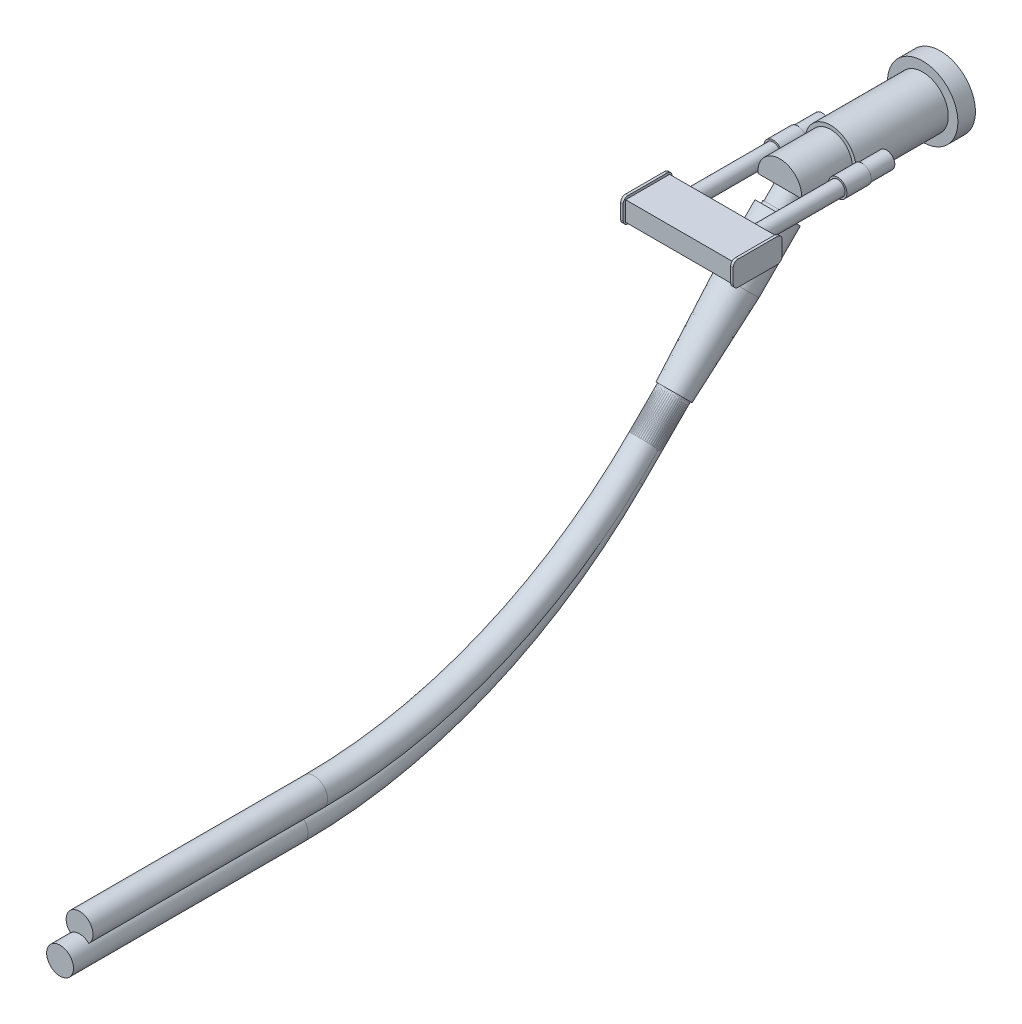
ISO-10303-21;
HEADER;
FILE_DESCRIPTION(('STEP AP214'),'2;1');
FILE_NAME('part.step','',(''),(''),'','','');
FILE_SCHEMA(('AUTOMOTIVE_DESIGN { 1 0 10303 214 1 1 1 1 }'));
ENDSEC;
DATA;
#1=APPLICATION_CONTEXT('core data for automotive mechanical design processes');
#2=APPLICATION_PROTOCOL_DEFINITION('international standard','automotive_design',2000,#1);
#3=PRODUCT_CONTEXT('',#1,'mechanical');
#4=PRODUCT('Part','Part','',(#3));
#5=PRODUCT_RELATED_PRODUCT_CATEGORY('part','',(#4));
#6=PRODUCT_DEFINITION_FORMATION('','',#4);
#7=PRODUCT_DEFINITION_CONTEXT('part definition',#1,'design');
#8=PRODUCT_DEFINITION('design','',#6,#7);
#9=PRODUCT_DEFINITION_SHAPE('','',#8);
#10=(LENGTH_UNIT() NAMED_UNIT(*) SI_UNIT(.MILLI.,.METRE.));
#11=(NAMED_UNIT(*) PLANE_ANGLE_UNIT() SI_UNIT($,.RADIAN.));
#12=(NAMED_UNIT(*) SI_UNIT($,.STERADIAN.) SOLID_ANGLE_UNIT());
#13=UNCERTAINTY_MEASURE_WITH_UNIT(LENGTH_MEASURE(1.E-05),#10,'distance_accuracy_value','');
#14=(GEOMETRIC_REPRESENTATION_CONTEXT(3) GLOBAL_UNCERTAINTY_ASSIGNED_CONTEXT((#13)) GLOBAL_UNIT_ASSIGNED_CONTEXT((#10,
#11,#12)) REPRESENTATION_CONTEXT('',''));
#15=CARTESIAN_POINT('',(0.,0.,0.));
#16=DIRECTION('',(0.,0.,1.));
#17=DIRECTION('',(1.,0.,0.));
#18=AXIS2_PLACEMENT_3D('',#15,#16,#17);
#19=CARTESIAN_POINT('',(0.,-202.452293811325,382.792293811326));
#20=DIRECTION('',(0.,0.70710678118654,-0.707106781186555));
#21=DIRECTION('',(0.,0.707106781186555,0.70710678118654));
#22=AXIS2_PLACEMENT_3D('',#19,#20,#21);
#23=CYLINDRICAL_SURFACE('',#22,17.4625);
#24=CARTESIAN_POINT('',(0.,-202.452293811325,382.792293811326));
#25=DIRECTION('',(0.,0.707106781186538,-0.707106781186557));
#26=DIRECTION('',(-1.,0.,0.));
#27=AXIS2_PLACEMENT_3D('',#24,#25,#26);
#28=CIRCLE('',#27,17.4625);
#29=CARTESIAN_POINT('',(0.,-214.800145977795,370.444441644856));
#30=VERTEX_POINT('',#29);
#31=EDGE_CURVE('E41',#30,#30,#28,.T.);
#32=ORIENTED_EDGE('',*,*,#31,.T.);
#33=EDGE_LOOP('',(#32));
#34=FACE_BOUND('',#33,.T.);
#35=CARTESIAN_POINT('',(0.,-164.542364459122,344.882364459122));
#36=DIRECTION('',(0.,0.707106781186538,-0.707106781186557));
#37=DIRECTION('',(-1.,0.,0.));
#38=AXIS2_PLACEMENT_3D('',#35,#36,#37);
#39=CIRCLE('',#38,17.4625);
#40=CARTESIAN_POINT('',(-17.4625,-164.542364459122,344.882364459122));
#41=VERTEX_POINT('',#40);
#42=EDGE_CURVE('E11',#41,#41,#39,.T.);
#43=ORIENTED_EDGE('',*,*,#42,.F.);
#44=EDGE_LOOP('',(#43));
#45=FACE_BOUND('',#44,.T.);
#46=ADVANCED_FACE('F35',(#34,#45),#23,.T.);
#47=CARTESIAN_POINT('',(0.,228.6,813.84458762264));
#48=DIRECTION('',(1.,0.,0.));
#49=DIRECTION('',(0.,0.,-1.));
#50=AXIS2_PLACEMENT_3D('',#47,#48,#49);
#51=TOROIDAL_SURFACE('',#50,609.6,17.4625);
#52=CARTESIAN_POINT('',(0.,-381.,813.84458762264));
#53=DIRECTION('',(0.,0.,-1.));
#54=DIRECTION('',(-1.,0.,0.));
#55=AXIS2_PLACEMENT_3D('',#52,#53,#54);
#56=CIRCLE('',#55,17.4625);
#57=CARTESIAN_POINT('',(0.,-398.4625,813.84458762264));
#58=VERTEX_POINT('',#57);
#59=EDGE_CURVE('E45',#58,#58,#56,.T.);
#60=CARTESIAN_POINT('',(0.,228.6,813.84458762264));
#61=DIRECTION('',(1.,0.,0.));
#62=DIRECTION('',(0.,0.,-1.));
#63=AXIS2_PLACEMENT_3D('',#60,#61,#62);
#64=CIRCLE('',#63,627.0625);
#65=EDGE_CURVE('',#58,#30,#64,.T.);
#66=ORIENTED_EDGE('',*,*,#59,.T.);
#67=ORIENTED_EDGE('',*,*,#31,.F.);
#68=ORIENTED_EDGE('',*,*,#65,.T.);
#69=ORIENTED_EDGE('',*,*,#65,.F.);
#70=EDGE_LOOP('',(#66,#68,#67,#69));
#71=FACE_BOUND('',#70,.T.);
#72=ADVANCED_FACE('F66',(#71),#51,.T.);
#73=CARTESIAN_POINT('',(0.,-381.,813.84458762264));
#74=DIRECTION('',(0.,0.,1.));
#75=DIRECTION('',(0.,-1.,0.));
#76=AXIS2_PLACEMENT_3D('',#73,#74,#75);
#77=CYLINDRICAL_SURFACE('',#76,17.4625);
#78=ORIENTED_EDGE('',*,*,#59,.F.);
#79=EDGE_LOOP('',(#78));
#80=FACE_BOUND('',#79,.T.);
#81=CARTESIAN_POINT('',(0.,-381.,1118.64458762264));
#82=DIRECTION('',(0.,0.,-1.));
#83=DIRECTION('',(-1.,0.,0.));
#84=AXIS2_PLACEMENT_3D('',#81,#82,#83);
#85=CIRCLE('',#84,17.4625);
#86=CARTESIAN_POINT('',(-17.4625,-381.,1118.64458762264));
#87=VERTEX_POINT('',#86);
#88=EDGE_CURVE('E49',#87,#87,#85,.T.);
#89=ORIENTED_EDGE('',*,*,#88,.T.);
#90=EDGE_LOOP('',(#89));
#91=FACE_BOUND('',#90,.T.);
#92=ADVANCED_FACE('F55',(#80,#91),#77,.T.);
#93=CARTESIAN_POINT('',(0.,-164.542364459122,344.882364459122));
#94=DIRECTION('',(0.,0.707106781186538,-0.707106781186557));
#95=DIRECTION('',(-1.,0.,0.));
#96=AXIS2_PLACEMENT_3D('',#93,#94,#95);
#97=PLANE('',#96);
#98=ORIENTED_EDGE('',*,*,#42,.T.);
#99=EDGE_LOOP('',(#98));
#100=FACE_BOUND('',#99,.T.);
#101=ADVANCED_FACE('F59',(#100),#97,.T.);
#102=CARTESIAN_POINT('',(0.,-381.,1118.64458762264));
#103=DIRECTION('',(0.,0.,-1.));
#104=DIRECTION('',(-1.,0.,0.));
#105=AXIS2_PLACEMENT_3D('',#102,#103,#104);
#106=PLANE('',#105);
#107=ORIENTED_EDGE('',*,*,#88,.F.);
#108=EDGE_LOOP('',(#107));
#109=FACE_BOUND('',#108,.T.);
#110=ADVANCED_FACE('F57',(#109),#106,.F.);
#111=CLOSED_SHELL('',(#46,#72,#92,#101,#110));
#112=MANIFOLD_SOLID_BREP('B2',#111);
#113=CARTESIAN_POINT('',(0.,-227.852293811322,408.192293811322));
#114=DIRECTION('',(0.,0.707106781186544,-0.707106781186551));
#115=DIRECTION('',(0.,0.707106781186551,0.707106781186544));
#116=AXIS2_PLACEMENT_3D('',#113,#114,#115);
#117=CYLINDRICAL_SURFACE('',#116,17.4625);
#118=CARTESIAN_POINT('',(0.,-227.852293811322,408.192293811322));
#119=DIRECTION('',(0.,0.707106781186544,-0.707106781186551));
#120=DIRECTION('',(-1.,0.,0.));
#121=AXIS2_PLACEMENT_3D('',#118,#119,#120);
#122=CIRCLE('',#121,17.4625);
#123=CARTESIAN_POINT('',(0.,-240.200145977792,395.844441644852));
#124=VERTEX_POINT('',#123);
#125=EDGE_CURVE('E109',#124,#124,#122,.T.);
#126=ORIENTED_EDGE('',*,*,#125,.T.);
#127=EDGE_LOOP('',(#126));
#128=FACE_BOUND('',#127,.T.);
#129=CARTESIAN_POINT('',(0.,-164.542364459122,344.882364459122));
#130=DIRECTION('',(0.,0.707106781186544,-0.707106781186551));
#131=DIRECTION('',(-1.,0.,0.));
#132=AXIS2_PLACEMENT_3D('',#129,#130,#131);
#133=CIRCLE('',#132,17.4625);
#134=CARTESIAN_POINT('',(-17.4625,-164.542364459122,344.882364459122));
#135=VERTEX_POINT('',#134);
#136=EDGE_CURVE('E34',#135,#135,#133,.T.);
#137=ORIENTED_EDGE('',*,*,#136,.F.);
#138=EDGE_LOOP('',(#137));
#139=FACE_BOUND('',#138,.T.);
#140=ADVANCED_FACE('F103',(#128,#139),#117,.T.);
#141=CARTESIAN_POINT('',(0.,203.2,839.24458762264));
#142=DIRECTION('',(1.,0.,0.));
#143=DIRECTION('',(0.,0.,-1.));
#144=AXIS2_PLACEMENT_3D('',#141,#142,#143);
#145=TOROIDAL_SURFACE('',#144,609.6,17.4625);
#146=CARTESIAN_POINT('',(0.,-406.4,839.24458762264));
#147=DIRECTION('',(0.,0.,-1.));
#148=DIRECTION('',(-1.,0.,0.));
#149=AXIS2_PLACEMENT_3D('',#146,#147,#148);
#150=CIRCLE('',#149,17.4625);
#151=CARTESIAN_POINT('',(0.,-423.8625,839.24458762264));
#152=VERTEX_POINT('',#151);
#153=EDGE_CURVE('E113',#152,#152,#150,.T.);
#154=CARTESIAN_POINT('',(0.,203.2,839.24458762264));
#155=DIRECTION('',(1.,0.,0.));
#156=DIRECTION('',(0.,0.,-1.));
#157=AXIS2_PLACEMENT_3D('',#154,#155,#156);
#158=CIRCLE('',#157,627.0625);
#159=EDGE_CURVE('',#152,#124,#158,.T.);
#160=ORIENTED_EDGE('',*,*,#153,.T.);
#161=ORIENTED_EDGE('',*,*,#125,.F.);
#162=ORIENTED_EDGE('',*,*,#159,.T.);
#163=ORIENTED_EDGE('',*,*,#159,.F.);
#164=EDGE_LOOP('',(#160,#162,#161,#163));
#165=FACE_BOUND('',#164,.T.);
#166=ADVANCED_FACE('F134',(#165),#145,.T.);
#167=CARTESIAN_POINT('',(0.,-406.4,839.24458762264));
#168=DIRECTION('',(0.,0.,1.));
#169=DIRECTION('',(0.,-1.,0.));
#170=AXIS2_PLACEMENT_3D('',#167,#168,#169);
#171=CYLINDRICAL_SURFACE('',#170,17.4625);
#172=CARTESIAN_POINT('',(0.,-406.4,1144.04458762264));
#173=DIRECTION('',(0.,0.,-1.));
#174=DIRECTION('',(-1.,0.,0.));
#175=AXIS2_PLACEMENT_3D('',#172,#173,#174);
#176=CIRCLE('',#175,17.4625);
#177=CARTESIAN_POINT('',(0.,-423.8625,1144.04458762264));
#178=VERTEX_POINT('',#177);
#179=EDGE_CURVE('E117',#178,#178,#176,.T.);
#180=CARTESIAN_POINT('',(0.,-423.8625,839.24458762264));
#181=CARTESIAN_POINT('',(0.,-423.8625,842.41958762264));
#182=CARTESIAN_POINT('',(0.,-423.8625,845.59458762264));
#183=CARTESIAN_POINT('',(0.,-423.8625,851.94458762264));
#184=CARTESIAN_POINT('',(0.,-423.8625,855.11958762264));
#185=CARTESIAN_POINT('',(0.,-423.8625,861.46958762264));
#186=CARTESIAN_POINT('',(0.,-423.8625,864.64458762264));
#187=CARTESIAN_POINT('',(0.,-423.8625,870.99458762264));
#188=CARTESIAN_POINT('',(0.,-423.8625,874.16958762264));
#189=CARTESIAN_POINT('',(0.,-423.8625,880.51958762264));
#190=CARTESIAN_POINT('',(0.,-423.8625,883.69458762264));
#191=CARTESIAN_POINT('',(0.,-423.8625,890.04458762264));
#192=CARTESIAN_POINT('',(0.,-423.8625,893.21958762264));
#193=CARTESIAN_POINT('',(0.,-423.8625,899.56958762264));
#194=CARTESIAN_POINT('',(0.,-423.8625,902.74458762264));
#195=CARTESIAN_POINT('',(0.,-423.8625,909.09458762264));
#196=CARTESIAN_POINT('',(0.,-423.8625,912.26958762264));
#197=CARTESIAN_POINT('',(0.,-423.8625,918.61958762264));
#198=CARTESIAN_POINT('',(0.,-423.8625,921.79458762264));
#199=CARTESIAN_POINT('',(0.,-423.8625,928.14458762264));
#200=CARTESIAN_POINT('',(0.,-423.8625,931.31958762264));
#201=CARTESIAN_POINT('',(0.,-423.8625,937.66958762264));
#202=CARTESIAN_POINT('',(0.,-423.8625,940.84458762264));
#203=CARTESIAN_POINT('',(0.,-423.8625,947.19458762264));
#204=CARTESIAN_POINT('',(0.,-423.8625,950.36958762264));
#205=CARTESIAN_POINT('',(0.,-423.8625,956.71958762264));
#206=CARTESIAN_POINT('',(0.,-423.8625,959.89458762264));
#207=CARTESIAN_POINT('',(0.,-423.8625,966.24458762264));
#208=CARTESIAN_POINT('',(0.,-423.8625,969.41958762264));
#209=CARTESIAN_POINT('',(0.,-423.8625,975.76958762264));
#210=CARTESIAN_POINT('',(0.,-423.8625,978.94458762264));
#211=CARTESIAN_POINT('',(0.,-423.8625,985.29458762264));
#212=CARTESIAN_POINT('',(0.,-423.8625,988.46958762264));
#213=CARTESIAN_POINT('',(0.,-423.8625,994.81958762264));
#214=CARTESIAN_POINT('',(0.,-423.8625,997.99458762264));
#215=CARTESIAN_POINT('',(0.,-423.8625,1004.34458762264));
#216=CARTESIAN_POINT('',(0.,-423.8625,1007.51958762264));
#217=CARTESIAN_POINT('',(0.,-423.8625,1013.86958762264));
#218=CARTESIAN_POINT('',(0.,-423.8625,1017.04458762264));
#219=CARTESIAN_POINT('',(0.,-423.8625,1023.39458762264));
#220=CARTESIAN_POINT('',(0.,-423.8625,1026.56958762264));
#221=CARTESIAN_POINT('',(0.,-423.8625,1032.91958762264));
#222=CARTESIAN_POINT('',(0.,-423.8625,1036.09458762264));
#223=CARTESIAN_POINT('',(0.,-423.8625,1042.44458762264));
#224=CARTESIAN_POINT('',(0.,-423.8625,1045.61958762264));
#225=CARTESIAN_POINT('',(0.,-423.8625,1051.96958762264));
#226=CARTESIAN_POINT('',(0.,-423.8625,1055.14458762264));
#227=CARTESIAN_POINT('',(0.,-423.8625,1061.49458762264));
#228=CARTESIAN_POINT('',(0.,-423.8625,1064.66958762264));
#229=CARTESIAN_POINT('',(0.,-423.8625,1071.01958762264));
#230=CARTESIAN_POINT('',(0.,-423.8625,1074.19458762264));
#231=CARTESIAN_POINT('',(0.,-423.8625,1080.54458762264));
#232=CARTESIAN_POINT('',(0.,-423.8625,1083.71958762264));
#233=CARTESIAN_POINT('',(0.,-423.8625,1090.06958762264));
#234=CARTESIAN_POINT('',(0.,-423.8625,1093.24458762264));
#235=CARTESIAN_POINT('',(0.,-423.8625,1099.59458762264));
#236=CARTESIAN_POINT('',(0.,-423.8625,1102.76958762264));
#237=CARTESIAN_POINT('',(0.,-423.8625,1109.11958762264));
#238=CARTESIAN_POINT('',(0.,-423.8625,1112.29458762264));
#239=CARTESIAN_POINT('',(0.,-423.8625,1118.64458762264));
#240=CARTESIAN_POINT('',(0.,-423.8625,1121.81958762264));
#241=CARTESIAN_POINT('',(0.,-423.8625,1128.16958762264));
#242=CARTESIAN_POINT('',(0.,-423.8625,1131.34458762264));
#243=CARTESIAN_POINT('',(0.,-423.8625,1137.69458762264));
#244=CARTESIAN_POINT('',(0.,-423.8625,1140.86958762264));
#245=CARTESIAN_POINT('',(0.,-423.8625,1144.04458762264));
#246=B_SPLINE_CURVE_WITH_KNOTS('',3,(#180,#181,#182,#183,#184,#185,#186,#187,#188,#189,#190,
#191,#192,#193,#194,#195,#196,#197,#198,#199,#200,#201,#202,#203,#204,#205,#206,#207,#208,#209,
#210,#211,#212,#213,#214,#215,#216,#217,#218,#219,#220,#221,#222,#223,#224,#225,#226,#227,#228,
#229,#230,#231,#232,#233,#234,#235,#236,#237,#238,#239,#240,#241,#242,#243,#244,#245),
.UNSPECIFIED.,.F.,.F.,(4,2,2,2,2,2,2,2,2,2,2,2,2,2,2,2,2,2,2,2,2,2,2,2,2,2,2,2,2,2,2,2,4),(0.,
9.52500000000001,19.05,28.575,38.1,47.625,57.15,66.675,76.2,85.7250000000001,95.2500000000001,
104.775,114.3,123.825,133.35,142.875,152.4,161.925,171.45,180.975,190.5,200.025,209.55,219.075,
228.6,238.125,247.65,257.175,266.7,276.225,285.75,295.275,304.8),.UNSPECIFIED.);
#247=EDGE_CURVE('BSEAM123',#152,#178,#246,.T.);
#248=ORIENTED_EDGE('',*,*,#153,.F.);
#249=ORIENTED_EDGE('',*,*,#179,.T.);
#250=ORIENTED_EDGE('',*,*,#247,.T.);
#251=ORIENTED_EDGE('',*,*,#247,.F.);
#252=EDGE_LOOP('',(#248,#250,#249,#251));
#253=FACE_BOUND('',#252,.T.);
#254=ADVANCED_FACE('F123',(#253),#171,.T.);
#255=CARTESIAN_POINT('',(0.,-164.542364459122,344.882364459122));
#256=DIRECTION('',(0.,0.707106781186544,-0.707106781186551));
#257=DIRECTION('',(-1.,0.,0.));
#258=AXIS2_PLACEMENT_3D('',#255,#256,#257);
#259=PLANE('',#258);
#260=ORIENTED_EDGE('',*,*,#136,.T.);
#261=EDGE_LOOP('',(#260));
#262=FACE_BOUND('',#261,.T.);
#263=ADVANCED_FACE('F127',(#262),#259,.T.);
#264=CARTESIAN_POINT('',(0.,-406.4,1144.04458762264));
#265=DIRECTION('',(0.,0.,-1.));
#266=DIRECTION('',(-1.,0.,0.));
#267=AXIS2_PLACEMENT_3D('',#264,#265,#266);
#268=PLANE('',#267);
#269=ORIENTED_EDGE('',*,*,#179,.F.);
#270=EDGE_LOOP('',(#269));
#271=FACE_BOUND('',#270,.T.);
#272=ADVANCED_FACE('F125',(#271),#268,.F.);
#273=CLOSED_SHELL('',(#140,#166,#254,#263,#272));
#274=MANIFOLD_SOLID_BREP('B6',#273);
#275=CARTESIAN_POINT('',(8.88178419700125E-13,-15.2664354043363,195.606435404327));
#276=DIRECTION('',(0.,-0.707106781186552,0.707106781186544));
#277=DIRECTION('',(0.,-0.707106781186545,-0.707106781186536));
#278=AXIS2_PLACEMENT_3D('',#275,#276,#277);
#279=PLANE('',#278);
#280=CARTESIAN_POINT('',(8.88178419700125E-13,-15.2664354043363,195.606435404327));
#281=DIRECTION('',(0.,-0.707106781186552,0.707106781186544));
#282=DIRECTION('',(0.,-0.707106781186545,-0.707106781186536));
#283=AXIS2_PLACEMENT_3D('',#280,#281,#282);
#284=CIRCLE('',#283,16.5099999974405);
#285=CARTESIAN_POINT('',(9.30107796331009E-13,-26.9407683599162,183.932102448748));
#286=VERTEX_POINT('',#285);
#287=EDGE_CURVE('E102',#286,#286,#284,.T.);
#288=ORIENTED_EDGE('',*,*,#287,.F.);
#289=EDGE_LOOP('',(#288));
#290=FACE_BOUND('',#289,.T.);
#291=ADVANCED_FACE('F173',(#290),#279,.F.);
#292=CARTESIAN_POINT('',(8.88178419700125E-13,-165.685725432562,346.025725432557));
#293=DIRECTION('',(0.,-0.707106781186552,0.707106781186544));
#294=DIRECTION('',(0.,-0.707106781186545,-0.707106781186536));
#295=AXIS2_PLACEMENT_3D('',#292,#293,#294);
#296=CYLINDRICAL_SURFACE('',#295,16.5099999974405);
#297=CARTESIAN_POINT('',(4.44089209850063E-13,-28.7368195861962,209.076819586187));
#298=DIRECTION('',(0.,-0.707106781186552,0.707106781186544));
#299=DIRECTION('',(0.,-0.707106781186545,-0.707106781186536));
#300=AXIS2_PLACEMENT_3D('',#297,#298,#299);
#301=CIRCLE('',#300,16.5099999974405);
#302=CARTESIAN_POINT('',(4.86018586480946E-13,-40.4111525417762,197.402486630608));
#303=VERTEX_POINT('',#302);
#304=EDGE_CURVE('E179',#303,#303,#301,.T.);
#305=ORIENTED_EDGE('',*,*,#304,.F.);
#306=EDGE_LOOP('',(#305));
#307=FACE_BOUND('',#306,.T.);
#308=ORIENTED_EDGE('',*,*,#287,.T.);
#309=EDGE_LOOP('',(#308));
#310=FACE_BOUND('',#309,.T.);
#311=ADVANCED_FACE('F230',(#307,#310),#296,.T.);
#312=CARTESIAN_POINT('',(8.88178419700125E-13,-17.0624866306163,220.751152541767));
#313=DIRECTION('',(0.,-0.707106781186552,0.707106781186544));
#314=DIRECTION('',(0.,-0.707106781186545,-0.707106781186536));
#315=AXIS2_PLACEMENT_3D('',#312,#313,#314);
#316=PLANE('',#315);
#317=CARTESIAN_POINT('',(4.44089209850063E-13,-28.7368195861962,209.076819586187));
#318=DIRECTION('',(0.,-0.707106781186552,0.707106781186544));
#319=DIRECTION('',(0.,-0.707106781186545,-0.707106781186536));
#320=AXIS2_PLACEMENT_3D('',#317,#318,#319);
#321=CIRCLE('',#320,17.4624999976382);
#322=CARTESIAN_POINT('',(4.88437588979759E-13,-41.0846717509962,196.728967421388));
#323=VERTEX_POINT('',#322);
#324=EDGE_CURVE('E183',#323,#323,#321,.T.);
#325=ORIENTED_EDGE('',*,*,#324,.F.);
#326=EDGE_LOOP('',(#325));
#327=FACE_BOUND('',#326,.T.);
#328=ORIENTED_EDGE('',*,*,#304,.T.);
#329=EDGE_LOOP('',(#328));
#330=FACE_BOUND('',#329,.T.);
#331=ADVANCED_FACE('F225',(#327,#330),#316,.F.);
#332=CARTESIAN_POINT('',(8.88178419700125E-13,-165.685725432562,346.025725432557));
#333=DIRECTION('',(0.,-0.707106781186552,0.707106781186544));
#334=DIRECTION('',(0.,-0.707106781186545,-0.707106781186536));
#335=AXIS2_PLACEMENT_3D('',#332,#333,#334);
#336=CYLINDRICAL_SURFACE('',#335,17.4624999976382);
#337=CARTESIAN_POINT('',(2.88657986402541E-12,-30.9818836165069,211.321883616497));
#338=DIRECTION('',(0.,-0.707106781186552,0.707106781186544));
#339=DIRECTION('',(0.,-0.707106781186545,-0.707106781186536));
#340=AXIS2_PLACEMENT_3D('',#337,#338,#339);
#341=CIRCLE('',#340,17.4624999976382);
#342=CARTESIAN_POINT('',(2.9309282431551E-12,-43.3297357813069,198.974031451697));
#343=VERTEX_POINT('',#342);
#344=EDGE_CURVE('E187',#343,#343,#341,.T.);
#345=ORIENTED_EDGE('',*,*,#344,.F.);
#346=EDGE_LOOP('',(#345));
#347=FACE_BOUND('',#346,.T.);
#348=ORIENTED_EDGE('',*,*,#324,.T.);
#349=EDGE_LOOP('',(#348));
#350=FACE_BOUND('',#349,.T.);
#351=ADVANCED_FACE('F219',(#347,#350),#336,.T.);
#352=CARTESIAN_POINT('',(4.44089209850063E-13,-18.6340314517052,223.669735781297));
#353=DIRECTION('',(0.,-0.707106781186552,0.707106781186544));
#354=DIRECTION('',(0.,-0.707106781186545,-0.707106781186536));
#355=AXIS2_PLACEMENT_3D('',#352,#353,#354);
#356=PLANE('',#355);
#357=CARTESIAN_POINT('',(2.88657986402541E-12,-30.9818836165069,211.321883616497));
#358=DIRECTION('',(0.,-0.707106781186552,0.707106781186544));
#359=DIRECTION('',(0.,-0.707106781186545,-0.707106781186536));
#360=AXIS2_PLACEMENT_3D('',#357,#358,#359);
#361=CIRCLE('',#360,24.1299999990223);
#362=CARTESIAN_POINT('',(2.94786126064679E-12,-48.0443702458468,194.259396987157));
#363=VERTEX_POINT('',#362);
#364=EDGE_CURVE('E192',#363,#363,#361,.T.);
#365=ORIENTED_EDGE('',*,*,#364,.F.);
#366=EDGE_LOOP('',(#365));
#367=FACE_BOUND('',#366,.T.);
#368=ORIENTED_EDGE('',*,*,#344,.T.);
#369=EDGE_LOOP('',(#368));
#370=FACE_BOUND('',#369,.T.);
#371=ADVANCED_FACE('F213',(#367,#370),#356,.F.);
#372=CARTESIAN_POINT('',(8.88178419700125E-13,-165.685725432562,346.025725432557));
#373=DIRECTION('',(0.,-0.707106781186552,0.707106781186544));
#374=DIRECTION('',(0.,-0.707106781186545,-0.707106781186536));
#375=AXIS2_PLACEMENT_3D('',#372,#373,#374);
#376=CYLINDRICAL_SURFACE('',#375,24.1299999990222);
#377=CARTESIAN_POINT('',(0.,-84.8634203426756,265.203420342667));
#378=DIRECTION('',(0.,-0.707106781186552,0.707106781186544));
#379=DIRECTION('',(0.,-0.707106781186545,-0.707106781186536));
#380=AXIS2_PLACEMENT_3D('',#377,#378,#379);
#381=CIRCLE('',#380,24.1299999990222);
#382=CARTESIAN_POINT('',(0.,-101.925906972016,248.140933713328));
#383=VERTEX_POINT('',#382);
#384=EDGE_CURVE('E195',#383,#383,#381,.T.);
#385=ORIENTED_EDGE('',*,*,#384,.F.);
#386=EDGE_LOOP('',(#385));
#387=FACE_BOUND('',#386,.T.);
#388=ORIENTED_EDGE('',*,*,#364,.T.);
#389=EDGE_LOOP('',(#388));
#390=FACE_BOUND('',#389,.T.);
#391=ADVANCED_FACE('F207',(#387,#390),#376,.T.);
#392=CARTESIAN_POINT('',(0.,-84.8634203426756,265.203420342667));
#393=DIRECTION('',(0.,0.707106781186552,-0.707106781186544));
#394=DIRECTION('',(0.,0.707106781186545,0.707106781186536));
#395=AXIS2_PLACEMENT_3D('',#392,#393,#394);
#396=CONICAL_SURFACE('',#395,24.1299999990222,0.0436332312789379);
#397=CARTESIAN_POINT('',(8.88178419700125E-13,-165.685725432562,346.025725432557));
#398=DIRECTION('',(0.,-0.707106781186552,0.707106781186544));
#399=DIRECTION('',(0.,-0.707106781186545,-0.707106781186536));
#400=AXIS2_PLACEMENT_3D('',#397,#398,#399);
#401=CIRCLE('',#400,19.1395542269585);
#402=CARTESIAN_POINT('',(9.36785904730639E-13,-179.219434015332,332.492016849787));
#403=VERTEX_POINT('',#402);
#404=EDGE_CURVE('E198',#403,#403,#401,.T.);
#405=ORIENTED_EDGE('',*,*,#404,.F.);
#406=EDGE_LOOP('',(#405));
#407=FACE_BOUND('',#406,.T.);
#408=ORIENTED_EDGE('',*,*,#384,.T.);
#409=EDGE_LOOP('',(#408));
#410=FACE_BOUND('',#409,.T.);
#411=ADVANCED_FACE('F204',(#407,#410),#396,.T.);
#412=CARTESIAN_POINT('',(8.88178419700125E-13,-165.685725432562,346.025725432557));
#413=DIRECTION('',(0.,0.707106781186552,-0.707106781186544));
#414=DIRECTION('',(0.,0.707106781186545,0.707106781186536));
#415=AXIS2_PLACEMENT_3D('',#412,#413,#414);
#416=PLANE('',#415);
#417=ORIENTED_EDGE('',*,*,#404,.T.);
#418=EDGE_LOOP('',(#417));
#419=FACE_BOUND('',#418,.T.);
#420=ADVANCED_FACE('F202',(#419),#416,.F.);
#421=CLOSED_SHELL('',(#291,#311,#331,#351,#371,#391,#411,#420));
#422=MANIFOLD_SOLID_BREP('B29',#421);
#423=CARTESIAN_POINT('',(0.,0.,208.533999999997));
#424=DIRECTION('',(0.,0.,-0.999999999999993));
#425=DIRECTION('',(-1.,0.,0.));
#426=AXIS2_PLACEMENT_3D('',#423,#424,#425);
#427=CYLINDRICAL_SURFACE('',#426,28.448);
#428=CARTESIAN_POINT('',(0.,-6.88338275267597E-12,142.493999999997));
#429=DIRECTION('',(0.,0.,0.999999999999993));
#430=DIRECTION('',(1.,0.,0.));
#431=AXIS2_PLACEMENT_3D('',#428,#429,#430);
#432=CIRCLE('',#431,28.448);
#433=CARTESIAN_POINT('',(28.448,-6.98050239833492E-12,142.493999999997));
#434=VERTEX_POINT('',#433);
#435=EDGE_CURVE('E287',#434,#434,#432,.T.);
#436=ORIENTED_EDGE('',*,*,#435,.T.);
#437=EDGE_LOOP('',(#436));
#438=FACE_BOUND('',#437,.T.);
#439=CARTESIAN_POINT('',(0.,0.,210.872870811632));
#440=DIRECTION('',(0.,-0.707106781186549,0.707106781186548));
#441=DIRECTION('',(0.,-0.707106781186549,-0.707106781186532));
#442=AXIS2_PLACEMENT_3D('',#439,#440,#441);
#443=ELLIPSE('',#442,40.2315474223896,28.448);
#444=CARTESIAN_POINT('',(28.3516910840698,-2.33887081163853,208.533999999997));
#445=VERTEX_POINT('',#444);
#446=CARTESIAN_POINT('',(-28.3516910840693,-2.33887081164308,208.533999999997));
#447=VERTEX_POINT('',#446);
#448=EDGE_CURVE('E293',#445,#447,#443,.F.);
#449=ORIENTED_EDGE('',*,*,#448,.T.);
#450=CARTESIAN_POINT('',(0.,0.,208.533999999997));
#451=DIRECTION('',(0.,0.,0.999999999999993));
#452=DIRECTION('',(1.,0.,0.));
#453=AXIS2_PLACEMENT_3D('',#450,#451,#452);
#454=CIRCLE('',#453,28.448);
#455=EDGE_CURVE('E171',#445,#447,#454,.T.);
#456=ORIENTED_EDGE('',*,*,#455,.F.);
#457=EDGE_LOOP('',(#449,#456));
#458=FACE_BOUND('',#457,.T.);
#459=ADVANCED_FACE('F280',(#438,#458),#427,.T.);
#460=CARTESIAN_POINT('',(0.,0.,208.533999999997));
#461=DIRECTION('',(0.,0.,0.999999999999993));
#462=DIRECTION('',(1.,0.,0.));
#463=AXIS2_PLACEMENT_3D('',#460,#461,#462);
#464=PLANE('',#463);
#465=ORIENTED_EDGE('',*,*,#455,.T.);
#466=DIRECTION('',(-1.,0.,0.));
#467=VECTOR('',#466,1.);
#468=CARTESIAN_POINT('',(73.1530000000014,-2.33887081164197,208.533999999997));
#469=LINE('',#468,#467);
#470=EDGE_CURVE('E295',#445,#447,#469,.T.);
#471=ORIENTED_EDGE('',*,*,#470,.F.);
#472=EDGE_LOOP('',(#465,#471));
#473=FACE_BOUND('',#472,.T.);
#474=ADVANCED_FACE('F302',(#473),#464,.T.);
#475=CARTESIAN_POINT('',(0.,-6.88338275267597E-12,142.493999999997));
#476=DIRECTION('',(0.,0.,0.999999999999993));
#477=DIRECTION('',(1.,0.,0.));
#478=AXIS2_PLACEMENT_3D('',#475,#476,#477);
#479=PLANE('',#478);
#480=ORIENTED_EDGE('',*,*,#435,.F.);
#481=EDGE_LOOP('',(#480));
#482=FACE_BOUND('',#481,.T.);
#483=ADVANCED_FACE('F304',(#482),#479,.F.);
#484=CARTESIAN_POINT('',(73.1530000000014,-2.33887081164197,208.533999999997));
#485=DIRECTION('',(0.,-0.707106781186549,0.707106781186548));
#486=DIRECTION('',(0.,-0.707106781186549,-0.707106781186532));
#487=AXIS2_PLACEMENT_3D('',#484,#485,#486);
#488=PLANE('',#487);
#489=ORIENTED_EDGE('',*,*,#470,.T.);
#490=ORIENTED_EDGE('',*,*,#448,.F.);
#491=EDGE_LOOP('',(#489,#490));
#492=FACE_BOUND('',#491,.T.);
#493=ADVANCED_FACE('F296',(#492),#488,.T.);
#494=CLOSED_SHELL('',(#459,#474,#483,#493));
#495=MANIFOLD_SOLID_BREP('B97',#494);
#496=CARTESIAN_POINT('',(-41.9099999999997,-4.88498130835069E-12,111.759999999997));
#497=DIRECTION('',(0.,0.,0.999999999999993));
#498=DIRECTION('',(-1.,0.,0.));
#499=AXIS2_PLACEMENT_3D('',#496,#497,#498);
#500=CYLINDRICAL_SURFACE('',#499,10.795);
#501=CARTESIAN_POINT('',(-41.9099999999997,-4.88498130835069E-12,111.759999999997));
#502=DIRECTION('',(0.,0.,-0.999999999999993));
#503=DIRECTION('',(-1.,0.,0.));
#504=AXIS2_PLACEMENT_3D('',#501,#502,#503);
#505=CIRCLE('',#504,10.795);
#506=CARTESIAN_POINT('',(-52.7049999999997,-4.84812787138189E-12,111.759999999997));
#507=VERTEX_POINT('',#506);
#508=EDGE_CURVE('E279',#507,#507,#505,.T.);
#509=CARTESIAN_POINT('',(-41.9100000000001,-4.88498130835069E-12,143.509999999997));
#510=DIRECTION('',(0.,0.,-0.999999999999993));
#511=DIRECTION('',(-1.,0.,0.));
#512=AXIS2_PLACEMENT_3D('',#509,#510,#511);
#513=CIRCLE('',#512,10.795);
#514=CARTESIAN_POINT('',(-52.7049999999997,-4.85626818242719E-12,143.509999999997));
#515=VERTEX_POINT('',#514);
#516=EDGE_CURVE('E346',#515,#515,#513,.T.);
#517=CARTESIAN_POINT('',(-52.7049999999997,-4.84812787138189E-12,111.759999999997));
#518=CARTESIAN_POINT('',(-52.7049999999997,-4.84821266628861E-12,112.090729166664));
#519=CARTESIAN_POINT('',(-52.7049999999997,-4.84829746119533E-12,112.421458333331));
#520=CARTESIAN_POINT('',(-52.7049999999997,-4.84846705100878E-12,113.082916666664));
#521=CARTESIAN_POINT('',(-52.7049999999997,-4.8485518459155E-12,113.413645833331));
#522=CARTESIAN_POINT('',(-52.7049999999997,-4.84872143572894E-12,114.075104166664));
#523=CARTESIAN_POINT('',(-52.7049999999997,-4.84880623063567E-12,114.405833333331));
#524=CARTESIAN_POINT('',(-52.7049999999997,-4.84897582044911E-12,115.067291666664));
#525=CARTESIAN_POINT('',(-52.7049999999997,-4.84906061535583E-12,115.398020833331));
#526=CARTESIAN_POINT('',(-52.7049999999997,-4.84923020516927E-12,116.059479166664));
#527=CARTESIAN_POINT('',(-52.7049999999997,-4.849315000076E-12,116.390208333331));
#528=CARTESIAN_POINT('',(-52.7049999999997,-4.84948458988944E-12,117.051666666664));
#529=CARTESIAN_POINT('',(-52.7049999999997,-4.84956938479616E-12,117.382395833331));
#530=CARTESIAN_POINT('',(-52.7049999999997,-4.84973897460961E-12,118.043854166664));
#531=CARTESIAN_POINT('',(-52.7049999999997,-4.84982376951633E-12,118.374583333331));
#532=CARTESIAN_POINT('',(-52.7049999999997,-4.84999335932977E-12,119.036041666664));
#533=CARTESIAN_POINT('',(-52.7049999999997,-4.85007815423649E-12,119.366770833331));
#534=CARTESIAN_POINT('',(-52.7049999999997,-4.85024774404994E-12,120.028229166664));
#535=CARTESIAN_POINT('',(-52.7049999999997,-4.85033253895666E-12,120.358958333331));
#536=CARTESIAN_POINT('',(-52.7049999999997,-4.8505021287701E-12,121.020416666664));
#537=CARTESIAN_POINT('',(-52.7049999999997,-4.85058692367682E-12,121.351145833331));
#538=CARTESIAN_POINT('',(-52.7049999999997,-4.85075651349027E-12,122.012604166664));
#539=CARTESIAN_POINT('',(-52.7049999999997,-4.85084130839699E-12,122.343333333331));
#540=CARTESIAN_POINT('',(-52.7049999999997,-4.85101089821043E-12,123.004791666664));
#541=CARTESIAN_POINT('',(-52.7049999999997,-4.85109569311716E-12,123.335520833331));
#542=CARTESIAN_POINT('',(-52.7049999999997,-4.8512652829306E-12,123.996979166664));
#543=CARTESIAN_POINT('',(-52.7049999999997,-4.85135007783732E-12,124.327708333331));
#544=CARTESIAN_POINT('',(-52.7049999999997,-4.85151966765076E-12,124.989166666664));
#545=CARTESIAN_POINT('',(-52.7049999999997,-4.85160446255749E-12,125.319895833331));
#546=CARTESIAN_POINT('',(-52.7049999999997,-4.85177405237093E-12,125.981354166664));
#547=CARTESIAN_POINT('',(-52.7049999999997,-4.85185884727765E-12,126.312083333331));
#548=CARTESIAN_POINT('',(-52.7049999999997,-4.8520284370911E-12,126.973541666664));
#549=CARTESIAN_POINT('',(-52.7049999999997,-4.85211323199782E-12,127.304270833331));
#550=CARTESIAN_POINT('',(-52.7049999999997,-4.85228282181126E-12,127.965729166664));
#551=CARTESIAN_POINT('',(-52.7049999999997,-4.85236761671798E-12,128.296458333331));
#552=CARTESIAN_POINT('',(-52.7049999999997,-4.85253720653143E-12,128.957916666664));
#553=CARTESIAN_POINT('',(-52.7049999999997,-4.85262200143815E-12,129.288645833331));
#554=CARTESIAN_POINT('',(-52.7049999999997,-4.85279159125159E-12,129.950104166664));
#555=CARTESIAN_POINT('',(-52.7049999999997,-4.85287638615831E-12,130.280833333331));
#556=CARTESIAN_POINT('',(-52.7049999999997,-4.85304597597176E-12,130.942291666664));
#557=CARTESIAN_POINT('',(-52.7049999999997,-4.85313077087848E-12,131.273020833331));
#558=CARTESIAN_POINT('',(-52.7049999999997,-4.85330036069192E-12,131.934479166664));
#559=CARTESIAN_POINT('',(-52.7049999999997,-4.85338515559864E-12,132.265208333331));
#560=CARTESIAN_POINT('',(-52.7049999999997,-4.85355474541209E-12,132.926666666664));
#561=CARTESIAN_POINT('',(-52.7049999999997,-4.85363954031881E-12,133.257395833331));
#562=CARTESIAN_POINT('',(-52.7049999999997,-4.85380913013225E-12,133.918854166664));
#563=CARTESIAN_POINT('',(-52.7049999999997,-4.85389392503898E-12,134.249583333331));
#564=CARTESIAN_POINT('',(-52.7049999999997,-4.85406351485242E-12,134.911041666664));
#565=CARTESIAN_POINT('',(-52.7049999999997,-4.85414830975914E-12,135.241770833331));
#566=CARTESIAN_POINT('',(-52.7049999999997,-4.85431789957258E-12,135.903229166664));
#567=CARTESIAN_POINT('',(-52.7049999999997,-4.85440269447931E-12,136.233958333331));
#568=CARTESIAN_POINT('',(-52.7049999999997,-4.85457228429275E-12,136.895416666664));
#569=CARTESIAN_POINT('',(-52.7049999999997,-4.85465707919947E-12,137.226145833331));
#570=CARTESIAN_POINT('',(-52.7049999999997,-4.85482666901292E-12,137.887604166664));
#571=CARTESIAN_POINT('',(-52.7049999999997,-4.85491146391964E-12,138.218333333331));
#572=CARTESIAN_POINT('',(-52.7049999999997,-4.85508105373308E-12,138.879791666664));
#573=CARTESIAN_POINT('',(-52.7049999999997,-4.8551658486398E-12,139.210520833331));
#574=CARTESIAN_POINT('',(-52.7049999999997,-4.85533543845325E-12,139.871979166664));
#575=CARTESIAN_POINT('',(-52.7049999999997,-4.85542023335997E-12,140.202708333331));
#576=CARTESIAN_POINT('',(-52.7049999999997,-4.85558982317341E-12,140.864166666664));
#577=CARTESIAN_POINT('',(-52.7049999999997,-4.85567461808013E-12,141.194895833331));
#578=CARTESIAN_POINT('',(-52.7049999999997,-4.85584420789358E-12,141.856354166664));
#579=CARTESIAN_POINT('',(-52.7049999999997,-4.8559290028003E-12,142.187083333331));
#580=CARTESIAN_POINT('',(-52.7049999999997,-4.85609859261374E-12,142.848541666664));
#581=CARTESIAN_POINT('',(-52.7049999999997,-4.85618338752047E-12,143.179270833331));
#582=CARTESIAN_POINT('',(-52.7049999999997,-4.85626818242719E-12,143.509999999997));
#583=B_SPLINE_CURVE_WITH_KNOTS('',3,(#517,#518,#519,#520,#521,#522,#523,#524,#525,#526,#527,
#528,#529,#530,#531,#532,#533,#534,#535,#536,#537,#538,#539,#540,#541,#542,#543,#544,#545,#546,
#547,#548,#549,#550,#551,#552,#553,#554,#555,#556,#557,#558,#559,#560,#561,#562,#563,#564,#565,
#566,#567,#568,#569,#570,#571,#572,#573,#574,#575,#576,#577,#578,#579,#580,#581,#582),
.UNSPECIFIED.,.F.,.F.,(4,2,2,2,2,2,2,2,2,2,2,2,2,2,2,2,2,2,2,2,2,2,2,2,2,2,2,2,2,2,2,2,4),(0.,
0.992187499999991,1.984375,2.9765625,3.96875000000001,4.96093750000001,5.95312500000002,
6.94531250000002,7.93750000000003,8.92968750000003,9.92187500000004,10.9140625,11.90625,
12.8984375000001,13.8906250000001,14.8828125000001,15.8750000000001,16.8671875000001,
17.8593750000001,18.8515625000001,19.8437500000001,20.8359375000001,21.8281250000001,
22.8203125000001,23.8125000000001,24.8046875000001,25.7968750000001,26.7890625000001,
27.7812500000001,28.7734375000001,29.7656250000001,30.7578125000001,31.7500000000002),.UNSPECIFIED.);
#584=EDGE_CURVE('BSEAM340',#507,#515,#583,.T.);
#585=ORIENTED_EDGE('',*,*,#508,.F.);
#586=ORIENTED_EDGE('',*,*,#516,.T.);
#587=ORIENTED_EDGE('',*,*,#584,.T.);
#588=ORIENTED_EDGE('',*,*,#584,.F.);
#589=EDGE_LOOP('',(#585,#587,#586,#588));
#590=FACE_BOUND('',#589,.T.);
#591=ADVANCED_FACE('F340',(#590),#500,.T.);
#592=CARTESIAN_POINT('',(-41.9099999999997,-4.88498130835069E-12,111.759999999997));
#593=DIRECTION('',(0.,0.,0.999999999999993));
#594=DIRECTION('',(-1.,0.,0.));
#595=AXIS2_PLACEMENT_3D('',#592,#593,#594);
#596=PLANE('',#595);
#597=ORIENTED_EDGE('',*,*,#508,.T.);
#598=EDGE_LOOP('',(#597));
#599=FACE_BOUND('',#598,.T.);
#600=ADVANCED_FACE('F355',(#599),#596,.F.);
#601=CARTESIAN_POINT('',(-41.9100000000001,-4.88498130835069E-12,143.509999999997));
#602=DIRECTION('',(0.,0.,0.999999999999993));
#603=DIRECTION('',(-1.,0.,0.));
#604=AXIS2_PLACEMENT_3D('',#601,#602,#603);
#605=PLANE('',#604);
#606=ORIENTED_EDGE('',*,*,#516,.F.);
#607=EDGE_LOOP('',(#606));
#608=FACE_BOUND('',#607,.T.);
#609=ADVANCED_FACE('F353',(#608),#605,.T.);
#610=CLOSED_SHELL('',(#591,#600,#609));
#611=MANIFOLD_SOLID_BREP('B165',#610);
#612=CARTESIAN_POINT('',(-41.9099999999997,-4.44089209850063E-12,175.259999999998));
#613=DIRECTION('',(0.,0.,0.999999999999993));
#614=DIRECTION('',(-1.,0.,0.));
#615=AXIS2_PLACEMENT_3D('',#612,#613,#614);
#616=PLANE('',#615);
#617=CARTESIAN_POINT('',(-41.9099999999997,-4.44089209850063E-12,175.259999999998));
#618=DIRECTION('',(0.,0.,-0.999999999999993));
#619=DIRECTION('',(-1.,0.,0.));
#620=AXIS2_PLACEMENT_3D('',#617,#618,#619);
#621=CIRCLE('',#620,11.938);
#622=CARTESIAN_POINT('',(-29.9719999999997,-4.48164766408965E-12,175.259999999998));
#623=VERTEX_POINT('',#622);
#624=EDGE_CURVE('E339',#623,#623,#621,.T.);
#625=ORIENTED_EDGE('',*,*,#624,.F.);
#626=EDGE_LOOP('',(#625));
#627=FACE_BOUND('',#626,.T.);
#628=CARTESIAN_POINT('',(-41.9099999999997,-4.44089209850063E-12,175.259999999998));
#629=DIRECTION('',(0.,0.,-0.999999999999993));
#630=DIRECTION('',(-1.,0.,0.));
#631=AXIS2_PLACEMENT_3D('',#628,#629,#630);
#632=CIRCLE('',#631,9.652);
#633=CARTESIAN_POINT('',(-32.2579999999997,-4.4738434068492E-12,175.259999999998));
#634=VERTEX_POINT('',#633);
#635=EDGE_CURVE('E393',#634,#634,#632,.T.);
#636=ORIENTED_EDGE('',*,*,#635,.T.);
#637=EDGE_LOOP('',(#636));
#638=FACE_BOUND('',#637,.T.);
#639=ADVANCED_FACE('F382',(#627,#638),#616,.T.);
#640=CARTESIAN_POINT('',(-41.9100000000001,-4.88498130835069E-12,143.509999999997));
#641=DIRECTION('',(0.,0.,0.999999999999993));
#642=DIRECTION('',(-1.,0.,0.));
#643=AXIS2_PLACEMENT_3D('',#640,#641,#642);
#644=PLANE('',#643);
#645=CARTESIAN_POINT('',(-41.9100000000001,-4.88498130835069E-12,143.509999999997));
#646=DIRECTION('',(0.,0.,-0.999999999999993));
#647=DIRECTION('',(-1.,0.,0.));
#648=AXIS2_PLACEMENT_3D('',#645,#646,#647);
#649=CIRCLE('',#648,11.938);
#650=CARTESIAN_POINT('',(-29.9719999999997,-4.47350735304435E-12,143.509999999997));
#651=VERTEX_POINT('',#650);
#652=EDGE_CURVE('E389',#651,#651,#649,.T.);
#653=ORIENTED_EDGE('',*,*,#652,.T.);
#654=EDGE_LOOP('',(#653));
#655=FACE_BOUND('',#654,.T.);
#656=CARTESIAN_POINT('',(-41.9100000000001,-4.88498130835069E-12,143.509999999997));
#657=DIRECTION('',(0.,0.,-0.999999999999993));
#658=DIRECTION('',(-1.,0.,0.));
#659=AXIS2_PLACEMENT_3D('',#656,#657,#658);
#660=CIRCLE('',#659,9.652);
#661=CARTESIAN_POINT('',(-32.2579999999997,-4.4657030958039E-12,143.509999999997));
#662=VERTEX_POINT('',#661);
#663=EDGE_CURVE('E397',#662,#662,#660,.T.);
#664=ORIENTED_EDGE('',*,*,#663,.F.);
#665=EDGE_LOOP('',(#664));
#666=FACE_BOUND('',#665,.T.);
#667=ADVANCED_FACE('F405',(#655,#666),#644,.F.);
#668=CARTESIAN_POINT('',(-41.9099999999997,-4.44089209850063E-12,175.259999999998));
#669=DIRECTION('',(0.,0.,-0.999999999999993));
#670=DIRECTION('',(1.,0.,0.));
#671=AXIS2_PLACEMENT_3D('',#668,#669,#670);
#672=CYLINDRICAL_SURFACE('',#671,11.938);
#673=CARTESIAN_POINT('',(-29.9719999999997,-4.48164766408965E-12,175.259999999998));
#674=CARTESIAN_POINT('',(-29.9719999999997,-4.48156286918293E-12,174.929270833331));
#675=CARTESIAN_POINT('',(-29.9719999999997,-4.48147807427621E-12,174.598541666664));
#676=CARTESIAN_POINT('',(-29.9719999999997,-4.48130848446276E-12,173.937083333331));
#677=CARTESIAN_POINT('',(-29.9719999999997,-4.48122368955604E-12,173.606354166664));
#678=CARTESIAN_POINT('',(-29.9719999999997,-4.4810540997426E-12,172.944895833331));
#679=CARTESIAN_POINT('',(-29.9719999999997,-4.48096930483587E-12,172.614166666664));
#680=CARTESIAN_POINT('',(-29.9719999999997,-4.48079971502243E-12,171.952708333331));
#681=CARTESIAN_POINT('',(-29.9719999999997,-4.48071492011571E-12,171.621979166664));
#682=CARTESIAN_POINT('',(-29.9719999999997,-4.48054533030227E-12,170.960520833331));
#683=CARTESIAN_POINT('',(-29.9719999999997,-4.48046053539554E-12,170.629791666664));
#684=CARTESIAN_POINT('',(-29.9719999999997,-4.4802909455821E-12,169.968333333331));
#685=CARTESIAN_POINT('',(-29.9719999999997,-4.48020615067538E-12,169.637604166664));
#686=CARTESIAN_POINT('',(-29.9719999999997,-4.48003656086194E-12,168.976145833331));
#687=CARTESIAN_POINT('',(-29.9719999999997,-4.47995176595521E-12,168.645416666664));
#688=CARTESIAN_POINT('',(-29.9719999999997,-4.47978217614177E-12,167.983958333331));
#689=CARTESIAN_POINT('',(-29.9719999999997,-4.47969738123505E-12,167.653229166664));
#690=CARTESIAN_POINT('',(-29.9719999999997,-4.4795277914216E-12,166.991770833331));
#691=CARTESIAN_POINT('',(-29.9719999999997,-4.47944299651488E-12,166.661041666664));
#692=CARTESIAN_POINT('',(-29.9719999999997,-4.47927340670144E-12,165.999583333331));
#693=CARTESIAN_POINT('',(-29.9719999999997,-4.47918861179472E-12,165.668854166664));
#694=CARTESIAN_POINT('',(-29.9719999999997,-4.47901902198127E-12,165.007395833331));
#695=CARTESIAN_POINT('',(-29.9719999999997,-4.47893422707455E-12,164.676666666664));
#696=CARTESIAN_POINT('',(-29.9719999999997,-4.47876463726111E-12,164.015208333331));
#697=CARTESIAN_POINT('',(-29.9719999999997,-4.47867984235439E-12,163.684479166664));
#698=CARTESIAN_POINT('',(-29.9719999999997,-4.47851025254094E-12,163.023020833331));
#699=CARTESIAN_POINT('',(-29.9719999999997,-4.47842545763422E-12,162.692291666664));
#700=CARTESIAN_POINT('',(-29.9719999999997,-4.47825586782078E-12,162.030833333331));
#701=CARTESIAN_POINT('',(-29.9719999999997,-4.47817107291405E-12,161.700104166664));
#702=CARTESIAN_POINT('',(-29.9719999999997,-4.47800148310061E-12,161.038645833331));
#703=CARTESIAN_POINT('',(-29.9719999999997,-4.47791668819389E-12,160.707916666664));
#704=CARTESIAN_POINT('',(-29.9719999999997,-4.47774709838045E-12,160.046458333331));
#705=CARTESIAN_POINT('',(-29.9719999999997,-4.47766230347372E-12,159.715729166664));
#706=CARTESIAN_POINT('',(-29.9719999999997,-4.47749271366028E-12,159.054270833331));
#707=CARTESIAN_POINT('',(-29.9719999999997,-4.47740791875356E-12,158.723541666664));
#708=CARTESIAN_POINT('',(-29.9719999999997,-4.47723832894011E-12,158.062083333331));
#709=CARTESIAN_POINT('',(-29.9719999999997,-4.47715353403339E-12,157.731354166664));
#710=CARTESIAN_POINT('',(-29.9719999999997,-4.47698394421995E-12,157.069895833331));
#711=CARTESIAN_POINT('',(-29.9719999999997,-4.47689914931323E-12,156.739166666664));
#712=CARTESIAN_POINT('',(-29.9719999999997,-4.47672955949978E-12,156.077708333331));
#713=CARTESIAN_POINT('',(-29.9719999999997,-4.47664476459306E-12,155.746979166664));
#714=CARTESIAN_POINT('',(-29.9719999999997,-4.47647517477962E-12,155.085520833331));
#715=CARTESIAN_POINT('',(-29.9719999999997,-4.4763903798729E-12,154.754791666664));
#716=CARTESIAN_POINT('',(-29.9719999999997,-4.47622079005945E-12,154.093333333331));
#717=CARTESIAN_POINT('',(-29.9719999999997,-4.47613599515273E-12,153.762604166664));
#718=CARTESIAN_POINT('',(-29.9719999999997,-4.47596640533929E-12,153.101145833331));
#719=CARTESIAN_POINT('',(-29.9719999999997,-4.47588161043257E-12,152.770416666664));
#720=CARTESIAN_POINT('',(-29.9719999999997,-4.47571202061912E-12,152.108958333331));
#721=CARTESIAN_POINT('',(-29.9719999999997,-4.4756272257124E-12,151.778229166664));
#722=CARTESIAN_POINT('',(-29.9719999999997,-4.47545763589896E-12,151.116770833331));
#723=CARTESIAN_POINT('',(-29.9719999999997,-4.47537284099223E-12,150.786041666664));
#724=CARTESIAN_POINT('',(-29.9719999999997,-4.47520325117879E-12,150.124583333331));
#725=CARTESIAN_POINT('',(-29.9719999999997,-4.47511845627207E-12,149.793854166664));
#726=CARTESIAN_POINT('',(-29.9719999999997,-4.47494886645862E-12,149.132395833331));
#727=CARTESIAN_POINT('',(-29.9719999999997,-4.4748640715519E-12,148.801666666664));
#728=CARTESIAN_POINT('',(-29.9719999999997,-4.47469448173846E-12,148.140208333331));
#729=CARTESIAN_POINT('',(-29.9719999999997,-4.47460968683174E-12,147.809479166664));
#730=CARTESIAN_POINT('',(-29.9719999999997,-4.47444009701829E-12,147.148020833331));
#731=CARTESIAN_POINT('',(-29.9719999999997,-4.47435530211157E-12,146.817291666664));
#732=CARTESIAN_POINT('',(-29.9719999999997,-4.47418571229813E-12,146.155833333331));
#733=CARTESIAN_POINT('',(-29.9719999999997,-4.47410091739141E-12,145.825104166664));
#734=CARTESIAN_POINT('',(-29.9719999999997,-4.47393132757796E-12,145.163645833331));
#735=CARTESIAN_POINT('',(-29.9719999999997,-4.47384653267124E-12,144.832916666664));
#736=CARTESIAN_POINT('',(-29.9719999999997,-4.4736769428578E-12,144.171458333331));
#737=CARTESIAN_POINT('',(-29.9719999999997,-4.47359214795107E-12,143.840729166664));
#738=CARTESIAN_POINT('',(-29.9719999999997,-4.47350735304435E-12,143.509999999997));
#739=B_SPLINE_CURVE_WITH_KNOTS('',3,(#673,#674,#675,#676,#677,#678,#679,#680,#681,#682,#683,
#684,#685,#686,#687,#688,#689,#690,#691,#692,#693,#694,#695,#696,#697,#698,#699,#700,#701,#702,
#703,#704,#705,#706,#707,#708,#709,#710,#711,#712,#713,#714,#715,#716,#717,#718,#719,#720,#721,
#722,#723,#724,#725,#726,#727,#728,#729,#730,#731,#732,#733,#734,#735,#736,#737,#738),
.UNSPECIFIED.,.F.,.F.,(4,2,2,2,2,2,2,2,2,2,2,2,2,2,2,2,2,2,2,2,2,2,2,2,2,2,2,2,2,2,2,2,4),(0.,
0.992187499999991,1.98437499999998,2.9765625,3.96875000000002,4.96093750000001,5.953125,
6.94531250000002,7.93750000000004,8.92968750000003,9.92187500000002,10.9140625,11.9062500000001,
12.8984375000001,13.890625,14.8828125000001,15.8750000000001,16.8671875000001,17.8593750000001,
18.8515625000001,19.8437500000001,20.8359375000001,21.8281250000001,22.8203125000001,
23.8125000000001,24.8046875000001,25.7968750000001,26.7890625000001,27.7812500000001,
28.7734375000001,29.7656250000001,30.7578125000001,31.7500000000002),.UNSPECIFIED.);
#740=EDGE_CURVE('BSEAM384',#623,#651,#739,.T.);
#741=ORIENTED_EDGE('',*,*,#624,.T.);
#742=ORIENTED_EDGE('',*,*,#652,.F.);
#743=ORIENTED_EDGE('',*,*,#740,.T.);
#744=ORIENTED_EDGE('',*,*,#740,.F.);
#745=EDGE_LOOP('',(#741,#743,#742,#744));
#746=FACE_BOUND('',#745,.T.);
#747=ADVANCED_FACE('F384',(#746),#672,.T.);
#748=CARTESIAN_POINT('',(-41.9099999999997,-4.44089209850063E-12,175.259999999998));
#749=DIRECTION('',(0.,0.,-0.999999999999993));
#750=DIRECTION('',(1.,0.,0.));
#751=AXIS2_PLACEMENT_3D('',#748,#749,#750);
#752=CYLINDRICAL_SURFACE('',#751,9.652);
#753=CARTESIAN_POINT('',(-32.2579999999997,-4.4738434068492E-12,175.259999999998));
#754=CARTESIAN_POINT('',(-32.2579999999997,-4.47375861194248E-12,174.929270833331));
#755=CARTESIAN_POINT('',(-32.2579999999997,-4.47367381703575E-12,174.598541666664));
#756=CARTESIAN_POINT('',(-32.2579999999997,-4.47350422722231E-12,173.937083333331));
#757=CARTESIAN_POINT('',(-32.2579999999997,-4.47341943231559E-12,173.606354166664));
#758=CARTESIAN_POINT('',(-32.2579999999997,-4.47324984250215E-12,172.944895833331));
#759=CARTESIAN_POINT('',(-32.2579999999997,-4.47316504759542E-12,172.614166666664));
#760=CARTESIAN_POINT('',(-32.2579999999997,-4.47299545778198E-12,171.952708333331));
#761=CARTESIAN_POINT('',(-32.2579999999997,-4.47291066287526E-12,171.621979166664));
#762=CARTESIAN_POINT('',(-32.2579999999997,-4.47274107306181E-12,170.960520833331));
#763=CARTESIAN_POINT('',(-32.2579999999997,-4.47265627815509E-12,170.629791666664));
#764=CARTESIAN_POINT('',(-32.2579999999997,-4.47248668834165E-12,169.968333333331));
#765=CARTESIAN_POINT('',(-32.2579999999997,-4.47240189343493E-12,169.637604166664));
#766=CARTESIAN_POINT('',(-32.2579999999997,-4.47223230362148E-12,168.976145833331));
#767=CARTESIAN_POINT('',(-32.2579999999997,-4.47214750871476E-12,168.645416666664));
#768=CARTESIAN_POINT('',(-32.2579999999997,-4.47197791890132E-12,167.983958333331));
#769=CARTESIAN_POINT('',(-32.2579999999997,-4.4718931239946E-12,167.653229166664));
#770=CARTESIAN_POINT('',(-32.2579999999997,-4.47172353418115E-12,166.991770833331));
#771=CARTESIAN_POINT('',(-32.2579999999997,-4.47163873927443E-12,166.661041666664));
#772=CARTESIAN_POINT('',(-32.2579999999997,-4.47146914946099E-12,165.999583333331));
#773=CARTESIAN_POINT('',(-32.2579999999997,-4.47138435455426E-12,165.668854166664));
#774=CARTESIAN_POINT('',(-32.2579999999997,-4.47121476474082E-12,165.007395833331));
#775=CARTESIAN_POINT('',(-32.2579999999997,-4.4711299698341E-12,164.676666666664));
#776=CARTESIAN_POINT('',(-32.2579999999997,-4.47096038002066E-12,164.015208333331));
#777=CARTESIAN_POINT('',(-32.2579999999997,-4.47087558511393E-12,163.684479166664));
#778=CARTESIAN_POINT('',(-32.2579999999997,-4.47070599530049E-12,163.023020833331));
#779=CARTESIAN_POINT('',(-32.2579999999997,-4.47062120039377E-12,162.692291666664));
#780=CARTESIAN_POINT('',(-32.2579999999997,-4.47045161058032E-12,162.030833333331));
#781=CARTESIAN_POINT('',(-32.2579999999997,-4.4703668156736E-12,161.700104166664));
#782=CARTESIAN_POINT('',(-32.2579999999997,-4.47019722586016E-12,161.038645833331));
#783=CARTESIAN_POINT('',(-32.2579999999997,-4.47011243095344E-12,160.707916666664));
#784=CARTESIAN_POINT('',(-32.2579999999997,-4.46994284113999E-12,160.046458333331));
#785=CARTESIAN_POINT('',(-32.2579999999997,-4.46985804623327E-12,159.715729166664));
#786=CARTESIAN_POINT('',(-32.2579999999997,-4.46968845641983E-12,159.054270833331));
#787=CARTESIAN_POINT('',(-32.2579999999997,-4.46960366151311E-12,158.723541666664));
#788=CARTESIAN_POINT('',(-32.2579999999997,-4.46943407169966E-12,158.062083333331));
#789=CARTESIAN_POINT('',(-32.2579999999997,-4.46934927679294E-12,157.731354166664));
#790=CARTESIAN_POINT('',(-32.2579999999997,-4.4691796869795E-12,157.069895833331));
#791=CARTESIAN_POINT('',(-32.2579999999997,-4.46909489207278E-12,156.739166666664));
#792=CARTESIAN_POINT('',(-32.2579999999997,-4.46892530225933E-12,156.077708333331));
#793=CARTESIAN_POINT('',(-32.2579999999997,-4.46884050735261E-12,155.746979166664));
#794=CARTESIAN_POINT('',(-32.2579999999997,-4.46867091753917E-12,155.085520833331));
#795=CARTESIAN_POINT('',(-32.2579999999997,-4.46858612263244E-12,154.754791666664));
#796=CARTESIAN_POINT('',(-32.2579999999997,-4.468416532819E-12,154.093333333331));
#797=CARTESIAN_POINT('',(-32.2579999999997,-4.46833173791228E-12,153.762604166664));
#798=CARTESIAN_POINT('',(-32.2579999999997,-4.46816214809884E-12,153.101145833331));
#799=CARTESIAN_POINT('',(-32.2579999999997,-4.46807735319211E-12,152.770416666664));
#800=CARTESIAN_POINT('',(-32.2579999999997,-4.46790776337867E-12,152.108958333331));
#801=CARTESIAN_POINT('',(-32.2579999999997,-4.46782296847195E-12,151.778229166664));
#802=CARTESIAN_POINT('',(-32.2579999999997,-4.4676533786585E-12,151.116770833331));
#803=CARTESIAN_POINT('',(-32.2579999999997,-4.46756858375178E-12,150.786041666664));
#804=CARTESIAN_POINT('',(-32.2579999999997,-4.46739899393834E-12,150.124583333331));
#805=CARTESIAN_POINT('',(-32.2579999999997,-4.46731419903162E-12,149.793854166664));
#806=CARTESIAN_POINT('',(-32.2579999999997,-4.46714460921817E-12,149.132395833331));
#807=CARTESIAN_POINT('',(-32.2579999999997,-4.46705981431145E-12,148.801666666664));
#808=CARTESIAN_POINT('',(-32.2579999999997,-4.46689022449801E-12,148.140208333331));
#809=CARTESIAN_POINT('',(-32.2579999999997,-4.46680542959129E-12,147.809479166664));
#810=CARTESIAN_POINT('',(-32.2579999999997,-4.46663583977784E-12,147.148020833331));
#811=CARTESIAN_POINT('',(-32.2579999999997,-4.46655104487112E-12,146.817291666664));
#812=CARTESIAN_POINT('',(-32.2579999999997,-4.46638145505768E-12,146.155833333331));
#813=CARTESIAN_POINT('',(-32.2579999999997,-4.46629666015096E-12,145.825104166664));
#814=CARTESIAN_POINT('',(-32.2579999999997,-4.46612707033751E-12,145.163645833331));
#815=CARTESIAN_POINT('',(-32.2579999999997,-4.46604227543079E-12,144.832916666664));
#816=CARTESIAN_POINT('',(-32.2579999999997,-4.46587268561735E-12,144.171458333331));
#817=CARTESIAN_POINT('',(-32.2579999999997,-4.46578789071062E-12,143.840729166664));
#818=CARTESIAN_POINT('',(-32.2579999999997,-4.4657030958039E-12,143.509999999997));
#819=B_SPLINE_CURVE_WITH_KNOTS('',3,(#753,#754,#755,#756,#757,#758,#759,#760,#761,#762,#763,
#764,#765,#766,#767,#768,#769,#770,#771,#772,#773,#774,#775,#776,#777,#778,#779,#780,#781,#782,
#783,#784,#785,#786,#787,#788,#789,#790,#791,#792,#793,#794,#795,#796,#797,#798,#799,#800,#801,
#802,#803,#804,#805,#806,#807,#808,#809,#810,#811,#812,#813,#814,#815,#816,#817,#818),
.UNSPECIFIED.,.F.,.F.,(4,2,2,2,2,2,2,2,2,2,2,2,2,2,2,2,2,2,2,2,2,2,2,2,2,2,2,2,2,2,2,2,4),(0.,
0.992187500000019,1.98437500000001,2.97656250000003,3.96875000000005,4.96093750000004,
5.95312500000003,6.94531250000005,7.93750000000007,8.92968750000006,9.92187500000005,
10.9140625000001,11.9062500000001,12.8984375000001,13.8906250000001,14.8828125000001,
15.8750000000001,16.8671875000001,17.8593750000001,18.8515625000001,19.8437500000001,
20.8359375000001,21.8281250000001,22.8203125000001,23.8125000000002,24.8046875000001,
25.7968750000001,26.7890625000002,27.7812500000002,28.7734375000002,29.7656250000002,
30.7578125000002,31.7500000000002),.UNSPECIFIED.);
#820=EDGE_CURVE('BSEAM403',#634,#662,#819,.T.);
#821=ORIENTED_EDGE('',*,*,#635,.F.);
#822=ORIENTED_EDGE('',*,*,#663,.T.);
#823=ORIENTED_EDGE('',*,*,#820,.T.);
#824=ORIENTED_EDGE('',*,*,#820,.F.);
#825=EDGE_LOOP('',(#821,#823,#822,#824));
#826=FACE_BOUND('',#825,.T.);
#827=ADVANCED_FACE('F403',(#826),#752,.F.);
#828=CLOSED_SHELL('',(#639,#667,#747,#827));
#829=MANIFOLD_SOLID_BREP('B274',#828);
#830=CARTESIAN_POINT('',(-41.9099999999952,-5.6621374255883E-12,281.939999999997));
#831=DIRECTION('',(0.,0.,-0.999999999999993));
#832=DIRECTION('',(1.,0.,0.));
#833=AXIS2_PLACEMENT_3D('',#830,#831,#832);
#834=CYLINDRICAL_SURFACE('',#833,9.52500000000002);
#835=CARTESIAN_POINT('',(-41.9099999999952,-5.6621374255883E-12,281.939999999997));
#836=DIRECTION('',(0.,0.,-0.999999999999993));
#837=DIRECTION('',(-1.,0.,0.));
#838=AXIS2_PLACEMENT_3D('',#835,#836,#837);
#839=CIRCLE('',#838,9.52500000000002);
#840=CARTESIAN_POINT('',(-32.3849999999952,-5.69465516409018E-12,281.939999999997));
#841=VERTEX_POINT('',#840);
#842=EDGE_CURVE('E381',#841,#841,#839,.T.);
#843=CARTESIAN_POINT('',(-41.9100000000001,-4.88498130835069E-12,143.509999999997));
#844=DIRECTION('',(0.,0.,-0.999999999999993));
#845=DIRECTION('',(-1.,0.,0.));
#846=AXIS2_PLACEMENT_3D('',#843,#844,#845);
#847=CIRCLE('',#846,9.52500000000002);
#848=CARTESIAN_POINT('',(-32.3849999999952,-5.65916340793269E-12,143.509999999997));
#849=VERTEX_POINT('',#848);
#850=EDGE_CURVE('E455',#849,#849,#847,.T.);
#851=CARTESIAN_POINT('',(-32.3849999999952,-5.69465516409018E-12,281.939999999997));
#852=CARTESIAN_POINT('',(-32.3849999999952,-5.69428545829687E-12,280.498020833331));
#853=CARTESIAN_POINT('',(-32.3849999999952,-5.69391575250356E-12,279.056041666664));
#854=CARTESIAN_POINT('',(-32.3849999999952,-5.69317634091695E-12,276.172083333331));
#855=CARTESIAN_POINT('',(-32.3849999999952,-5.69280663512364E-12,274.730104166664));
#856=CARTESIAN_POINT('',(-32.3849999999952,-5.69206722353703E-12,271.846145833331));
#857=CARTESIAN_POINT('',(-32.3849999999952,-5.69169751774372E-12,270.404166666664));
#858=CARTESIAN_POINT('',(-32.3849999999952,-5.69095810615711E-12,267.520208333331));
#859=CARTESIAN_POINT('',(-32.3849999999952,-5.6905884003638E-12,266.078229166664));
#860=CARTESIAN_POINT('',(-32.3849999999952,-5.68984898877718E-12,263.194270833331));
#861=CARTESIAN_POINT('',(-32.3849999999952,-5.68947928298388E-12,261.752291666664));
#862=CARTESIAN_POINT('',(-32.3849999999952,-5.68873987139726E-12,258.868333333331));
#863=CARTESIAN_POINT('',(-32.3849999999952,-5.68837016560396E-12,257.426354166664));
#864=CARTESIAN_POINT('',(-32.3849999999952,-5.68763075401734E-12,254.542395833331));
#865=CARTESIAN_POINT('',(-32.3849999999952,-5.68726104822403E-12,253.100416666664));
#866=CARTESIAN_POINT('',(-32.3849999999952,-5.68652163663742E-12,250.216458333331));
#867=CARTESIAN_POINT('',(-32.3849999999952,-5.68615193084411E-12,248.774479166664));
#868=CARTESIAN_POINT('',(-32.3849999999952,-5.6854125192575E-12,245.890520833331));
#869=CARTESIAN_POINT('',(-32.3849999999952,-5.68504281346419E-12,244.448541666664));
#870=CARTESIAN_POINT('',(-32.3849999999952,-5.68430340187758E-12,241.564583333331));
#871=CARTESIAN_POINT('',(-32.3849999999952,-5.68393369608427E-12,240.122604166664));
#872=CARTESIAN_POINT('',(-32.3849999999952,-5.68319428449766E-12,237.238645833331));
#873=CARTESIAN_POINT('',(-32.3849999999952,-5.68282457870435E-12,235.796666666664));
#874=CARTESIAN_POINT('',(-32.3849999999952,-5.68208516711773E-12,232.912708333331));
#875=CARTESIAN_POINT('',(-32.3849999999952,-5.68171546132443E-12,231.470729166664));
#876=CARTESIAN_POINT('',(-32.3849999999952,-5.68097604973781E-12,228.586770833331));
#877=CARTESIAN_POINT('',(-32.3849999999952,-5.6806063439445E-12,227.144791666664));
#878=CARTESIAN_POINT('',(-32.3849999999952,-5.67986693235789E-12,224.260833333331));
#879=CARTESIAN_POINT('',(-32.3849999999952,-5.67949722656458E-12,222.818854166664));
#880=CARTESIAN_POINT('',(-32.3849999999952,-5.67875781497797E-12,219.934895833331));
#881=CARTESIAN_POINT('',(-32.3849999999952,-5.67838810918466E-12,218.492916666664));
#882=CARTESIAN_POINT('',(-32.3849999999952,-5.67764869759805E-12,215.608958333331));
#883=CARTESIAN_POINT('',(-32.3849999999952,-5.67727899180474E-12,214.166979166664));
#884=CARTESIAN_POINT('',(-32.3849999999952,-5.67653958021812E-12,211.283020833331));
#885=CARTESIAN_POINT('',(-32.3849999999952,-5.67616987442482E-12,209.841041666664));
#886=CARTESIAN_POINT('',(-32.3849999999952,-5.6754304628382E-12,206.957083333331));
#887=CARTESIAN_POINT('',(-32.3849999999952,-5.6750607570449E-12,205.515104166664));
#888=CARTESIAN_POINT('',(-32.3849999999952,-5.67432134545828E-12,202.631145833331));
#889=CARTESIAN_POINT('',(-32.3849999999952,-5.67395163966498E-12,201.189166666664));
#890=CARTESIAN_POINT('',(-32.3849999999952,-5.67321222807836E-12,198.305208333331));
#891=CARTESIAN_POINT('',(-32.3849999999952,-5.67284252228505E-12,196.863229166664));
#892=CARTESIAN_POINT('',(-32.3849999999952,-5.67210311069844E-12,193.979270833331));
#893=CARTESIAN_POINT('',(-32.3849999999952,-5.67173340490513E-12,192.537291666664));
#894=CARTESIAN_POINT('',(-32.3849999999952,-5.67099399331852E-12,189.653333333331));
#895=CARTESIAN_POINT('',(-32.3849999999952,-5.67062428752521E-12,188.211354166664));
#896=CARTESIAN_POINT('',(-32.3849999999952,-5.6698848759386E-12,185.327395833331));
#897=CARTESIAN_POINT('',(-32.3849999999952,-5.66951517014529E-12,183.885416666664));
#898=CARTESIAN_POINT('',(-32.3849999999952,-5.66877575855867E-12,181.001458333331));
#899=CARTESIAN_POINT('',(-32.3849999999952,-5.66840605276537E-12,179.559479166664));
#900=CARTESIAN_POINT('',(-32.3849999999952,-5.66766664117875E-12,176.675520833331));
#901=CARTESIAN_POINT('',(-32.3849999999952,-5.66729693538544E-12,175.233541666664));
#902=CARTESIAN_POINT('',(-32.3849999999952,-5.66655752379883E-12,172.349583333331));
#903=CARTESIAN_POINT('',(-32.3849999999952,-5.66618781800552E-12,170.907604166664));
#904=CARTESIAN_POINT('',(-32.3849999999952,-5.66544840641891E-12,168.023645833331));
#905=CARTESIAN_POINT('',(-32.3849999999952,-5.6650787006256E-12,166.581666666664));
#906=CARTESIAN_POINT('',(-32.3849999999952,-5.66433928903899E-12,163.697708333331));
#907=CARTESIAN_POINT('',(-32.3849999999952,-5.66396958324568E-12,162.255729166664));
#908=CARTESIAN_POINT('',(-32.3849999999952,-5.66323017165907E-12,159.371770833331));
#909=CARTESIAN_POINT('',(-32.3849999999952,-5.66286046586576E-12,157.929791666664));
#910=CARTESIAN_POINT('',(-32.3849999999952,-5.66212105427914E-12,155.045833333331));
#911=CARTESIAN_POINT('',(-32.3849999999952,-5.66175134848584E-12,153.603854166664));
#912=CARTESIAN_POINT('',(-32.3849999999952,-5.66101193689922E-12,150.719895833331));
#913=CARTESIAN_POINT('',(-32.3849999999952,-5.66064223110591E-12,149.277916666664));
#914=CARTESIAN_POINT('',(-32.3849999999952,-5.6599028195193E-12,146.393958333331));
#915=CARTESIAN_POINT('',(-32.3849999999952,-5.65953311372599E-12,144.951979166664));
#916=CARTESIAN_POINT('',(-32.3849999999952,-5.65916340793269E-12,143.509999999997));
#917=B_SPLINE_CURVE_WITH_KNOTS('',3,(#851,#852,#853,#854,#855,#856,#857,#858,#859,#860,#861,
#862,#863,#864,#865,#866,#867,#868,#869,#870,#871,#872,#873,#874,#875,#876,#877,#878,#879,#880,
#881,#882,#883,#884,#885,#886,#887,#888,#889,#890,#891,#892,#893,#894,#895,#896,#897,#898,#899,
#900,#901,#902,#903,#904,#905,#906,#907,#908,#909,#910,#911,#912,#913,#914,#915,#916),
.UNSPECIFIED.,.F.,.F.,(4,2,2,2,2,2,2,2,2,2,2,2,2,2,2,2,2,2,2,2,2,2,2,2,2,2,2,2,2,2,2,2,4),(0.,
4.32593750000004,8.65187500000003,12.9778125,17.30375,21.6296875,25.955625,30.2815625,34.6075,
38.9334375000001,43.259375,47.5853125,51.91125,56.2371875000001,60.563125,64.8890625,
69.2150000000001,73.5409375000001,77.8668750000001,82.1928125,86.5187500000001,90.8446875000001,
95.1706250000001,99.4965625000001,103.8225,108.1484375,112.474375,116.8003125,121.12625,
125.4521875,129.778125,134.1040625,138.43),.UNSPECIFIED.);
#918=EDGE_CURVE('BSEAM449',#841,#849,#917,.T.);
#919=ORIENTED_EDGE('',*,*,#842,.T.);
#920=ORIENTED_EDGE('',*,*,#850,.F.);
#921=ORIENTED_EDGE('',*,*,#918,.T.);
#922=ORIENTED_EDGE('',*,*,#918,.F.);
#923=EDGE_LOOP('',(#919,#921,#920,#922));
#924=FACE_BOUND('',#923,.T.);
#925=ADVANCED_FACE('F449',(#924),#834,.T.);
#926=CARTESIAN_POINT('',(-41.9099999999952,-5.6621374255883E-12,281.939999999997));
#927=DIRECTION('',(0.,0.,0.999999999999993));
#928=DIRECTION('',(-1.,0.,0.));
#929=AXIS2_PLACEMENT_3D('',#926,#927,#928);
#930=PLANE('',#929);
#931=ORIENTED_EDGE('',*,*,#842,.F.);
#932=EDGE_LOOP('',(#931));
#933=FACE_BOUND('',#932,.T.);
#934=ADVANCED_FACE('F464',(#933),#930,.T.);
#935=CARTESIAN_POINT('',(-41.9100000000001,-4.88498130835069E-12,143.509999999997));
#936=DIRECTION('',(0.,0.,0.999999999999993));
#937=DIRECTION('',(-1.,0.,0.));
#938=AXIS2_PLACEMENT_3D('',#935,#936,#937);
#939=PLANE('',#938);
#940=ORIENTED_EDGE('',*,*,#850,.T.);
#941=EDGE_LOOP('',(#940));
#942=FACE_BOUND('',#941,.T.);
#943=ADVANCED_FACE('F461',(#942),#939,.F.);
#944=CLOSED_SHELL('',(#925,#934,#943));
#945=MANIFOLD_SOLID_BREP('B334',#944);
#946=CARTESIAN_POINT('',(41.9100000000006,-6.32827124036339E-12,175.259999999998));
#947=DIRECTION('',(0.,0.,0.999999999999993));
#948=DIRECTION('',(1.,0.,0.));
#949=AXIS2_PLACEMENT_3D('',#946,#947,#948);
#950=PLANE('',#949);
#951=CARTESIAN_POINT('',(41.9100000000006,-6.32827124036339E-12,175.259999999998));
#952=DIRECTION('',(0.,0.,0.999999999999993));
#953=DIRECTION('',(1.,0.,0.));
#954=AXIS2_PLACEMENT_3D('',#951,#952,#953);
#955=CIRCLE('',#954,11.938);
#956=CARTESIAN_POINT('',(29.9720000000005,-6.28751567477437E-12,175.259999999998));
#957=VERTEX_POINT('',#956);
#958=EDGE_CURVE('E448',#957,#957,#955,.T.);
#959=ORIENTED_EDGE('',*,*,#958,.T.);
#960=EDGE_LOOP('',(#959));
#961=FACE_BOUND('',#960,.T.);
#962=CARTESIAN_POINT('',(41.9100000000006,-6.32827124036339E-12,175.259999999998));
#963=DIRECTION('',(0.,0.,0.999999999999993));
#964=DIRECTION('',(1.,0.,0.));
#965=AXIS2_PLACEMENT_3D('',#962,#963,#964);
#966=CIRCLE('',#965,9.652);
#967=CARTESIAN_POINT('',(32.2580000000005,-6.29531993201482E-12,175.259999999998));
#968=VERTEX_POINT('',#967);
#969=EDGE_CURVE('E504',#968,#968,#966,.T.);
#970=ORIENTED_EDGE('',*,*,#969,.F.);
#971=EDGE_LOOP('',(#970));
#972=FACE_BOUND('',#971,.T.);
#973=ADVANCED_FACE('F493',(#961,#972),#950,.T.);
#974=CARTESIAN_POINT('',(41.9100000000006,-6.32827124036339E-12,143.509999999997));
#975=DIRECTION('',(0.,0.,0.999999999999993));
#976=DIRECTION('',(1.,0.,0.));
#977=AXIS2_PLACEMENT_3D('',#974,#975,#976);
#978=PLANE('',#977);
#979=CARTESIAN_POINT('',(41.9100000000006,-6.32827124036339E-12,143.509999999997));
#980=DIRECTION('',(0.,0.,0.999999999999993));
#981=DIRECTION('',(1.,0.,0.));
#982=AXIS2_PLACEMENT_3D('',#979,#980,#981);
#983=CIRCLE('',#982,11.938);
#984=CARTESIAN_POINT('',(29.9720000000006,-6.27937536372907E-12,143.509999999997));
#985=VERTEX_POINT('',#984);
#986=EDGE_CURVE('E500',#985,#985,#983,.T.);
#987=ORIENTED_EDGE('',*,*,#986,.F.);
#988=EDGE_LOOP('',(#987));
#989=FACE_BOUND('',#988,.T.);
#990=CARTESIAN_POINT('',(41.9100000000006,-6.32827124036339E-12,143.509999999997));
#991=DIRECTION('',(0.,0.,0.999999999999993));
#992=DIRECTION('',(1.,0.,0.));
#993=AXIS2_PLACEMENT_3D('',#990,#991,#992);
#994=CIRCLE('',#993,9.652);
#995=CARTESIAN_POINT('',(32.2580000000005,-6.28717962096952E-12,143.509999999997));
#996=VERTEX_POINT('',#995);
#997=EDGE_CURVE('E508',#996,#996,#994,.T.);
#998=ORIENTED_EDGE('',*,*,#997,.T.);
#999=EDGE_LOOP('',(#998));
#1000=FACE_BOUND('',#999,.T.);
#1001=ADVANCED_FACE('F514',(#989,#1000),#978,.F.);
#1002=CARTESIAN_POINT('',(41.9100000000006,-6.32827124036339E-12,175.259999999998));
#1003=DIRECTION('',(0.,0.,-0.999999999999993));
#1004=DIRECTION('',(-1.,0.,0.));
#1005=AXIS2_PLACEMENT_3D('',#1002,#1003,#1004);
#1006=CYLINDRICAL_SURFACE('',#1005,11.938);
#1007=CARTESIAN_POINT('',(29.9720000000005,-6.28751567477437E-12,175.259999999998));
#1008=CARTESIAN_POINT('',(29.9720000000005,-6.28743087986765E-12,174.929270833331));
#1009=CARTESIAN_POINT('',(29.9720000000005,-6.28734608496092E-12,174.598541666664));
#1010=CARTESIAN_POINT('',(29.9720000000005,-6.28717649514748E-12,173.937083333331));
#1011=CARTESIAN_POINT('',(29.9720000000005,-6.28709170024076E-12,173.606354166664));
#1012=CARTESIAN_POINT('',(29.9720000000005,-6.28692211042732E-12,172.944895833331));
#1013=CARTESIAN_POINT('',(29.9720000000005,-6.28683731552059E-12,172.614166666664));
#1014=CARTESIAN_POINT('',(29.9720000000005,-6.28666772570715E-12,171.952708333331));
#1015=CARTESIAN_POINT('',(29.9720000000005,-6.28658293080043E-12,171.621979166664));
#1016=CARTESIAN_POINT('',(29.9720000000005,-6.28641334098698E-12,170.960520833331));
#1017=CARTESIAN_POINT('',(29.9720000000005,-6.28632854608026E-12,170.629791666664));
#1018=CARTESIAN_POINT('',(29.9720000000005,-6.28615895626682E-12,169.968333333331));
#1019=CARTESIAN_POINT('',(29.9720000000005,-6.2860741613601E-12,169.637604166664));
#1020=CARTESIAN_POINT('',(29.9720000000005,-6.28590457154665E-12,168.976145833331));
#1021=CARTESIAN_POINT('',(29.9720000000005,-6.28581977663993E-12,168.645416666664));
#1022=CARTESIAN_POINT('',(29.9720000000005,-6.28565018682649E-12,167.983958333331));
#1023=CARTESIAN_POINT('',(29.9720000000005,-6.28556539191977E-12,167.653229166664));
#1024=CARTESIAN_POINT('',(29.9720000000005,-6.28539580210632E-12,166.991770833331));
#1025=CARTESIAN_POINT('',(29.9720000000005,-6.2853110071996E-12,166.661041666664));
#1026=CARTESIAN_POINT('',(29.9720000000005,-6.28514141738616E-12,165.999583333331));
#1027=CARTESIAN_POINT('',(29.9720000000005,-6.28505662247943E-12,165.668854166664));
#1028=CARTESIAN_POINT('',(29.9720000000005,-6.28488703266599E-12,165.007395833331));
#1029=CARTESIAN_POINT('',(29.9720000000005,-6.28480223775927E-12,164.676666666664));
#1030=CARTESIAN_POINT('',(29.9720000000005,-6.28463264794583E-12,164.015208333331));
#1031=CARTESIAN_POINT('',(29.9720000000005,-6.2845478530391E-12,163.684479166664));
#1032=CARTESIAN_POINT('',(29.9720000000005,-6.28437826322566E-12,163.023020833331));
#1033=CARTESIAN_POINT('',(29.9720000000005,-6.28429346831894E-12,162.692291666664));
#1034=CARTESIAN_POINT('',(29.9720000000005,-6.2841238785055E-12,162.030833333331));
#1035=CARTESIAN_POINT('',(29.9720000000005,-6.28403908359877E-12,161.700104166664));
#1036=CARTESIAN_POINT('',(29.9720000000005,-6.28386949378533E-12,161.038645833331));
#1037=CARTESIAN_POINT('',(29.9720000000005,-6.28378469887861E-12,160.707916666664));
#1038=CARTESIAN_POINT('',(29.9720000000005,-6.28361510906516E-12,160.046458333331));
#1039=CARTESIAN_POINT('',(29.9720000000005,-6.28353031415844E-12,159.715729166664));
#1040=CARTESIAN_POINT('',(29.9720000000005,-6.283360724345E-12,159.054270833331));
#1041=CARTESIAN_POINT('',(29.9720000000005,-6.28327592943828E-12,158.723541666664));
#1042=CARTESIAN_POINT('',(29.9720000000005,-6.28310633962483E-12,158.062083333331));
#1043=CARTESIAN_POINT('',(29.9720000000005,-6.28302154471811E-12,157.731354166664));
#1044=CARTESIAN_POINT('',(29.9720000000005,-6.28285195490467E-12,157.069895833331));
#1045=CARTESIAN_POINT('',(29.9720000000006,-6.28276715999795E-12,156.739166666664));
#1046=CARTESIAN_POINT('',(29.9720000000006,-6.2825975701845E-12,156.077708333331));
#1047=CARTESIAN_POINT('',(29.9720000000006,-6.28251277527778E-12,155.746979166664));
#1048=CARTESIAN_POINT('',(29.9720000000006,-6.28234318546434E-12,155.085520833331));
#1049=CARTESIAN_POINT('',(29.9720000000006,-6.28225839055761E-12,154.754791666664));
#1050=CARTESIAN_POINT('',(29.9720000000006,-6.28208880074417E-12,154.093333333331));
#1051=CARTESIAN_POINT('',(29.9720000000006,-6.28200400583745E-12,153.762604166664));
#1052=CARTESIAN_POINT('',(29.9720000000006,-6.28183441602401E-12,153.101145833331));
#1053=CARTESIAN_POINT('',(29.9720000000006,-6.28174962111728E-12,152.770416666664));
#1054=CARTESIAN_POINT('',(29.9720000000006,-6.28158003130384E-12,152.108958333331));
#1055=CARTESIAN_POINT('',(29.9720000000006,-6.28149523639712E-12,151.778229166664));
#1056=CARTESIAN_POINT('',(29.9720000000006,-6.28132564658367E-12,151.116770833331));
#1057=CARTESIAN_POINT('',(29.9720000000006,-6.28124085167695E-12,150.786041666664));
#1058=CARTESIAN_POINT('',(29.9720000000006,-6.28107126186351E-12,150.124583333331));
#1059=CARTESIAN_POINT('',(29.9720000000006,-6.28098646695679E-12,149.793854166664));
#1060=CARTESIAN_POINT('',(29.9720000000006,-6.28081687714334E-12,149.132395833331));
#1061=CARTESIAN_POINT('',(29.9720000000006,-6.28073208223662E-12,148.801666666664));
#1062=CARTESIAN_POINT('',(29.9720000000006,-6.28056249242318E-12,148.140208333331));
#1063=CARTESIAN_POINT('',(29.9720000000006,-6.28047769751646E-12,147.809479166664));
#1064=CARTESIAN_POINT('',(29.9720000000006,-6.28030810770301E-12,147.148020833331));
#1065=CARTESIAN_POINT('',(29.9720000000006,-6.28022331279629E-12,146.817291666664));
#1066=CARTESIAN_POINT('',(29.9720000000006,-6.28005372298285E-12,146.155833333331));
#1067=CARTESIAN_POINT('',(29.9720000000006,-6.27996892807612E-12,145.825104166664));
#1068=CARTESIAN_POINT('',(29.9720000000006,-6.27979933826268E-12,145.163645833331));
#1069=CARTESIAN_POINT('',(29.9720000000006,-6.27971454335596E-12,144.832916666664));
#1070=CARTESIAN_POINT('',(29.9720000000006,-6.27954495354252E-12,144.171458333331));
#1071=CARTESIAN_POINT('',(29.9720000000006,-6.27946015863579E-12,143.840729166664));
#1072=CARTESIAN_POINT('',(29.9720000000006,-6.27937536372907E-12,143.509999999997));
#1073=B_SPLINE_CURVE_WITH_KNOTS('',3,(#1007,#1008,#1009,#1010,#1011,#1012,#1013,#1014,#1015,
#1016,#1017,#1018,#1019,#1020,#1021,#1022,#1023,#1024,#1025,#1026,#1027,#1028,#1029,#1030,#1031,
#1032,#1033,#1034,#1035,#1036,#1037,#1038,#1039,#1040,#1041,#1042,#1043,#1044,#1045,#1046,#1047,
#1048,#1049,#1050,#1051,#1052,#1053,#1054,#1055,#1056,#1057,#1058,#1059,#1060,#1061,#1062,#1063,
#1064,#1065,#1066,#1067,#1068,#1069,#1070,#1071,#1072),.UNSPECIFIED.,.F.,.F.,(4,2,2,2,2,2,2,2,2,
2,2,2,2,2,2,2,2,2,2,2,2,2,2,2,2,2,2,2,2,2,2,2,4),(0.,0.992187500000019,1.98437500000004,
2.97656250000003,3.96875000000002,4.96093750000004,5.95312500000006,6.94531250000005,
7.93750000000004,8.92968750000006,9.92187500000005,10.9140625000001,11.9062500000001,
12.8984375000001,13.8906250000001,14.8828125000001,15.8750000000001,16.8671875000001,
17.8593750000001,18.8515625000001,19.8437500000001,20.8359375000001,21.8281250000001,
22.8203125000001,23.8125000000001,24.8046875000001,25.7968750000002,26.7890625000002,
27.7812500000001,28.7734375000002,29.7656250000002,30.7578125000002,31.7500000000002),.UNSPECIFIED.);
#1074=EDGE_CURVE('BSEAM495',#957,#985,#1073,.T.);
#1075=ORIENTED_EDGE('',*,*,#958,.F.);
#1076=ORIENTED_EDGE('',*,*,#986,.T.);
#1077=ORIENTED_EDGE('',*,*,#1074,.T.);
#1078=ORIENTED_EDGE('',*,*,#1074,.F.);
#1079=EDGE_LOOP('',(#1075,#1077,#1076,#1078));
#1080=FACE_BOUND('',#1079,.T.);
#1081=ADVANCED_FACE('F495',(#1080),#1006,.T.);
#1082=CARTESIAN_POINT('',(41.9100000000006,-6.32827124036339E-12,175.259999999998));
#1083=DIRECTION('',(0.,0.,-0.999999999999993));
#1084=DIRECTION('',(-1.,0.,0.));
#1085=AXIS2_PLACEMENT_3D('',#1082,#1083,#1084);
#1086=CYLINDRICAL_SURFACE('',#1085,9.652);
#1087=CARTESIAN_POINT('',(32.2580000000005,-6.29531993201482E-12,175.259999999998));
#1088=CARTESIAN_POINT('',(32.2580000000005,-6.2952351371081E-12,174.929270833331));
#1089=CARTESIAN_POINT('',(32.2580000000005,-6.29515034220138E-12,174.598541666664));
#1090=CARTESIAN_POINT('',(32.2580000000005,-6.29498075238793E-12,173.937083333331));
#1091=CARTESIAN_POINT('',(32.2580000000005,-6.29489595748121E-12,173.606354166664));
#1092=CARTESIAN_POINT('',(32.2580000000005,-6.29472636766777E-12,172.944895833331));
#1093=CARTESIAN_POINT('',(32.2580000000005,-6.29464157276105E-12,172.614166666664));
#1094=CARTESIAN_POINT('',(32.2580000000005,-6.2944719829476E-12,171.952708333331));
#1095=CARTESIAN_POINT('',(32.2580000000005,-6.29438718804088E-12,171.621979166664));
#1096=CARTESIAN_POINT('',(32.2580000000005,-6.29421759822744E-12,170.960520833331));
#1097=CARTESIAN_POINT('',(32.2580000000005,-6.29413280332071E-12,170.629791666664));
#1098=CARTESIAN_POINT('',(32.2580000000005,-6.29396321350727E-12,169.968333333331));
#1099=CARTESIAN_POINT('',(32.2580000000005,-6.29387841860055E-12,169.637604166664));
#1100=CARTESIAN_POINT('',(32.2580000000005,-6.29370882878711E-12,168.976145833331));
#1101=CARTESIAN_POINT('',(32.2580000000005,-6.29362403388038E-12,168.645416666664));
#1102=CARTESIAN_POINT('',(32.2580000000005,-6.29345444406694E-12,167.983958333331));
#1103=CARTESIAN_POINT('',(32.2580000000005,-6.29336964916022E-12,167.653229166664));
#1104=CARTESIAN_POINT('',(32.2580000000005,-6.29320005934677E-12,166.991770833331));
#1105=CARTESIAN_POINT('',(32.2580000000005,-6.29311526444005E-12,166.661041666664));
#1106=CARTESIAN_POINT('',(32.2580000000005,-6.29294567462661E-12,165.999583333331));
#1107=CARTESIAN_POINT('',(32.2580000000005,-6.29286087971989E-12,165.668854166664));
#1108=CARTESIAN_POINT('',(32.2580000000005,-6.29269128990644E-12,165.007395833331));
#1109=CARTESIAN_POINT('',(32.2580000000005,-6.29260649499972E-12,164.676666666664));
#1110=CARTESIAN_POINT('',(32.2580000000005,-6.29243690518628E-12,164.015208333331));
#1111=CARTESIAN_POINT('',(32.2580000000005,-6.29235211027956E-12,163.684479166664));
#1112=CARTESIAN_POINT('',(32.2580000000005,-6.29218252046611E-12,163.023020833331));
#1113=CARTESIAN_POINT('',(32.2580000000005,-6.29209772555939E-12,162.692291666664));
#1114=CARTESIAN_POINT('',(32.2580000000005,-6.29192813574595E-12,162.030833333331));
#1115=CARTESIAN_POINT('',(32.2580000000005,-6.29184334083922E-12,161.700104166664));
#1116=CARTESIAN_POINT('',(32.2580000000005,-6.29167375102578E-12,161.038645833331));
#1117=CARTESIAN_POINT('',(32.2580000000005,-6.29158895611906E-12,160.707916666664));
#1118=CARTESIAN_POINT('',(32.2580000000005,-6.29141936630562E-12,160.046458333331));
#1119=CARTESIAN_POINT('',(32.2580000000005,-6.29133457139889E-12,159.715729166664));
#1120=CARTESIAN_POINT('',(32.2580000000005,-6.29116498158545E-12,159.054270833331));
#1121=CARTESIAN_POINT('',(32.2580000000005,-6.29108018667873E-12,158.723541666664));
#1122=CARTESIAN_POINT('',(32.2580000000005,-6.29091059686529E-12,158.062083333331));
#1123=CARTESIAN_POINT('',(32.2580000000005,-6.29082580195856E-12,157.731354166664));
#1124=CARTESIAN_POINT('',(32.2580000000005,-6.29065621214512E-12,157.069895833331));
#1125=CARTESIAN_POINT('',(32.2580000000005,-6.2905714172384E-12,156.739166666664));
#1126=CARTESIAN_POINT('',(32.2580000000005,-6.29040182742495E-12,156.077708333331));
#1127=CARTESIAN_POINT('',(32.2580000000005,-6.29031703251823E-12,155.746979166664));
#1128=CARTESIAN_POINT('',(32.2580000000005,-6.29014744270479E-12,155.085520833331));
#1129=CARTESIAN_POINT('',(32.2580000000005,-6.29006264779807E-12,154.754791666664));
#1130=CARTESIAN_POINT('',(32.2580000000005,-6.28989305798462E-12,154.093333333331));
#1131=CARTESIAN_POINT('',(32.2580000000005,-6.2898082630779E-12,153.762604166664));
#1132=CARTESIAN_POINT('',(32.2580000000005,-6.28963867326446E-12,153.101145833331));
#1133=CARTESIAN_POINT('',(32.2580000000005,-6.28955387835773E-12,152.770416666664));
#1134=CARTESIAN_POINT('',(32.2580000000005,-6.28938428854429E-12,152.108958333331));
#1135=CARTESIAN_POINT('',(32.2580000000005,-6.28929949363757E-12,151.778229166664));
#1136=CARTESIAN_POINT('',(32.2580000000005,-6.28912990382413E-12,151.116770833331));
#1137=CARTESIAN_POINT('',(32.2580000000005,-6.2890451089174E-12,150.786041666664));
#1138=CARTESIAN_POINT('',(32.2580000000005,-6.28887551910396E-12,150.124583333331));
#1139=CARTESIAN_POINT('',(32.2580000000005,-6.28879072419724E-12,149.793854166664));
#1140=CARTESIAN_POINT('',(32.2580000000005,-6.2886211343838E-12,149.132395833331));
#1141=CARTESIAN_POINT('',(32.2580000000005,-6.28853633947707E-12,148.801666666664));
#1142=CARTESIAN_POINT('',(32.2580000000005,-6.28836674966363E-12,148.140208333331));
#1143=CARTESIAN_POINT('',(32.2580000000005,-6.28828195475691E-12,147.809479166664));
#1144=CARTESIAN_POINT('',(32.2580000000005,-6.28811236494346E-12,147.148020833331));
#1145=CARTESIAN_POINT('',(32.2580000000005,-6.28802757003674E-12,146.817291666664));
#1146=CARTESIAN_POINT('',(32.2580000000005,-6.2878579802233E-12,146.155833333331));
#1147=CARTESIAN_POINT('',(32.2580000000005,-6.28777318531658E-12,145.825104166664));
#1148=CARTESIAN_POINT('',(32.2580000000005,-6.28760359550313E-12,145.163645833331));
#1149=CARTESIAN_POINT('',(32.2580000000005,-6.28751880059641E-12,144.832916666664));
#1150=CARTESIAN_POINT('',(32.2580000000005,-6.28734921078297E-12,144.171458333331));
#1151=CARTESIAN_POINT('',(32.2580000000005,-6.28726441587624E-12,143.840729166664));
#1152=CARTESIAN_POINT('',(32.2580000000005,-6.28717962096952E-12,143.509999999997));
#1153=B_SPLINE_CURVE_WITH_KNOTS('',3,(#1087,#1088,#1089,#1090,#1091,#1092,#1093,#1094,#1095,
#1096,#1097,#1098,#1099,#1100,#1101,#1102,#1103,#1104,#1105,#1106,#1107,#1108,#1109,#1110,#1111,
#1112,#1113,#1114,#1115,#1116,#1117,#1118,#1119,#1120,#1121,#1122,#1123,#1124,#1125,#1126,#1127,
#1128,#1129,#1130,#1131,#1132,#1133,#1134,#1135,#1136,#1137,#1138,#1139,#1140,#1141,#1142,#1143,
#1144,#1145,#1146,#1147,#1148,#1149,#1150,#1151,#1152),.UNSPECIFIED.,.F.,.F.,(4,2,2,2,2,2,2,2,2,
2,2,2,2,2,2,2,2,2,2,2,2,2,2,2,2,2,2,2,2,2,2,2,4),(0.,0.992187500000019,1.98437500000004,
2.97656250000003,3.96875000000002,4.96093750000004,5.95312500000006,6.94531250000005,
7.93750000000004,8.92968750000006,9.92187500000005,10.9140625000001,11.9062500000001,
12.8984375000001,13.8906250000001,14.8828125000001,15.8750000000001,16.8671875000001,
17.8593750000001,18.8515625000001,19.8437500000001,20.8359375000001,21.8281250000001,
22.8203125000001,23.8125000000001,24.8046875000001,25.7968750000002,26.7890625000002,
27.7812500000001,28.7734375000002,29.7656250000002,30.7578125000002,31.7500000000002),.UNSPECIFIED.);
#1154=EDGE_CURVE('BSEAM516',#968,#996,#1153,.T.);
#1155=ORIENTED_EDGE('',*,*,#969,.T.);
#1156=ORIENTED_EDGE('',*,*,#997,.F.);
#1157=ORIENTED_EDGE('',*,*,#1154,.T.);
#1158=ORIENTED_EDGE('',*,*,#1154,.F.);
#1159=EDGE_LOOP('',(#1155,#1157,#1156,#1158));
#1160=FACE_BOUND('',#1159,.T.);
#1161=ADVANCED_FACE('F516',(#1160),#1086,.F.);
#1162=CLOSED_SHELL('',(#973,#1001,#1081,#1161));
#1163=MANIFOLD_SOLID_BREP('B376',#1162);
#1164=CARTESIAN_POINT('',(-73.1519999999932,9.52499999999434,335.914999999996));
#1165=DIRECTION('',(1.,0.,0.));
#1166=DIRECTION('',(0.,0.,0.999999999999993));
#1167=AXIS2_PLACEMENT_3D('',#1164,#1165,#1166);
#1168=CYLINDRICAL_SURFACE('',#1167,6.35000000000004);
#1169=CARTESIAN_POINT('',(-69.8499999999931,9.5249999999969,335.914999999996));
#1170=DIRECTION('',(1.,0.,0.));
#1171=DIRECTION('',(0.,0.,0.999999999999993));
#1172=AXIS2_PLACEMENT_3D('',#1169,#1170,#1171);
#1173=CIRCLE('',#1172,6.35000000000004);
#1174=CARTESIAN_POINT('',(-69.8500000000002,15.8749999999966,335.914999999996));
#1175=VERTEX_POINT('',#1174);
#1176=CARTESIAN_POINT('',(-69.8499999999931,9.5249999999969,342.264999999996));
#1177=VERTEX_POINT('',#1176);
#1178=EDGE_CURVE('E634',#1175,#1177,#1173,.T.);
#1179=ORIENTED_EDGE('',*,*,#1178,.F.);
#1180=DIRECTION('',(1.,0.,0.));
#1181=VECTOR('',#1180,1.);
#1182=CARTESIAN_POINT('',(-73.1519999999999,15.8749999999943,335.914999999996));
#1183=LINE('',#1182,#1181);
#1184=CARTESIAN_POINT('',(-73.1519999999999,15.8749999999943,335.914999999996));
#1185=VERTEX_POINT('',#1184);
#1186=EDGE_CURVE('E677',#1185,#1175,#1183,.T.);
#1187=ORIENTED_EDGE('',*,*,#1186,.F.);
#1188=CARTESIAN_POINT('',(-73.1519999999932,9.52499999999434,335.914999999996));
#1189=DIRECTION('',(1.,0.,0.));
#1190=DIRECTION('',(0.,0.,0.999999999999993));
#1191=AXIS2_PLACEMENT_3D('',#1188,#1189,#1190);
#1192=CIRCLE('',#1191,6.35000000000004);
#1193=CARTESIAN_POINT('',(-73.1519999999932,9.52499999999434,342.264999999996));
#1194=VERTEX_POINT('',#1193);
#1195=EDGE_CURVE('E639',#1185,#1194,#1192,.T.);
#1196=ORIENTED_EDGE('',*,*,#1195,.T.);
#1197=DIRECTION('',(1.,0.,0.));
#1198=VECTOR('',#1197,1.);
#1199=CARTESIAN_POINT('',(-73.1519999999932,9.52499999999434,342.264999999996));
#1200=LINE('',#1199,#1198);
#1201=EDGE_CURVE('E491',#1194,#1177,#1200,.T.);
#1202=ORIENTED_EDGE('',*,*,#1201,.T.);
#1203=EDGE_LOOP('',(#1179,#1187,#1196,#1202));
#1204=FACE_BOUND('',#1203,.T.);
#1205=ADVANCED_FACE('F562',(#1204),#1168,.T.);
#1206=CARTESIAN_POINT('',(-73.1519999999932,9.52499999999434,342.264999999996));
#1207=DIRECTION('',(0.,0.,-0.999999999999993));
#1208=DIRECTION('',(1.,0.,0.));
#1209=AXIS2_PLACEMENT_3D('',#1206,#1207,#1208);
#1210=PLANE('',#1209);
#1211=DIRECTION('',(0.,-1.,0.));
#1212=VECTOR('',#1211,1.);
#1213=CARTESIAN_POINT('',(-69.8499999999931,9.5249999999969,342.264999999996));
#1214=LINE('',#1213,#1212);
#1215=CARTESIAN_POINT('',(-69.8500000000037,-9.52500000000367,342.264999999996));
#1216=VERTEX_POINT('',#1215);
#1217=EDGE_CURVE('E625',#1177,#1216,#1214,.T.);
#1218=ORIENTED_EDGE('',*,*,#1217,.F.);
#1219=ORIENTED_EDGE('',*,*,#1201,.F.);
#1220=DIRECTION('',(0.,-1.,0.));
#1221=VECTOR('',#1220,1.);
#1222=CARTESIAN_POINT('',(-73.1519999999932,9.52499999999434,342.264999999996));
#1223=LINE('',#1222,#1221);
#1224=CARTESIAN_POINT('',(-73.1520000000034,-9.5250000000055,342.264999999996));
#1225=VERTEX_POINT('',#1224);
#1226=EDGE_CURVE('E659',#1194,#1225,#1223,.T.);
#1227=ORIENTED_EDGE('',*,*,#1226,.T.);
#1228=DIRECTION('',(1.,0.,0.));
#1229=VECTOR('',#1228,1.);
#1230=CARTESIAN_POINT('',(-73.1520000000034,-9.5250000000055,342.264999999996));
#1231=LINE('',#1230,#1229);
#1232=EDGE_CURVE('E569',#1225,#1216,#1231,.T.);
#1233=ORIENTED_EDGE('',*,*,#1232,.T.);
#1234=EDGE_LOOP('',(#1218,#1219,#1227,#1233));
#1235=FACE_BOUND('',#1234,.T.);
#1236=ADVANCED_FACE('F626',(#1235),#1210,.F.);
#1237=CARTESIAN_POINT('',(-73.1520000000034,-9.5250000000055,335.914999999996));
#1238=DIRECTION('',(1.,0.,0.));
#1239=DIRECTION('',(0.,0.,0.999999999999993));
#1240=AXIS2_PLACEMENT_3D('',#1237,#1238,#1239);
#1241=CYLINDRICAL_SURFACE('',#1240,6.35000000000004);
#1242=CARTESIAN_POINT('',(-69.8500000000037,-9.52500000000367,335.914999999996));
#1243=DIRECTION('',(1.,0.,0.));
#1244=DIRECTION('',(0.,0.,-0.999999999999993));
#1245=AXIS2_PLACEMENT_3D('',#1242,#1243,#1244);
#1246=CIRCLE('',#1245,6.35000000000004);
#1247=CARTESIAN_POINT('',(-69.8499999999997,-15.875000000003,335.914999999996));
#1248=VERTEX_POINT('',#1247);
#1249=EDGE_CURVE('E633',#1216,#1248,#1246,.T.);
#1250=ORIENTED_EDGE('',*,*,#1249,.F.);
#1251=ORIENTED_EDGE('',*,*,#1232,.F.);
#1252=CARTESIAN_POINT('',(-73.1520000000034,-9.5250000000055,335.914999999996));
#1253=DIRECTION('',(1.,0.,0.));
#1254=DIRECTION('',(0.,0.,-0.999999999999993));
#1255=AXIS2_PLACEMENT_3D('',#1252,#1253,#1254);
#1256=CIRCLE('',#1255,6.35000000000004);
#1257=CARTESIAN_POINT('',(-73.1519999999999,-15.8750000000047,335.914999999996));
#1258=VERTEX_POINT('',#1257);
#1259=EDGE_CURVE('E661',#1225,#1258,#1256,.T.);
#1260=ORIENTED_EDGE('',*,*,#1259,.T.);
#1261=DIRECTION('',(1.,0.,0.));
#1262=VECTOR('',#1261,1.);
#1263=CARTESIAN_POINT('',(-73.1519999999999,-15.8750000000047,335.914999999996));
#1264=LINE('',#1263,#1262);
#1265=EDGE_CURVE('E691',#1258,#1248,#1264,.T.);
#1266=ORIENTED_EDGE('',*,*,#1265,.T.);
#1267=EDGE_LOOP('',(#1250,#1251,#1260,#1266));
#1268=FACE_BOUND('',#1267,.T.);
#1269=ADVANCED_FACE('F695',(#1268),#1241,.T.);
#1270=CARTESIAN_POINT('',(-73.1519999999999,-15.8750000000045,335.914999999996));
#1271=DIRECTION('',(0.,1.,0.));
#1272=DIRECTION('',(0.,0.,0.999999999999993));
#1273=AXIS2_PLACEMENT_3D('',#1270,#1271,#1272);
#1274=PLANE('',#1273);
#1275=DIRECTION('',(0.,0.,-0.999999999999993));
#1276=VECTOR('',#1275,1.);
#1277=CARTESIAN_POINT('',(-69.8499999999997,-15.875000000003,335.914999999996));
#1278=LINE('',#1277,#1276);
#1279=CARTESIAN_POINT('',(-69.8500000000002,-15.8750000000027,285.114999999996));
#1280=VERTEX_POINT('',#1279);
#1281=EDGE_CURVE('E646',#1248,#1280,#1278,.T.);
#1282=ORIENTED_EDGE('',*,*,#1281,.F.);
#1283=ORIENTED_EDGE('',*,*,#1265,.F.);
#1284=DIRECTION('',(0.,0.,-0.999999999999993));
#1285=VECTOR('',#1284,1.);
#1286=CARTESIAN_POINT('',(-73.1519999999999,-15.8750000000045,335.914999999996));
#1287=LINE('',#1286,#1285);
#1288=CARTESIAN_POINT('',(-73.1519999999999,-15.8750000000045,285.114999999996));
#1289=VERTEX_POINT('',#1288);
#1290=EDGE_CURVE('E664',#1258,#1289,#1287,.T.);
#1291=ORIENTED_EDGE('',*,*,#1290,.T.);
#1292=DIRECTION('',(1.,0.,0.));
#1293=VECTOR('',#1292,1.);
#1294=CARTESIAN_POINT('',(-73.1519999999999,-15.8750000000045,285.114999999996));
#1295=LINE('',#1294,#1293);
#1296=EDGE_CURVE('E688',#1289,#1280,#1295,.T.);
#1297=ORIENTED_EDGE('',*,*,#1296,.T.);
#1298=EDGE_LOOP('',(#1282,#1283,#1291,#1297));
#1299=FACE_BOUND('',#1298,.T.);
#1300=ADVANCED_FACE('F697',(#1299),#1274,.F.);
#1301=CARTESIAN_POINT('',(-73.1519999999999,-9.52500000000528,285.114999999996));
#1302=DIRECTION('',(1.,0.,0.));
#1303=DIRECTION('',(0.,0.,0.999999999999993));
#1304=AXIS2_PLACEMENT_3D('',#1301,#1302,#1303);
#1305=CYLINDRICAL_SURFACE('',#1304,6.35000000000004);
#1306=CARTESIAN_POINT('',(-69.8500000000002,-9.52500000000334,285.114999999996));
#1307=DIRECTION('',(1.,0.,0.));
#1308=DIRECTION('',(0.,0.,0.999999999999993));
#1309=AXIS2_PLACEMENT_3D('',#1306,#1307,#1308);
#1310=CIRCLE('',#1309,6.35000000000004);
#1311=CARTESIAN_POINT('',(-69.8500000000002,-9.52500000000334,278.764999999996));
#1312=VERTEX_POINT('',#1311);
#1313=EDGE_CURVE('E649',#1280,#1312,#1310,.T.);
#1314=ORIENTED_EDGE('',*,*,#1313,.F.);
#1315=ORIENTED_EDGE('',*,*,#1296,.F.);
#1316=CARTESIAN_POINT('',(-73.1519999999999,-9.52500000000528,285.114999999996));
#1317=DIRECTION('',(1.,0.,0.));
#1318=DIRECTION('',(0.,0.,0.999999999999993));
#1319=AXIS2_PLACEMENT_3D('',#1316,#1317,#1318);
#1320=CIRCLE('',#1319,6.35000000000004);
#1321=CARTESIAN_POINT('',(-73.1519999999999,-9.52500000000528,278.764999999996));
#1322=VERTEX_POINT('',#1321);
#1323=EDGE_CURVE('E667',#1289,#1322,#1320,.T.);
#1324=ORIENTED_EDGE('',*,*,#1323,.T.);
#1325=DIRECTION('',(1.,0.,0.));
#1326=VECTOR('',#1325,1.);
#1327=CARTESIAN_POINT('',(-73.1519999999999,-9.52500000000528,278.764999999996));
#1328=LINE('',#1327,#1326);
#1329=EDGE_CURVE('E685',#1322,#1312,#1328,.T.);
#1330=ORIENTED_EDGE('',*,*,#1329,.T.);
#1331=EDGE_LOOP('',(#1314,#1315,#1324,#1330));
#1332=FACE_BOUND('',#1331,.T.);
#1333=ADVANCED_FACE('F700',(#1332),#1305,.T.);
#1334=CARTESIAN_POINT('',(-73.1519999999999,-9.52500000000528,278.764999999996));
#1335=DIRECTION('',(0.,0.,0.999999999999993));
#1336=DIRECTION('',(-1.,0.,0.));
#1337=AXIS2_PLACEMENT_3D('',#1334,#1335,#1336);
#1338=PLANE('',#1337);
#1339=DIRECTION('',(0.,1.,0.));
#1340=VECTOR('',#1339,1.);
#1341=CARTESIAN_POINT('',(-69.8500000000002,-9.52500000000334,278.764999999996));
#1342=LINE('',#1341,#1340);
#1343=CARTESIAN_POINT('',(-69.8499999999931,9.52499999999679,278.764999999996));
#1344=VERTEX_POINT('',#1343);
#1345=EDGE_CURVE('E652',#1312,#1344,#1342,.T.);
#1346=ORIENTED_EDGE('',*,*,#1345,.F.);
#1347=ORIENTED_EDGE('',*,*,#1329,.F.);
#1348=DIRECTION('',(0.,1.,0.));
#1349=VECTOR('',#1348,1.);
#1350=CARTESIAN_POINT('',(-73.1519999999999,-9.52500000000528,278.764999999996));
#1351=LINE('',#1350,#1349);
#1352=CARTESIAN_POINT('',(-73.1519999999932,9.52499999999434,278.764999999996));
#1353=VERTEX_POINT('',#1352);
#1354=EDGE_CURVE('E670',#1322,#1353,#1351,.T.);
#1355=ORIENTED_EDGE('',*,*,#1354,.T.);
#1356=DIRECTION('',(1.,0.,0.));
#1357=VECTOR('',#1356,1.);
#1358=CARTESIAN_POINT('',(-73.1519999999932,9.52499999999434,278.764999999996));
#1359=LINE('',#1358,#1357);
#1360=EDGE_CURVE('E682',#1353,#1344,#1359,.T.);
#1361=ORIENTED_EDGE('',*,*,#1360,.T.);
#1362=EDGE_LOOP('',(#1346,#1347,#1355,#1361));
#1363=FACE_BOUND('',#1362,.T.);
#1364=ADVANCED_FACE('F703',(#1363),#1338,.F.);
#1365=CARTESIAN_POINT('',(-73.1519999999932,9.52499999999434,285.114999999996));
#1366=DIRECTION('',(1.,0.,0.));
#1367=DIRECTION('',(0.,0.,0.999999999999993));
#1368=AXIS2_PLACEMENT_3D('',#1365,#1366,#1367);
#1369=CYLINDRICAL_SURFACE('',#1368,6.35000000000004);
#1370=CARTESIAN_POINT('',(-69.8499999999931,9.52499999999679,285.114999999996));
#1371=DIRECTION('',(1.,0.,0.));
#1372=DIRECTION('',(0.,0.,0.999999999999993));
#1373=AXIS2_PLACEMENT_3D('',#1370,#1371,#1372);
#1374=CIRCLE('',#1373,6.35000000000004);
#1375=CARTESIAN_POINT('',(-69.8499999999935,15.8749999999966,285.114999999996));
#1376=VERTEX_POINT('',#1375);
#1377=EDGE_CURVE('E655',#1344,#1376,#1374,.T.);
#1378=ORIENTED_EDGE('',*,*,#1377,.F.);
#1379=ORIENTED_EDGE('',*,*,#1360,.F.);
#1380=CARTESIAN_POINT('',(-73.1519999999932,9.52499999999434,285.114999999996));
#1381=DIRECTION('',(1.,0.,0.));
#1382=DIRECTION('',(0.,0.,0.999999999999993));
#1383=AXIS2_PLACEMENT_3D('',#1380,#1381,#1382);
#1384=CIRCLE('',#1383,6.35000000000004);
#1385=CARTESIAN_POINT('',(-73.1519999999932,15.8749999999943,285.114999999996));
#1386=VERTEX_POINT('',#1385);
#1387=EDGE_CURVE('E673',#1353,#1386,#1384,.T.);
#1388=ORIENTED_EDGE('',*,*,#1387,.T.);
#1389=DIRECTION('',(1.,0.,0.));
#1390=VECTOR('',#1389,1.);
#1391=CARTESIAN_POINT('',(-73.1519999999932,15.8749999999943,285.114999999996));
#1392=LINE('',#1391,#1390);
#1393=EDGE_CURVE('E679',#1386,#1376,#1392,.T.);
#1394=ORIENTED_EDGE('',*,*,#1393,.T.);
#1395=EDGE_LOOP('',(#1378,#1379,#1388,#1394));
#1396=FACE_BOUND('',#1395,.T.);
#1397=ADVANCED_FACE('F706',(#1396),#1369,.T.);
#1398=CARTESIAN_POINT('',(-73.1519999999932,15.8749999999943,285.114999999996));
#1399=DIRECTION('',(0.,-1.,0.));
#1400=DIRECTION('',(0.,0.,-0.999999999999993));
#1401=AXIS2_PLACEMENT_3D('',#1398,#1399,#1400);
#1402=PLANE('',#1401);
#1403=DIRECTION('',(0.,0.,0.999999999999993));
#1404=VECTOR('',#1403,1.);
#1405=CARTESIAN_POINT('',(-69.8499999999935,15.8749999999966,285.114999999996));
#1406=LINE('',#1405,#1404);
#1407=EDGE_CURVE('E642',#1376,#1175,#1406,.T.);
#1408=ORIENTED_EDGE('',*,*,#1407,.F.);
#1409=ORIENTED_EDGE('',*,*,#1393,.F.);
#1410=DIRECTION('',(0.,0.,0.999999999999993));
#1411=VECTOR('',#1410,1.);
#1412=CARTESIAN_POINT('',(-73.1519999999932,15.8749999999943,285.114999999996));
#1413=LINE('',#1412,#1411);
#1414=EDGE_CURVE('E576',#1386,#1185,#1413,.T.);
#1415=ORIENTED_EDGE('',*,*,#1414,.T.);
#1416=ORIENTED_EDGE('',*,*,#1186,.T.);
#1417=EDGE_LOOP('',(#1408,#1409,#1415,#1416));
#1418=FACE_BOUND('',#1417,.T.);
#1419=ADVANCED_FACE('F707',(#1418),#1402,.F.);
#1420=CARTESIAN_POINT('',(-73.1519999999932,9.52499999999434,335.914999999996));
#1421=DIRECTION('',(1.,0.,0.));
#1422=DIRECTION('',(0.,0.,0.999999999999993));
#1423=AXIS2_PLACEMENT_3D('',#1420,#1421,#1422);
#1424=PLANE('',#1423);
#1425=ORIENTED_EDGE('',*,*,#1195,.F.);
#1426=ORIENTED_EDGE('',*,*,#1414,.F.);
#1427=ORIENTED_EDGE('',*,*,#1387,.F.);
#1428=ORIENTED_EDGE('',*,*,#1354,.F.);
#1429=ORIENTED_EDGE('',*,*,#1323,.F.);
#1430=ORIENTED_EDGE('',*,*,#1290,.F.);
#1431=ORIENTED_EDGE('',*,*,#1259,.F.);
#1432=ORIENTED_EDGE('',*,*,#1226,.F.);
#1433=EDGE_LOOP('',(#1425,#1426,#1427,#1428,#1429,#1430,#1431,#1432));
#1434=FACE_BOUND('',#1433,.T.);
#1435=ADVANCED_FACE('F709',(#1434),#1424,.F.);
#1436=CARTESIAN_POINT('',(-69.8499999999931,9.5249999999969,335.914999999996));
#1437=DIRECTION('',(1.,0.,0.));
#1438=DIRECTION('',(0.,0.,0.999999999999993));
#1439=AXIS2_PLACEMENT_3D('',#1436,#1437,#1438);
#1440=PLANE('',#1439);
#1441=ORIENTED_EDGE('',*,*,#1178,.T.);
#1442=ORIENTED_EDGE('',*,*,#1217,.T.);
#1443=ORIENTED_EDGE('',*,*,#1249,.T.);
#1444=ORIENTED_EDGE('',*,*,#1281,.T.);
#1445=ORIENTED_EDGE('',*,*,#1313,.T.);
#1446=ORIENTED_EDGE('',*,*,#1345,.T.);
#1447=ORIENTED_EDGE('',*,*,#1377,.T.);
#1448=ORIENTED_EDGE('',*,*,#1407,.T.);
#1449=EDGE_LOOP('',(#1441,#1442,#1443,#1444,#1445,#1446,#1447,#1448));
#1450=FACE_BOUND('',#1449,.T.);
#1451=ADVANCED_FACE('F640',(#1450),#1440,.T.);
#1452=CLOSED_SHELL('',(#1205,#1236,#1269,#1300,#1333,#1364,#1397,#1419,#1435,#1451));
#1453=MANIFOLD_SOLID_BREP('B443',#1452);
#1454=CARTESIAN_POINT('',(73.1520000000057,9.5249999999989,335.914999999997));
#1455=DIRECTION('',(-1.,0.,0.));
#1456=DIRECTION('',(0.,0.,0.999999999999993));
#1457=AXIS2_PLACEMENT_3D('',#1454,#1455,#1456);
#1458=CYLINDRICAL_SURFACE('',#1457,6.35000000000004);
#1459=CARTESIAN_POINT('',(69.8500000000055,9.52499999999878,335.914999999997));
#1460=DIRECTION('',(1.,0.,0.));
#1461=DIRECTION('',(0.,0.,0.999999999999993));
#1462=AXIS2_PLACEMENT_3D('',#1459,#1460,#1461);
#1463=CIRCLE('',#1462,6.35000000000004);
#1464=CARTESIAN_POINT('',(69.8499999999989,15.8749999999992,335.914999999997));
#1465=VERTEX_POINT('',#1464);
#1466=CARTESIAN_POINT('',(69.8500000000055,9.52499999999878,342.264999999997));
#1467=VERTEX_POINT('',#1466);
#1468=EDGE_CURVE('E847',#1465,#1467,#1463,.T.);
#1469=ORIENTED_EDGE('',*,*,#1468,.T.);
#1470=DIRECTION('',(-1.,0.,0.));
#1471=VECTOR('',#1470,1.);
#1472=CARTESIAN_POINT('',(73.1520000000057,9.5249999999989,342.264999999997));
#1473=LINE('',#1472,#1471);
#1474=CARTESIAN_POINT('',(73.1520000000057,9.5249999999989,342.264999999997));
#1475=VERTEX_POINT('',#1474);
#1476=EDGE_CURVE('E560',#1475,#1467,#1473,.T.);
#1477=ORIENTED_EDGE('',*,*,#1476,.F.);
#1478=CARTESIAN_POINT('',(73.1520000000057,9.5249999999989,335.914999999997));
#1479=DIRECTION('',(1.,0.,0.));
#1480=DIRECTION('',(0.,0.,0.999999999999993));
#1481=AXIS2_PLACEMENT_3D('',#1478,#1479,#1480);
#1482=CIRCLE('',#1481,6.35000000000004);
#1483=CARTESIAN_POINT('',(73.1519999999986,15.8750000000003,335.914999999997));
#1484=VERTEX_POINT('',#1483);
#1485=EDGE_CURVE('E874',#1484,#1475,#1482,.T.);
#1486=ORIENTED_EDGE('',*,*,#1485,.F.);
#1487=DIRECTION('',(-1.,0.,0.));
#1488=VECTOR('',#1487,1.);
#1489=CARTESIAN_POINT('',(73.1519999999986,15.8750000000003,335.914999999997));
#1490=LINE('',#1489,#1488);
#1491=EDGE_CURVE('E860',#1484,#1465,#1490,.T.);
#1492=ORIENTED_EDGE('',*,*,#1491,.T.);
#1493=EDGE_LOOP('',(#1469,#1477,#1486,#1492));
#1494=FACE_BOUND('',#1493,.T.);
#1495=ADVANCED_FACE('F779',(#1494),#1458,.T.);
#1496=CARTESIAN_POINT('',(73.1520000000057,9.5249999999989,342.264999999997));
#1497=DIRECTION('',(0.,0.,-0.999999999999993));
#1498=DIRECTION('',(-1.,0.,0.));
#1499=AXIS2_PLACEMENT_3D('',#1496,#1497,#1498);
#1500=PLANE('',#1499);
#1501=DIRECTION('',(0.,-1.,0.));
#1502=VECTOR('',#1501,1.);
#1503=CARTESIAN_POINT('',(69.8500000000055,9.52499999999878,342.264999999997));
#1504=LINE('',#1503,#1502);
#1505=CARTESIAN_POINT('',(69.8499999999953,-9.52500000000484,342.264999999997));
#1506=VERTEX_POINT('',#1505);
#1507=EDGE_CURVE('E843',#1467,#1506,#1504,.T.);
#1508=ORIENTED_EDGE('',*,*,#1507,.T.);
#1509=DIRECTION('',(-1.,0.,0.));
#1510=VECTOR('',#1509,1.);
#1511=CARTESIAN_POINT('',(73.1519999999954,-9.52500000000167,342.264999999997));
#1512=LINE('',#1511,#1510);
#1513=CARTESIAN_POINT('',(73.1519999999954,-9.52500000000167,342.264999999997));
#1514=VERTEX_POINT('',#1513);
#1515=EDGE_CURVE('E786',#1514,#1506,#1512,.T.);
#1516=ORIENTED_EDGE('',*,*,#1515,.F.);
#1517=DIRECTION('',(0.,-1.,0.));
#1518=VECTOR('',#1517,1.);
#1519=CARTESIAN_POINT('',(73.1520000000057,9.5249999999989,342.264999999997));
#1520=LINE('',#1519,#1518);
#1521=EDGE_CURVE('E856',#1475,#1514,#1520,.T.);
#1522=ORIENTED_EDGE('',*,*,#1521,.F.);
#1523=ORIENTED_EDGE('',*,*,#1476,.T.);
#1524=EDGE_LOOP('',(#1508,#1516,#1522,#1523));
#1525=FACE_BOUND('',#1524,.T.);
#1526=ADVANCED_FACE('F855',(#1525),#1500,.F.);
#1527=CARTESIAN_POINT('',(73.1519999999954,-9.52500000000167,335.914999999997));
#1528=DIRECTION('',(-1.,0.,0.));
#1529=DIRECTION('',(0.,0.,0.999999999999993));
#1530=AXIS2_PLACEMENT_3D('',#1527,#1528,#1529);
#1531=CYLINDRICAL_SURFACE('',#1530,6.35000000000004);
#1532=CARTESIAN_POINT('',(69.8499999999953,-9.52500000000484,335.914999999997));
#1533=DIRECTION('',(1.,0.,0.));
#1534=DIRECTION('',(0.,0.,-0.999999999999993));
#1535=AXIS2_PLACEMENT_3D('',#1532,#1533,#1534);
#1536=CIRCLE('',#1535,6.35000000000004);
#1537=CARTESIAN_POINT('',(69.8500000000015,-15.8750000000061,335.914999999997));
#1538=VERTEX_POINT('',#1537);
#1539=EDGE_CURVE('E849',#1506,#1538,#1536,.T.);
#1540=ORIENTED_EDGE('',*,*,#1539,.T.);
#1541=DIRECTION('',(-1.,0.,0.));
#1542=VECTOR('',#1541,1.);
#1543=CARTESIAN_POINT('',(73.1520000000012,-15.8750000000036,335.914999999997));
#1544=LINE('',#1543,#1542);
#1545=CARTESIAN_POINT('',(73.1520000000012,-15.8750000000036,335.914999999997));
#1546=VERTEX_POINT('',#1545);
#1547=EDGE_CURVE('E900',#1546,#1538,#1544,.T.);
#1548=ORIENTED_EDGE('',*,*,#1547,.F.);
#1549=CARTESIAN_POINT('',(73.1519999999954,-9.52500000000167,335.914999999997));
#1550=DIRECTION('',(1.,0.,0.));
#1551=DIRECTION('',(0.,0.,-0.999999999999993));
#1552=AXIS2_PLACEMENT_3D('',#1549,#1550,#1551);
#1553=CIRCLE('',#1552,6.35000000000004);
#1554=EDGE_CURVE('E877',#1514,#1546,#1553,.T.);
#1555=ORIENTED_EDGE('',*,*,#1554,.F.);
#1556=ORIENTED_EDGE('',*,*,#1515,.T.);
#1557=EDGE_LOOP('',(#1540,#1548,#1555,#1556));
#1558=FACE_BOUND('',#1557,.T.);
#1559=ADVANCED_FACE('F904',(#1558),#1531,.T.);
#1560=CARTESIAN_POINT('',(73.1520000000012,-15.8750000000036,335.914999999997));
#1561=DIRECTION('',(0.,1.,0.));
#1562=DIRECTION('',(0.,0.,0.999999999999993));
#1563=AXIS2_PLACEMENT_3D('',#1560,#1561,#1562);
#1564=PLANE('',#1563);
#1565=DIRECTION('',(0.,0.,-0.999999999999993));
#1566=VECTOR('',#1565,1.);
#1567=CARTESIAN_POINT('',(69.8500000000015,-15.8750000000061,335.914999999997));
#1568=LINE('',#1567,#1566);
#1569=CARTESIAN_POINT('',(69.8500000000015,-15.8750000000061,285.114999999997));
#1570=VERTEX_POINT('',#1569);
#1571=EDGE_CURVE('E864',#1538,#1570,#1568,.T.);
#1572=ORIENTED_EDGE('',*,*,#1571,.T.);
#1573=DIRECTION('',(-1.,0.,0.));
#1574=VECTOR('',#1573,1.);
#1575=CARTESIAN_POINT('',(73.1520000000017,-15.8750000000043,285.114999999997));
#1576=LINE('',#1575,#1574);
#1577=CARTESIAN_POINT('',(73.1520000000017,-15.8750000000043,285.114999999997));
#1578=VERTEX_POINT('',#1577);
#1579=EDGE_CURVE('E897',#1578,#1570,#1576,.T.);
#1580=ORIENTED_EDGE('',*,*,#1579,.F.);
#1581=DIRECTION('',(0.,0.,-0.999999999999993));
#1582=VECTOR('',#1581,1.);
#1583=CARTESIAN_POINT('',(73.1520000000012,-15.8750000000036,335.914999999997));
#1584=LINE('',#1583,#1582);
#1585=EDGE_CURVE('E879',#1546,#1578,#1584,.T.);
#1586=ORIENTED_EDGE('',*,*,#1585,.F.);
#1587=ORIENTED_EDGE('',*,*,#1547,.T.);
#1588=EDGE_LOOP('',(#1572,#1580,#1586,#1587));
#1589=FACE_BOUND('',#1588,.T.);
#1590=ADVANCED_FACE('F912',(#1589),#1564,.F.);
#1591=CARTESIAN_POINT('',(73.1520000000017,-9.52500000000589,285.114999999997));
#1592=DIRECTION('',(-1.,0.,0.));
#1593=DIRECTION('',(0.,0.,0.999999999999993));
#1594=AXIS2_PLACEMENT_3D('',#1591,#1592,#1593);
#1595=CYLINDRICAL_SURFACE('',#1594,6.35000000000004);
#1596=CARTESIAN_POINT('',(69.8500000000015,-9.5250000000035,285.114999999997));
#1597=DIRECTION('',(1.,0.,0.));
#1598=DIRECTION('',(0.,0.,0.999999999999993));
#1599=AXIS2_PLACEMENT_3D('',#1596,#1597,#1598);
#1600=CIRCLE('',#1599,6.35000000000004);
#1601=CARTESIAN_POINT('',(69.8500000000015,-9.5250000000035,278.764999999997));
#1602=VERTEX_POINT('',#1601);
#1603=EDGE_CURVE('E866',#1570,#1602,#1600,.T.);
#1604=ORIENTED_EDGE('',*,*,#1603,.T.);
#1605=DIRECTION('',(-1.,0.,0.));
#1606=VECTOR('',#1605,1.);
#1607=CARTESIAN_POINT('',(73.1520000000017,-9.52500000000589,278.764999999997));
#1608=LINE('',#1607,#1606);
#1609=CARTESIAN_POINT('',(73.1520000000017,-9.52500000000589,278.764999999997));
#1610=VERTEX_POINT('',#1609);
#1611=EDGE_CURVE('E894',#1610,#1602,#1608,.T.);
#1612=ORIENTED_EDGE('',*,*,#1611,.F.);
#1613=CARTESIAN_POINT('',(73.1520000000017,-9.52500000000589,285.114999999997));
#1614=DIRECTION('',(1.,0.,0.));
#1615=DIRECTION('',(0.,0.,0.999999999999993));
#1616=AXIS2_PLACEMENT_3D('',#1613,#1614,#1615);
#1617=CIRCLE('',#1616,6.35000000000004);
#1618=EDGE_CURVE('E881',#1578,#1610,#1617,.T.);
#1619=ORIENTED_EDGE('',*,*,#1618,.F.);
#1620=ORIENTED_EDGE('',*,*,#1579,.T.);
#1621=EDGE_LOOP('',(#1604,#1612,#1619,#1620));
#1622=FACE_BOUND('',#1621,.T.);
#1623=ADVANCED_FACE('F915',(#1622),#1595,.T.);
#1624=CARTESIAN_POINT('',(73.1520000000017,-9.52500000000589,278.764999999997));
#1625=DIRECTION('',(0.,0.,0.999999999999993));
#1626=DIRECTION('',(1.,0.,0.));
#1627=AXIS2_PLACEMENT_3D('',#1624,#1625,#1626);
#1628=PLANE('',#1627);
#1629=DIRECTION('',(0.,1.,0.));
#1630=VECTOR('',#1629,1.);
#1631=CARTESIAN_POINT('',(69.8500000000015,-9.5250000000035,278.764999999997));
#1632=LINE('',#1631,#1630);
#1633=CARTESIAN_POINT('',(69.8500000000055,9.52499999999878,278.764999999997));
#1634=VERTEX_POINT('',#1633);
#1635=EDGE_CURVE('E868',#1602,#1634,#1632,.T.);
#1636=ORIENTED_EDGE('',*,*,#1635,.T.);
#1637=DIRECTION('',(-1.,0.,0.));
#1638=VECTOR('',#1637,1.);
#1639=CARTESIAN_POINT('',(73.1520000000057,9.52499999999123,278.764999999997));
#1640=LINE('',#1639,#1638);
#1641=CARTESIAN_POINT('',(73.1520000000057,9.52499999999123,278.764999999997));
#1642=VERTEX_POINT('',#1641);
#1643=EDGE_CURVE('E891',#1642,#1634,#1640,.T.);
#1644=ORIENTED_EDGE('',*,*,#1643,.F.);
#1645=DIRECTION('',(0.,1.,0.));
#1646=VECTOR('',#1645,1.);
#1647=CARTESIAN_POINT('',(73.1520000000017,-9.52500000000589,278.764999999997));
#1648=LINE('',#1647,#1646);
#1649=EDGE_CURVE('E883',#1610,#1642,#1648,.T.);
#1650=ORIENTED_EDGE('',*,*,#1649,.F.);
#1651=ORIENTED_EDGE('',*,*,#1611,.T.);
#1652=EDGE_LOOP('',(#1636,#1644,#1650,#1651));
#1653=FACE_BOUND('',#1652,.T.);
#1654=ADVANCED_FACE('F920',(#1653),#1628,.F.);
#1655=CARTESIAN_POINT('',(73.1520000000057,9.52499999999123,285.114999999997));
#1656=DIRECTION('',(-1.,0.,0.));
#1657=DIRECTION('',(0.,0.,0.999999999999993));
#1658=AXIS2_PLACEMENT_3D('',#1655,#1656,#1657);
#1659=CYLINDRICAL_SURFACE('',#1658,6.35000000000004);
#1660=CARTESIAN_POINT('',(69.8500000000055,9.52499999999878,285.114999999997));
#1661=DIRECTION('',(1.,0.,0.));
#1662=DIRECTION('',(0.,0.,0.999999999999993));
#1663=AXIS2_PLACEMENT_3D('',#1660,#1661,#1662);
#1664=CIRCLE('',#1663,6.35000000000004);
#1665=CARTESIAN_POINT('',(69.8500000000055,15.8749999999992,285.114999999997));
#1666=VERTEX_POINT('',#1665);
#1667=EDGE_CURVE('E870',#1634,#1666,#1664,.T.);
#1668=ORIENTED_EDGE('',*,*,#1667,.T.);
#1669=DIRECTION('',(-1.,0.,0.));
#1670=VECTOR('',#1669,1.);
#1671=CARTESIAN_POINT('',(73.1520000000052,15.8749999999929,285.114999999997));
#1672=LINE('',#1671,#1670);
#1673=CARTESIAN_POINT('',(73.1520000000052,15.8749999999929,285.114999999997));
#1674=VERTEX_POINT('',#1673);
#1675=EDGE_CURVE('E888',#1674,#1666,#1672,.T.);
#1676=ORIENTED_EDGE('',*,*,#1675,.F.);
#1677=CARTESIAN_POINT('',(73.1520000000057,9.52499999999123,285.114999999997));
#1678=DIRECTION('',(1.,0.,0.));
#1679=DIRECTION('',(0.,0.,0.999999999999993));
#1680=AXIS2_PLACEMENT_3D('',#1677,#1678,#1679);
#1681=CIRCLE('',#1680,6.35000000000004);
#1682=EDGE_CURVE('E798',#1642,#1674,#1681,.T.);
#1683=ORIENTED_EDGE('',*,*,#1682,.F.);
#1684=ORIENTED_EDGE('',*,*,#1643,.T.);
#1685=EDGE_LOOP('',(#1668,#1676,#1683,#1684));
#1686=FACE_BOUND('',#1685,.T.);
#1687=ADVANCED_FACE('F923',(#1686),#1659,.T.);
#1688=CARTESIAN_POINT('',(73.1520000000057,15.8749999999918,285.114999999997));
#1689=DIRECTION('',(0.,-1.,0.));
#1690=DIRECTION('',(0.,0.,-0.999999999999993));
#1691=AXIS2_PLACEMENT_3D('',#1688,#1689,#1690);
#1692=PLANE('',#1691);
#1693=DIRECTION('',(0.,0.,0.999999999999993));
#1694=VECTOR('',#1693,1.);
#1695=CARTESIAN_POINT('',(69.8500000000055,15.8749999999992,285.114999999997));
#1696=LINE('',#1695,#1694);
#1697=EDGE_CURVE('E872',#1666,#1465,#1696,.T.);
#1698=ORIENTED_EDGE('',*,*,#1697,.T.);
#1699=ORIENTED_EDGE('',*,*,#1491,.F.);
#1700=DIRECTION('',(0.,0.,0.999999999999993));
#1701=VECTOR('',#1700,1.);
#1702=CARTESIAN_POINT('',(73.1520000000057,15.8749999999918,285.114999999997));
#1703=LINE('',#1702,#1701);
#1704=EDGE_CURVE('E793',#1674,#1484,#1703,.T.);
#1705=ORIENTED_EDGE('',*,*,#1704,.F.);
#1706=ORIENTED_EDGE('',*,*,#1675,.T.);
#1707=EDGE_LOOP('',(#1698,#1699,#1705,#1706));
#1708=FACE_BOUND('',#1707,.T.);
#1709=ADVANCED_FACE('F925',(#1708),#1692,.F.);
#1710=CARTESIAN_POINT('',(73.1520000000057,9.5249999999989,335.914999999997));
#1711=DIRECTION('',(-1.,0.,0.));
#1712=DIRECTION('',(0.,0.,0.999999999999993));
#1713=AXIS2_PLACEMENT_3D('',#1710,#1711,#1712);
#1714=PLANE('',#1713);
#1715=ORIENTED_EDGE('',*,*,#1485,.T.);
#1716=ORIENTED_EDGE('',*,*,#1521,.T.);
#1717=ORIENTED_EDGE('',*,*,#1554,.T.);
#1718=ORIENTED_EDGE('',*,*,#1585,.T.);
#1719=ORIENTED_EDGE('',*,*,#1618,.T.);
#1720=ORIENTED_EDGE('',*,*,#1649,.T.);
#1721=ORIENTED_EDGE('',*,*,#1682,.T.);
#1722=ORIENTED_EDGE('',*,*,#1704,.T.);
#1723=EDGE_LOOP('',(#1715,#1716,#1717,#1718,#1719,#1720,#1721,#1722));
#1724=FACE_BOUND('',#1723,.T.);
#1725=ADVANCED_FACE('F907',(#1724),#1714,.F.);
#1726=CARTESIAN_POINT('',(69.8500000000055,9.52499999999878,335.914999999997));
#1727=DIRECTION('',(-1.,0.,0.));
#1728=DIRECTION('',(0.,0.,0.999999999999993));
#1729=AXIS2_PLACEMENT_3D('',#1726,#1727,#1728);
#1730=PLANE('',#1729);
#1731=ORIENTED_EDGE('',*,*,#1468,.F.);
#1732=ORIENTED_EDGE('',*,*,#1697,.F.);
#1733=ORIENTED_EDGE('',*,*,#1667,.F.);
#1734=ORIENTED_EDGE('',*,*,#1635,.F.);
#1735=ORIENTED_EDGE('',*,*,#1603,.F.);
#1736=ORIENTED_EDGE('',*,*,#1571,.F.);
#1737=ORIENTED_EDGE('',*,*,#1539,.F.);
#1738=ORIENTED_EDGE('',*,*,#1507,.F.);
#1739=EDGE_LOOP('',(#1731,#1732,#1733,#1734,#1735,#1736,#1737,#1738));
#1740=FACE_BOUND('',#1739,.T.);
#1741=ADVANCED_FACE('F844',(#1740),#1730,.T.);
#1742=CLOSED_SHELL('',(#1495,#1526,#1559,#1590,#1623,#1654,#1687,#1709,#1725,#1741));
#1743=MANIFOLD_SOLID_BREP('B485',#1742);
#1744=CARTESIAN_POINT('',(-69.8500000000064,-12.7000000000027,339.089999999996));
#1745=DIRECTION('',(1.,0.,0.));
#1746=DIRECTION('',(0.,0.,-0.999999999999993));
#1747=AXIS2_PLACEMENT_3D('',#1744,#1745,#1746);
#1748=PLANE('',#1747);
#1749=DIRECTION('',(0.,-1.,0.));
#1750=VECTOR('',#1749,1.);
#1751=CARTESIAN_POINT('',(-69.8499999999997,-12.7000000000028,281.939999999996));
#1752=LINE('',#1751,#1750);
#1753=CARTESIAN_POINT('',(-69.8499999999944,12.6999999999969,281.939999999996));
#1754=VERTEX_POINT('',#1753);
#1755=CARTESIAN_POINT('',(-69.8499999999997,-12.7000000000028,281.939999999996));
#1756=VERTEX_POINT('',#1755);
#1757=EDGE_CURVE('E1038',#1754,#1756,#1752,.T.);
#1758=ORIENTED_EDGE('',*,*,#1757,.T.);
#1759=DIRECTION('',(0.,0.,-0.999999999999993));
#1760=VECTOR('',#1759,1.);
#1761=CARTESIAN_POINT('',(-69.8500000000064,-12.7000000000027,339.089999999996));
#1762=LINE('',#1761,#1760);
#1763=CARTESIAN_POINT('',(-69.8500000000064,-12.7000000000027,339.089999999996));
#1764=VERTEX_POINT('',#1763);
#1765=EDGE_CURVE('E777',#1764,#1756,#1762,.T.);
#1766=ORIENTED_EDGE('',*,*,#1765,.F.);
#1767=DIRECTION('',(0.,-1.,0.));
#1768=VECTOR('',#1767,1.);
#1769=CARTESIAN_POINT('',(-69.8500000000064,-12.7000000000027,339.089999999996));
#1770=LINE('',#1769,#1768);
#1771=CARTESIAN_POINT('',(-69.8500000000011,12.6999999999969,339.089999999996));
#1772=VERTEX_POINT('',#1771);
#1773=EDGE_CURVE('E1056',#1772,#1764,#1770,.T.);
#1774=ORIENTED_EDGE('',*,*,#1773,.F.);
#1775=DIRECTION('',(0.,0.,-0.999999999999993));
#1776=VECTOR('',#1775,1.);
#1777=CARTESIAN_POINT('',(-69.8500000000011,12.6999999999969,339.089999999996));
#1778=LINE('',#1777,#1776);
#1779=EDGE_CURVE('E1050',#1772,#1754,#1778,.T.);
#1780=ORIENTED_EDGE('',*,*,#1779,.T.);
#1781=EDGE_LOOP('',(#1758,#1766,#1774,#1780));
#1782=FACE_BOUND('',#1781,.T.);
#1783=ADVANCED_FACE('F994',(#1782),#1748,.F.);
#1784=CARTESIAN_POINT('',(-69.8500000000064,-12.7000000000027,339.089999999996));
#1785=DIRECTION('',(0.,1.,0.));
#1786=DIRECTION('',(0.,0.,0.999999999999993));
#1787=AXIS2_PLACEMENT_3D('',#1784,#1785,#1786);
#1788=PLANE('',#1787);
#1789=DIRECTION('',(1.,0.,0.));
#1790=VECTOR('',#1789,1.);
#1791=CARTESIAN_POINT('',(-69.8499999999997,-12.7000000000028,281.939999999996));
#1792=LINE('',#1791,#1790);
#1793=CARTESIAN_POINT('',(69.8500000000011,-12.7000000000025,281.939999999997));
#1794=VERTEX_POINT('',#1793);
#1795=EDGE_CURVE('E1034',#1756,#1794,#1792,.T.);
#1796=ORIENTED_EDGE('',*,*,#1795,.T.);
#1797=DIRECTION('',(0.,0.,-0.999999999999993));
#1798=VECTOR('',#1797,1.);
#1799=CARTESIAN_POINT('',(69.8499999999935,-12.7000000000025,339.089999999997));
#1800=LINE('',#1799,#1798);
#1801=CARTESIAN_POINT('',(69.8499999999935,-12.7000000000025,339.089999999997));
#1802=VERTEX_POINT('',#1801);
#1803=EDGE_CURVE('E1001',#1802,#1794,#1800,.T.);
#1804=ORIENTED_EDGE('',*,*,#1803,.F.);
#1805=DIRECTION('',(1.,0.,0.));
#1806=VECTOR('',#1805,1.);
#1807=CARTESIAN_POINT('',(-69.8500000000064,-12.7000000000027,339.089999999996));
#1808=LINE('',#1807,#1806);
#1809=EDGE_CURVE('E1046',#1764,#1802,#1808,.T.);
#1810=ORIENTED_EDGE('',*,*,#1809,.F.);
#1811=ORIENTED_EDGE('',*,*,#1765,.T.);
#1812=EDGE_LOOP('',(#1796,#1804,#1810,#1811));
#1813=FACE_BOUND('',#1812,.T.);
#1814=ADVANCED_FACE('F1045',(#1813),#1788,.F.);
#1815=CARTESIAN_POINT('',(69.8499999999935,-12.7000000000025,339.089999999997));
#1816=DIRECTION('',(-1.,0.,0.));
#1817=DIRECTION('',(0.,0.,0.999999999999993));
#1818=AXIS2_PLACEMENT_3D('',#1815,#1816,#1817);
#1819=PLANE('',#1818);
#1820=DIRECTION('',(0.,1.,0.));
#1821=VECTOR('',#1820,1.);
#1822=CARTESIAN_POINT('',(69.8500000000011,-12.7000000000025,281.939999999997));
#1823=LINE('',#1822,#1821);
#1824=CARTESIAN_POINT('',(69.8500000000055,12.6999999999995,281.939999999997));
#1825=VERTEX_POINT('',#1824);
#1826=EDGE_CURVE('E1039',#1794,#1825,#1823,.T.);
#1827=ORIENTED_EDGE('',*,*,#1826,.T.);
#1828=DIRECTION('',(0.,0.,-0.999999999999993));
#1829=VECTOR('',#1828,1.);
#1830=CARTESIAN_POINT('',(69.8499999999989,12.6999999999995,339.089999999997));
#1831=LINE('',#1830,#1829);
#1832=CARTESIAN_POINT('',(69.8499999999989,12.6999999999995,339.089999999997));
#1833=VERTEX_POINT('',#1832);
#1834=EDGE_CURVE('E1062',#1833,#1825,#1831,.T.);
#1835=ORIENTED_EDGE('',*,*,#1834,.F.);
#1836=DIRECTION('',(0.,1.,0.));
#1837=VECTOR('',#1836,1.);
#1838=CARTESIAN_POINT('',(69.8499999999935,-12.7000000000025,339.089999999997));
#1839=LINE('',#1838,#1837);
#1840=EDGE_CURVE('E1013',#1802,#1833,#1839,.T.);
#1841=ORIENTED_EDGE('',*,*,#1840,.F.);
#1842=ORIENTED_EDGE('',*,*,#1803,.T.);
#1843=EDGE_LOOP('',(#1827,#1835,#1841,#1842));
#1844=FACE_BOUND('',#1843,.T.);
#1845=ADVANCED_FACE('F1065',(#1844),#1819,.F.);
#1846=CARTESIAN_POINT('',(-69.8500000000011,12.6999999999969,339.089999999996));
#1847=DIRECTION('',(0.,-1.,0.));
#1848=DIRECTION('',(0.,0.,-0.999999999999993));
#1849=AXIS2_PLACEMENT_3D('',#1846,#1847,#1848);
#1850=PLANE('',#1849);
#1851=DIRECTION('',(-1.,0.,0.));
#1852=VECTOR('',#1851,1.);
#1853=CARTESIAN_POINT('',(-69.8499999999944,12.6999999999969,281.939999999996));
#1854=LINE('',#1853,#1852);
#1855=EDGE_CURVE('E1054',#1825,#1754,#1854,.T.);
#1856=ORIENTED_EDGE('',*,*,#1855,.T.);
#1857=ORIENTED_EDGE('',*,*,#1779,.F.);
#1858=DIRECTION('',(-1.,0.,0.));
#1859=VECTOR('',#1858,1.);
#1860=CARTESIAN_POINT('',(-69.8500000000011,12.6999999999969,339.089999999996));
#1861=LINE('',#1860,#1859);
#1862=EDGE_CURVE('E1008',#1833,#1772,#1861,.T.);
#1863=ORIENTED_EDGE('',*,*,#1862,.F.);
#1864=ORIENTED_EDGE('',*,*,#1834,.T.);
#1865=EDGE_LOOP('',(#1856,#1857,#1863,#1864));
#1866=FACE_BOUND('',#1865,.T.);
#1867=ADVANCED_FACE('F1067',(#1866),#1850,.F.);
#1868=CARTESIAN_POINT('',(-69.8500000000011,12.6999999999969,339.089999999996));
#1869=DIRECTION('',(0.,0.,-0.999999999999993));
#1870=DIRECTION('',(-1.,0.,0.));
#1871=AXIS2_PLACEMENT_3D('',#1868,#1869,#1870);
#1872=PLANE('',#1871);
#1873=ORIENTED_EDGE('',*,*,#1773,.T.);
#1874=ORIENTED_EDGE('',*,*,#1809,.T.);
#1875=ORIENTED_EDGE('',*,*,#1840,.T.);
#1876=ORIENTED_EDGE('',*,*,#1862,.T.);
#1877=EDGE_LOOP('',(#1873,#1874,#1875,#1876));
#1878=FACE_BOUND('',#1877,.T.);
#1879=ADVANCED_FACE('F1068',(#1878),#1872,.F.);
#1880=CARTESIAN_POINT('',(-69.8499999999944,12.6999999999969,281.939999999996));
#1881=DIRECTION('',(0.,0.,-0.999999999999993));
#1882=DIRECTION('',(-1.,0.,0.));
#1883=AXIS2_PLACEMENT_3D('',#1880,#1881,#1882);
#1884=PLANE('',#1883);
#1885=ORIENTED_EDGE('',*,*,#1757,.F.);
#1886=ORIENTED_EDGE('',*,*,#1855,.F.);
#1887=ORIENTED_EDGE('',*,*,#1826,.F.);
#1888=ORIENTED_EDGE('',*,*,#1795,.F.);
#1889=EDGE_LOOP('',(#1885,#1886,#1887,#1888));
#1890=FACE_BOUND('',#1889,.T.);
#1891=ADVANCED_FACE('F1035',(#1890),#1884,.T.);
#1892=CLOSED_SHELL('',(#1783,#1814,#1845,#1867,#1879,#1891));
#1893=MANIFOLD_SOLID_BREP('B554',#1892);
#1894=CARTESIAN_POINT('',(41.9100000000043,-6.55031584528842E-12,281.939999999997));
#1895=DIRECTION('',(0.,0.,-0.999999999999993));
#1896=DIRECTION('',(-1.,0.,0.));
#1897=AXIS2_PLACEMENT_3D('',#1894,#1895,#1896);
#1898=CYLINDRICAL_SURFACE('',#1897,9.52500000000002);
#1899=CARTESIAN_POINT('',(41.9100000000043,-6.55031584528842E-12,281.939999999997));
#1900=DIRECTION('',(0.,0.,0.999999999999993));
#1901=DIRECTION('',(1.,0.,0.));
#1902=AXIS2_PLACEMENT_3D('',#1899,#1900,#1901);
#1903=CIRCLE('',#1902,9.52500000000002);
#1904=CARTESIAN_POINT('',(32.3850000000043,-6.51779810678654E-12,281.939999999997));
#1905=VERTEX_POINT('',#1904);
#1906=EDGE_CURVE('E993',#1905,#1905,#1903,.T.);
#1907=CARTESIAN_POINT('',(41.9100000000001,-6.55031584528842E-12,143.509999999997));
#1908=DIRECTION('',(0.,0.,0.999999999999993));
#1909=DIRECTION('',(1.,0.,0.));
#1910=AXIS2_PLACEMENT_3D('',#1907,#1908,#1909);
#1911=CIRCLE('',#1910,9.52500000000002);
#1912=CARTESIAN_POINT('',(32.3850000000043,-6.48230635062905E-12,143.509999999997));
#1913=VERTEX_POINT('',#1912);
#1914=EDGE_CURVE('E1119',#1913,#1913,#1911,.T.);
#1915=CARTESIAN_POINT('',(32.3850000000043,-6.51779810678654E-12,281.939999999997));
#1916=CARTESIAN_POINT('',(32.3850000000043,-6.51742840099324E-12,280.498020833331));
#1917=CARTESIAN_POINT('',(32.3850000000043,-6.51705869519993E-12,279.056041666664));
#1918=CARTESIAN_POINT('',(32.3850000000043,-6.51631928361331E-12,276.172083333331));
#1919=CARTESIAN_POINT('',(32.3850000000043,-6.51594957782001E-12,274.730104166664));
#1920=CARTESIAN_POINT('',(32.3850000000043,-6.51521016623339E-12,271.846145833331));
#1921=CARTESIAN_POINT('',(32.3850000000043,-6.51484046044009E-12,270.404166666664));
#1922=CARTESIAN_POINT('',(32.3850000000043,-6.51410104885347E-12,267.520208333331));
#1923=CARTESIAN_POINT('',(32.3850000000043,-6.51373134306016E-12,266.078229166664));
#1924=CARTESIAN_POINT('',(32.3850000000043,-6.51299193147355E-12,263.194270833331));
#1925=CARTESIAN_POINT('',(32.3850000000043,-6.51262222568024E-12,261.752291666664));
#1926=CARTESIAN_POINT('',(32.3850000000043,-6.51188281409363E-12,258.868333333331));
#1927=CARTESIAN_POINT('',(32.3850000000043,-6.51151310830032E-12,257.426354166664));
#1928=CARTESIAN_POINT('',(32.3850000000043,-6.51077369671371E-12,254.542395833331));
#1929=CARTESIAN_POINT('',(32.3850000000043,-6.5104039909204E-12,253.100416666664));
#1930=CARTESIAN_POINT('',(32.3850000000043,-6.50966457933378E-12,250.216458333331));
#1931=CARTESIAN_POINT('',(32.3850000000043,-6.50929487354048E-12,248.774479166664));
#1932=CARTESIAN_POINT('',(32.3850000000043,-6.50855546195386E-12,245.890520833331));
#1933=CARTESIAN_POINT('',(32.3850000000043,-6.50818575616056E-12,244.448541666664));
#1934=CARTESIAN_POINT('',(32.3850000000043,-6.50744634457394E-12,241.564583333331));
#1935=CARTESIAN_POINT('',(32.3850000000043,-6.50707663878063E-12,240.122604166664));
#1936=CARTESIAN_POINT('',(32.3850000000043,-6.50633722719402E-12,237.238645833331));
#1937=CARTESIAN_POINT('',(32.3850000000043,-6.50596752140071E-12,235.796666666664));
#1938=CARTESIAN_POINT('',(32.3850000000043,-6.5052281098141E-12,232.912708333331));
#1939=CARTESIAN_POINT('',(32.3850000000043,-6.50485840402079E-12,231.470729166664));
#1940=CARTESIAN_POINT('',(32.3850000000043,-6.50411899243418E-12,228.586770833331));
#1941=CARTESIAN_POINT('',(32.3850000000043,-6.50374928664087E-12,227.144791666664));
#1942=CARTESIAN_POINT('',(32.3850000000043,-6.50300987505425E-12,224.260833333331));
#1943=CARTESIAN_POINT('',(32.3850000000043,-6.50264016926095E-12,222.818854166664));
#1944=CARTESIAN_POINT('',(32.3850000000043,-6.50190075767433E-12,219.934895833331));
#1945=CARTESIAN_POINT('',(32.3850000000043,-6.50153105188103E-12,218.492916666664));
#1946=CARTESIAN_POINT('',(32.3850000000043,-6.50079164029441E-12,215.608958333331));
#1947=CARTESIAN_POINT('',(32.3850000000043,-6.5004219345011E-12,214.166979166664));
#1948=CARTESIAN_POINT('',(32.3850000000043,-6.49968252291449E-12,211.283020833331));
#1949=CARTESIAN_POINT('',(32.3850000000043,-6.49931281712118E-12,209.841041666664));
#1950=CARTESIAN_POINT('',(32.3850000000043,-6.49857340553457E-12,206.957083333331));
#1951=CARTESIAN_POINT('',(32.3850000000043,-6.49820369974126E-12,205.515104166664));
#1952=CARTESIAN_POINT('',(32.3850000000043,-6.49746428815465E-12,202.631145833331));
#1953=CARTESIAN_POINT('',(32.3850000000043,-6.49709458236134E-12,201.189166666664));
#1954=CARTESIAN_POINT('',(32.3850000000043,-6.49635517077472E-12,198.305208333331));
#1955=CARTESIAN_POINT('',(32.3850000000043,-6.49598546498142E-12,196.863229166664));
#1956=CARTESIAN_POINT('',(32.3850000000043,-6.4952460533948E-12,193.979270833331));
#1957=CARTESIAN_POINT('',(32.3850000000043,-6.4948763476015E-12,192.537291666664));
#1958=CARTESIAN_POINT('',(32.3850000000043,-6.49413693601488E-12,189.653333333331));
#1959=CARTESIAN_POINT('',(32.3850000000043,-6.49376723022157E-12,188.211354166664));
#1960=CARTESIAN_POINT('',(32.3850000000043,-6.49302781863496E-12,185.327395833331));
#1961=CARTESIAN_POINT('',(32.3850000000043,-6.49265811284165E-12,183.885416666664));
#1962=CARTESIAN_POINT('',(32.3850000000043,-6.49191870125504E-12,181.001458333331));
#1963=CARTESIAN_POINT('',(32.3850000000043,-6.49154899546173E-12,179.559479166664));
#1964=CARTESIAN_POINT('',(32.3850000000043,-6.49080958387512E-12,176.675520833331));
#1965=CARTESIAN_POINT('',(32.3850000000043,-6.49043987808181E-12,175.233541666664));
#1966=CARTESIAN_POINT('',(32.3850000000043,-6.48970046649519E-12,172.349583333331));
#1967=CARTESIAN_POINT('',(32.3850000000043,-6.48933076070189E-12,170.907604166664));
#1968=CARTESIAN_POINT('',(32.3850000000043,-6.48859134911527E-12,168.023645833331));
#1969=CARTESIAN_POINT('',(32.3850000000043,-6.48822164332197E-12,166.581666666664));
#1970=CARTESIAN_POINT('',(32.3850000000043,-6.48748223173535E-12,163.697708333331));
#1971=CARTESIAN_POINT('',(32.3850000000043,-6.48711252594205E-12,162.255729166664));
#1972=CARTESIAN_POINT('',(32.3850000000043,-6.48637311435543E-12,159.371770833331));
#1973=CARTESIAN_POINT('',(32.3850000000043,-6.48600340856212E-12,157.929791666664));
#1974=CARTESIAN_POINT('',(32.3850000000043,-6.48526399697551E-12,155.045833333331));
#1975=CARTESIAN_POINT('',(32.3850000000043,-6.4848942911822E-12,153.603854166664));
#1976=CARTESIAN_POINT('',(32.3850000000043,-6.48415487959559E-12,150.719895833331));
#1977=CARTESIAN_POINT('',(32.3850000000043,-6.48378517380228E-12,149.277916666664));
#1978=CARTESIAN_POINT('',(32.3850000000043,-6.48304576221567E-12,146.393958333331));
#1979=CARTESIAN_POINT('',(32.3850000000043,-6.48267605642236E-12,144.951979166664));
#1980=CARTESIAN_POINT('',(32.3850000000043,-6.48230635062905E-12,143.509999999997));
#1981=B_SPLINE_CURVE_WITH_KNOTS('',3,(#1915,#1916,#1917,#1918,#1919,#1920,#1921,#1922,#1923,
#1924,#1925,#1926,#1927,#1928,#1929,#1930,#1931,#1932,#1933,#1934,#1935,#1936,#1937,#1938,#1939,
#1940,#1941,#1942,#1943,#1944,#1945,#1946,#1947,#1948,#1949,#1950,#1951,#1952,#1953,#1954,#1955,
#1956,#1957,#1958,#1959,#1960,#1961,#1962,#1963,#1964,#1965,#1966,#1967,#1968,#1969,#1970,#1971,
#1972,#1973,#1974,#1975,#1976,#1977,#1978,#1979,#1980),.UNSPECIFIED.,.F.,.F.,(4,2,2,2,2,2,2,2,2,
2,2,2,2,2,2,2,2,2,2,2,2,2,2,2,2,2,2,2,2,2,2,2,4),(0.,4.32593750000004,8.65187500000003,
12.9778125,17.3037500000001,21.6296875,25.955625,30.2815625,34.6075,38.9334375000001,43.259375,
47.5853125,51.91125,56.2371875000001,60.563125,64.8890625,69.2150000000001,73.5409375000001,
77.8668750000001,82.1928125,86.5187500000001,90.8446875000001,95.1706250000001,99.4965625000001,
103.8225,108.1484375,112.474375,116.8003125,121.12625,125.4521875,129.778125,134.1040625,
138.43),.UNSPECIFIED.);
#1982=EDGE_CURVE('BSEAM1113',#1905,#1913,#1981,.T.);
#1983=ORIENTED_EDGE('',*,*,#1906,.F.);
#1984=ORIENTED_EDGE('',*,*,#1914,.T.);
#1985=ORIENTED_EDGE('',*,*,#1982,.T.);
#1986=ORIENTED_EDGE('',*,*,#1982,.F.);
#1987=EDGE_LOOP('',(#1983,#1985,#1984,#1986));
#1988=FACE_BOUND('',#1987,.T.);
#1989=ADVANCED_FACE('F1113',(#1988),#1898,.T.);
#1990=CARTESIAN_POINT('',(41.9100000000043,-6.55031584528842E-12,281.939999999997));
#1991=DIRECTION('',(0.,0.,0.999999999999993));
#1992=DIRECTION('',(1.,0.,0.));
#1993=AXIS2_PLACEMENT_3D('',#1990,#1991,#1992);
#1994=PLANE('',#1993);
#1995=ORIENTED_EDGE('',*,*,#1906,.T.);
#1996=EDGE_LOOP('',(#1995));
#1997=FACE_BOUND('',#1996,.T.);
#1998=ADVANCED_FACE('F1128',(#1997),#1994,.T.);
#1999=CARTESIAN_POINT('',(41.9100000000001,-6.55031584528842E-12,143.509999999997));
#2000=DIRECTION('',(0.,0.,0.999999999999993));
#2001=DIRECTION('',(1.,0.,0.));
#2002=AXIS2_PLACEMENT_3D('',#1999,#2000,#2001);
#2003=PLANE('',#2002);
#2004=ORIENTED_EDGE('',*,*,#1914,.F.);
#2005=EDGE_LOOP('',(#2004));
#2006=FACE_BOUND('',#2005,.T.);
#2007=ADVANCED_FACE('F1126',(#2006),#2003,.F.);
#2008=CLOSED_SHELL('',(#1989,#1998,#2007));
#2009=MANIFOLD_SOLID_BREP('B771',#2008);
#2010=CARTESIAN_POINT('',(41.9100000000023,-5.99520433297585E-12,111.759999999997));
#2011=DIRECTION('',(0.,0.,0.999999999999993));
#2012=DIRECTION('',(1.,0.,0.));
#2013=AXIS2_PLACEMENT_3D('',#2010,#2011,#2012);
#2014=CYLINDRICAL_SURFACE('',#2013,10.795);
#2015=CARTESIAN_POINT('',(41.9100000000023,-5.99520433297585E-12,111.759999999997));
#2016=DIRECTION('',(0.,0.,0.999999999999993));
#2017=DIRECTION('',(1.,0.,0.));
#2018=AXIS2_PLACEMENT_3D('',#2015,#2016,#2017);
#2019=CIRCLE('',#2018,10.795);
#2020=CARTESIAN_POINT('',(52.7050000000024,-6.03205776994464E-12,111.759999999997));
#2021=VERTEX_POINT('',#2020);
#2022=EDGE_CURVE('E1112',#2021,#2021,#2019,.T.);
#2023=CARTESIAN_POINT('',(41.910000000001,-6.32827124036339E-12,143.509999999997));
#2024=DIRECTION('',(0.,0.,0.999999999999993));
#2025=DIRECTION('',(1.,0.,0.));
#2026=AXIS2_PLACEMENT_3D('',#2023,#2024,#2025);
#2027=CIRCLE('',#2026,10.795);
#2028=CARTESIAN_POINT('',(52.7050000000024,-6.04019808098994E-12,143.509999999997));
#2029=VERTEX_POINT('',#2028);
#2030=EDGE_CURVE('E1160',#2029,#2029,#2027,.T.);
#2031=CARTESIAN_POINT('',(52.7050000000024,-6.03205776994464E-12,111.759999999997));
#2032=CARTESIAN_POINT('',(52.7050000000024,-6.03214256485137E-12,112.090729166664));
#2033=CARTESIAN_POINT('',(52.7050000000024,-6.03222735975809E-12,112.421458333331));
#2034=CARTESIAN_POINT('',(52.7050000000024,-6.03239694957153E-12,113.082916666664));
#2035=CARTESIAN_POINT('',(52.7050000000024,-6.03248174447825E-12,113.413645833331));
#2036=CARTESIAN_POINT('',(52.7050000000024,-6.0326513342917E-12,114.075104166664));
#2037=CARTESIAN_POINT('',(52.7050000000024,-6.03273612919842E-12,114.405833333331));
#2038=CARTESIAN_POINT('',(52.7050000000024,-6.03290571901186E-12,115.067291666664));
#2039=CARTESIAN_POINT('',(52.7050000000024,-6.03299051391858E-12,115.398020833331));
#2040=CARTESIAN_POINT('',(52.7050000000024,-6.03316010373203E-12,116.059479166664));
#2041=CARTESIAN_POINT('',(52.7050000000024,-6.03324489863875E-12,116.390208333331));
#2042=CARTESIAN_POINT('',(52.7050000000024,-6.03341448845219E-12,117.051666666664));
#2043=CARTESIAN_POINT('',(52.7050000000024,-6.03349928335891E-12,117.382395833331));
#2044=CARTESIAN_POINT('',(52.7050000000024,-6.03366887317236E-12,118.043854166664));
#2045=CARTESIAN_POINT('',(52.7050000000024,-6.03375366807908E-12,118.374583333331));
#2046=CARTESIAN_POINT('',(52.7050000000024,-6.03392325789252E-12,119.036041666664));
#2047=CARTESIAN_POINT('',(52.7050000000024,-6.03400805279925E-12,119.366770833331));
#2048=CARTESIAN_POINT('',(52.7050000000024,-6.03417764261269E-12,120.028229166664));
#2049=CARTESIAN_POINT('',(52.7050000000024,-6.03426243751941E-12,120.358958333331));
#2050=CARTESIAN_POINT('',(52.7050000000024,-6.03443202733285E-12,121.020416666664));
#2051=CARTESIAN_POINT('',(52.7050000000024,-6.03451682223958E-12,121.351145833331));
#2052=CARTESIAN_POINT('',(52.7050000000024,-6.03468641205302E-12,122.012604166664));
#2053=CARTESIAN_POINT('',(52.7050000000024,-6.03477120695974E-12,122.343333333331));
#2054=CARTESIAN_POINT('',(52.7050000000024,-6.03494079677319E-12,123.004791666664));
#2055=CARTESIAN_POINT('',(52.7050000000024,-6.03502559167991E-12,123.335520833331));
#2056=CARTESIAN_POINT('',(52.7050000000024,-6.03519518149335E-12,123.996979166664));
#2057=CARTESIAN_POINT('',(52.7050000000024,-6.03527997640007E-12,124.327708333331));
#2058=CARTESIAN_POINT('',(52.7050000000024,-6.03544956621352E-12,124.989166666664));
#2059=CARTESIAN_POINT('',(52.7050000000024,-6.03553436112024E-12,125.319895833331));
#2060=CARTESIAN_POINT('',(52.7050000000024,-6.03570395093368E-12,125.981354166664));
#2061=CARTESIAN_POINT('',(52.7050000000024,-6.0357887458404E-12,126.312083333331));
#2062=CARTESIAN_POINT('',(52.7050000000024,-6.03595833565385E-12,126.973541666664));
#2063=CARTESIAN_POINT('',(52.7050000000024,-6.03604313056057E-12,127.304270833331));
#2064=CARTESIAN_POINT('',(52.7050000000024,-6.03621272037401E-12,127.965729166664));
#2065=CARTESIAN_POINT('',(52.7050000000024,-6.03629751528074E-12,128.296458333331));
#2066=CARTESIAN_POINT('',(52.7050000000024,-6.03646710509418E-12,128.957916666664));
#2067=CARTESIAN_POINT('',(52.7050000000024,-6.0365519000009E-12,129.288645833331));
#2068=CARTESIAN_POINT('',(52.7050000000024,-6.03672148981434E-12,129.950104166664));
#2069=CARTESIAN_POINT('',(52.7050000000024,-6.03680628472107E-12,130.280833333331));
#2070=CARTESIAN_POINT('',(52.7050000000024,-6.03697587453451E-12,130.942291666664));
#2071=CARTESIAN_POINT('',(52.7050000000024,-6.03706066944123E-12,131.273020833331));
#2072=CARTESIAN_POINT('',(52.7050000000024,-6.03723025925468E-12,131.934479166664));
#2073=CARTESIAN_POINT('',(52.7050000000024,-6.0373150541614E-12,132.265208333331));
#2074=CARTESIAN_POINT('',(52.7050000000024,-6.03748464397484E-12,132.926666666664));
#2075=CARTESIAN_POINT('',(52.7050000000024,-6.03756943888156E-12,133.257395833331));
#2076=CARTESIAN_POINT('',(52.7050000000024,-6.03773902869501E-12,133.918854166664));
#2077=CARTESIAN_POINT('',(52.7050000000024,-6.03782382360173E-12,134.249583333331));
#2078=CARTESIAN_POINT('',(52.7050000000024,-6.03799341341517E-12,134.911041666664));
#2079=CARTESIAN_POINT('',(52.7050000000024,-6.03807820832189E-12,135.241770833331));
#2080=CARTESIAN_POINT('',(52.7050000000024,-6.03824779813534E-12,135.903229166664));
#2081=CARTESIAN_POINT('',(52.7050000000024,-6.03833259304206E-12,136.233958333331));
#2082=CARTESIAN_POINT('',(52.7050000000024,-6.0385021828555E-12,136.895416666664));
#2083=CARTESIAN_POINT('',(52.7050000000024,-6.03858697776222E-12,137.226145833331));
#2084=CARTESIAN_POINT('',(52.7050000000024,-6.03875656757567E-12,137.887604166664));
#2085=CARTESIAN_POINT('',(52.7050000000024,-6.03884136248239E-12,138.218333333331));
#2086=CARTESIAN_POINT('',(52.7050000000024,-6.03901095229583E-12,138.879791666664));
#2087=CARTESIAN_POINT('',(52.7050000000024,-6.03909574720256E-12,139.210520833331));
#2088=CARTESIAN_POINT('',(52.7050000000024,-6.039265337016E-12,139.871979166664));
#2089=CARTESIAN_POINT('',(52.7050000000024,-6.03935013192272E-12,140.202708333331));
#2090=CARTESIAN_POINT('',(52.7050000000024,-6.03951972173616E-12,140.864166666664));
#2091=CARTESIAN_POINT('',(52.7050000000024,-6.03960451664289E-12,141.194895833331));
#2092=CARTESIAN_POINT('',(52.7050000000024,-6.03977410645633E-12,141.856354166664));
#2093=CARTESIAN_POINT('',(52.7050000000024,-6.03985890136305E-12,142.187083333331));
#2094=CARTESIAN_POINT('',(52.7050000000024,-6.0400284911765E-12,142.848541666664));
#2095=CARTESIAN_POINT('',(52.7050000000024,-6.04011328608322E-12,143.179270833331));
#2096=CARTESIAN_POINT('',(52.7050000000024,-6.04019808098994E-12,143.509999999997));
#2097=B_SPLINE_CURVE_WITH_KNOTS('',3,(#2031,#2032,#2033,#2034,#2035,#2036,#2037,#2038,#2039,
#2040,#2041,#2042,#2043,#2044,#2045,#2046,#2047,#2048,#2049,#2050,#2051,#2052,#2053,#2054,#2055,
#2056,#2057,#2058,#2059,#2060,#2061,#2062,#2063,#2064,#2065,#2066,#2067,#2068,#2069,#2070,#2071,
#2072,#2073,#2074,#2075,#2076,#2077,#2078,#2079,#2080,#2081,#2082,#2083,#2084,#2085,#2086,#2087,
#2088,#2089,#2090,#2091,#2092,#2093,#2094,#2095,#2096),.UNSPECIFIED.,.F.,.F.,(4,2,2,2,2,2,2,2,2,
2,2,2,2,2,2,2,2,2,2,2,2,2,2,2,2,2,2,2,2,2,2,2,4),(0.,0.992187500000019,1.98437500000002,
2.97656250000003,3.96875000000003,4.96093750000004,5.95312500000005,6.94531250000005,
7.93750000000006,8.92968750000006,9.92187500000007,10.9140625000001,11.9062500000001,
12.8984375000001,13.8906250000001,14.8828125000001,15.8750000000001,16.8671875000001,
17.8593750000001,18.8515625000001,19.8437500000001,20.8359375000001,21.8281250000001,
22.8203125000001,23.8125000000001,24.8046875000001,25.7968750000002,26.7890625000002,
27.7812500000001,28.7734375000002,29.7656250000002,30.7578125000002,31.7500000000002),.UNSPECIFIED.);
#2098=EDGE_CURVE('BSEAM1154',#2021,#2029,#2097,.T.);
#2099=ORIENTED_EDGE('',*,*,#2022,.T.);
#2100=ORIENTED_EDGE('',*,*,#2030,.F.);
#2101=ORIENTED_EDGE('',*,*,#2098,.T.);
#2102=ORIENTED_EDGE('',*,*,#2098,.F.);
#2103=EDGE_LOOP('',(#2099,#2101,#2100,#2102));
#2104=FACE_BOUND('',#2103,.T.);
#2105=ADVANCED_FACE('F1154',(#2104),#2014,.T.);
#2106=CARTESIAN_POINT('',(41.9100000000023,-5.99520433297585E-12,111.759999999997));
#2107=DIRECTION('',(0.,0.,0.999999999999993));
#2108=DIRECTION('',(1.,0.,0.));
#2109=AXIS2_PLACEMENT_3D('',#2106,#2107,#2108);
#2110=PLANE('',#2109);
#2111=ORIENTED_EDGE('',*,*,#2022,.F.);
#2112=EDGE_LOOP('',(#2111));
#2113=FACE_BOUND('',#2112,.T.);
#2114=ADVANCED_FACE('F1169',(#2113),#2110,.F.);
#2115=CARTESIAN_POINT('',(41.910000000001,-6.32827124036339E-12,143.509999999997));
#2116=DIRECTION('',(0.,0.,0.999999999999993));
#2117=DIRECTION('',(1.,0.,0.));
#2118=AXIS2_PLACEMENT_3D('',#2115,#2116,#2117);
#2119=PLANE('',#2118);
#2120=ORIENTED_EDGE('',*,*,#2030,.T.);
#2121=EDGE_LOOP('',(#2120));
#2122=FACE_BOUND('',#2121,.T.);
#2123=ADVANCED_FACE('F1166',(#2122),#2119,.T.);
#2124=CLOSED_SHELL('',(#2105,#2114,#2123));
#2125=MANIFOLD_SOLID_BREP('B988',#2124);
#2126=CARTESIAN_POINT('',(8.88178419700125E-13,0.,22.8599999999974));
#2127=DIRECTION('',(0.,0.,0.999999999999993));
#2128=DIRECTION('',(1.,0.,0.));
#2129=AXIS2_PLACEMENT_3D('',#2126,#2127,#2128);
#2130=PLANE('',#2129);
#2131=CARTESIAN_POINT('',(8.88178419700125E-13,0.,22.8599999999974));
#2132=DIRECTION('',(0.,0.,0.999999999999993));
#2133=DIRECTION('',(1.,0.,0.));
#2134=AXIS2_PLACEMENT_3D('',#2131,#2132,#2133);
#2135=CIRCLE('',#2134,45.72);
#2136=CARTESIAN_POINT('',(-45.7199999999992,1.56085144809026E-13,22.8599999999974));
#2137=VERTEX_POINT('',#2136);
#2138=EDGE_CURVE('E1153',#2137,#2137,#2135,.T.);
#2139=ORIENTED_EDGE('',*,*,#2138,.T.);
#2140=EDGE_LOOP('',(#2139));
#2141=FACE_BOUND('',#2140,.T.);
#2142=CARTESIAN_POINT('',(8.88178419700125E-13,0.,22.8599999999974));
#2143=DIRECTION('',(0.,0.,0.999999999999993));
#2144=DIRECTION('',(1.,0.,0.));
#2145=AXIS2_PLACEMENT_3D('',#2142,#2143,#2144);
#2146=CIRCLE('',#2145,33.274);
#2147=CARTESIAN_POINT('',(-33.274,-6.73911476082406E-12,22.8599999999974));
#2148=VERTEX_POINT('',#2147);
#2149=EDGE_CURVE('E1203',#2148,#2148,#2146,.T.);
#2150=ORIENTED_EDGE('',*,*,#2149,.F.);
#2151=EDGE_LOOP('',(#2150));
#2152=FACE_BOUND('',#2151,.T.);
#2153=ADVANCED_FACE('F1188',(#2141,#2152),#2130,.T.);
#2154=CARTESIAN_POINT('',(8.88178419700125E-13,0.,22.8599999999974));
#2155=DIRECTION('',(0.,0.,-0.999999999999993));
#2156=DIRECTION('',(-1.,0.,0.));
#2157=AXIS2_PLACEMENT_3D('',#2154,#2155,#2156);
#2158=CYLINDRICAL_SURFACE('',#2157,45.72);
#2159=CARTESIAN_POINT('',(8.88178419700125E-13,0.,-2.66453525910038E-12));
#2160=DIRECTION('',(0.,0.,0.999999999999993));
#2161=DIRECTION('',(1.,0.,0.));
#2162=AXIS2_PLACEMENT_3D('',#2159,#2160,#2161);
#2163=CIRCLE('',#2162,45.72);
#2164=CARTESIAN_POINT('',(-45.7199999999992,1.6194616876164E-13,-2.67147415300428E-12));
#2165=VERTEX_POINT('',#2164);
#2166=EDGE_CURVE('E1195',#2165,#2165,#2163,.T.);
#2167=CARTESIAN_POINT('',(-45.7199999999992,1.56085144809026E-13,22.8599999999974));
#2168=CARTESIAN_POINT('',(-45.7199999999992,1.56146197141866E-13,22.6218749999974));
#2169=CARTESIAN_POINT('',(-45.7199999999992,1.56207249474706E-13,22.3837499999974));
#2170=CARTESIAN_POINT('',(-45.7199999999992,1.56329354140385E-13,21.9074999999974));
#2171=CARTESIAN_POINT('',(-45.7199999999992,1.56390406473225E-13,21.6693749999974));
#2172=CARTESIAN_POINT('',(-45.7199999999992,1.56512511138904E-13,21.1931249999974));
#2173=CARTESIAN_POINT('',(-45.7199999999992,1.56573563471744E-13,20.9549999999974));
#2174=CARTESIAN_POINT('',(-45.7199999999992,1.56695668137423E-13,20.4787499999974));
#2175=CARTESIAN_POINT('',(-45.7199999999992,1.56756720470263E-13,20.2406249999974));
#2176=CARTESIAN_POINT('',(-45.7199999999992,1.56878825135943E-13,19.7643749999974));
#2177=CARTESIAN_POINT('',(-45.7199999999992,1.56939877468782E-13,19.5262499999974));
#2178=CARTESIAN_POINT('',(-45.7199999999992,1.57061982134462E-13,19.0499999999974));
#2179=CARTESIAN_POINT('',(-45.7199999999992,1.57123034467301E-13,18.8118749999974));
#2180=CARTESIAN_POINT('',(-45.7199999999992,1.57245139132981E-13,18.3356249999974));
#2181=CARTESIAN_POINT('',(-45.7199999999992,1.57306191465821E-13,18.0974999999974));
#2182=CARTESIAN_POINT('',(-45.7199999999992,1.574282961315E-13,17.6212499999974));
#2183=CARTESIAN_POINT('',(-45.7199999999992,1.5748934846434E-13,17.3831249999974));
#2184=CARTESIAN_POINT('',(-45.7199999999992,1.57611453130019E-13,16.9068749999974));
#2185=CARTESIAN_POINT('',(-45.7199999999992,1.57672505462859E-13,16.6687499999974));
#2186=CARTESIAN_POINT('',(-45.7199999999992,1.57794610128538E-13,16.1924999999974));
#2187=CARTESIAN_POINT('',(-45.7199999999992,1.57855662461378E-13,15.9543749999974));
#2188=CARTESIAN_POINT('',(-45.7199999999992,1.57977767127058E-13,15.4781249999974));
#2189=CARTESIAN_POINT('',(-45.7199999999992,1.58038819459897E-13,15.2399999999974));
#2190=CARTESIAN_POINT('',(-45.7199999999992,1.58160924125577E-13,14.7637499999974));
#2191=CARTESIAN_POINT('',(-45.7199999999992,1.58221976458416E-13,14.5256249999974));
#2192=CARTESIAN_POINT('',(-45.7199999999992,1.58344081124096E-13,14.0493749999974));
#2193=CARTESIAN_POINT('',(-45.7199999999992,1.58405133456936E-13,13.8112499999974));
#2194=CARTESIAN_POINT('',(-45.7199999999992,1.58527238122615E-13,13.3349999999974));
#2195=CARTESIAN_POINT('',(-45.7199999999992,1.58588290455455E-13,13.0968749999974));
#2196=CARTESIAN_POINT('',(-45.7199999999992,1.58710395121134E-13,12.6206249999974));
#2197=CARTESIAN_POINT('',(-45.7199999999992,1.58771447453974E-13,12.3824999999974));
#2198=CARTESIAN_POINT('',(-45.7199999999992,1.58893552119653E-13,11.9062499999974));
#2199=CARTESIAN_POINT('',(-45.7199999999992,1.58954604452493E-13,11.6681249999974));
#2200=CARTESIAN_POINT('',(-45.7199999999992,1.59076709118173E-13,11.1918749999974));
#2201=CARTESIAN_POINT('',(-45.7199999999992,1.59137761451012E-13,10.9537499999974));
#2202=CARTESIAN_POINT('',(-45.7199999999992,1.59259866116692E-13,10.4774999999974));
#2203=CARTESIAN_POINT('',(-45.7199999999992,1.59320918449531E-13,10.2393749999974));
#2204=CARTESIAN_POINT('',(-45.7199999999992,1.59443023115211E-13,9.76312499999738));
#2205=CARTESIAN_POINT('',(-45.7199999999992,1.59504075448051E-13,9.52499999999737));
#2206=CARTESIAN_POINT('',(-45.7199999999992,1.5962618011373E-13,9.04874999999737));
#2207=CARTESIAN_POINT('',(-45.7199999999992,1.5968723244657E-13,8.81062499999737));
#2208=CARTESIAN_POINT('',(-45.7199999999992,1.59809337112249E-13,8.33437499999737));
#2209=CARTESIAN_POINT('',(-45.7199999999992,1.59870389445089E-13,8.09624999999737));
#2210=CARTESIAN_POINT('',(-45.7199999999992,1.59992494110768E-13,7.61999999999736));
#2211=CARTESIAN_POINT('',(-45.7199999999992,1.60053546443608E-13,7.38187499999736));
#2212=CARTESIAN_POINT('',(-45.7199999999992,1.60175651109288E-13,6.90562499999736));
#2213=CARTESIAN_POINT('',(-45.7199999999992,1.60236703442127E-13,6.66749999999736));
#2214=CARTESIAN_POINT('',(-45.7199999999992,1.60358808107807E-13,6.19124999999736));
#2215=CARTESIAN_POINT('',(-45.7199999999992,1.60419860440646E-13,5.95312499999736));
#2216=CARTESIAN_POINT('',(-45.7199999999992,1.60541965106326E-13,5.47687499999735));
#2217=CARTESIAN_POINT('',(-45.7199999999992,1.60603017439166E-13,5.23874999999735));
#2218=CARTESIAN_POINT('',(-45.7199999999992,1.60725122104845E-13,4.76249999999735));
#2219=CARTESIAN_POINT('',(-45.7199999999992,1.60786174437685E-13,4.52437499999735));
#2220=CARTESIAN_POINT('',(-45.7199999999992,1.60908279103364E-13,4.04812499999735));
#2221=CARTESIAN_POINT('',(-45.7199999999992,1.60969331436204E-13,3.80999999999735));
#2222=CARTESIAN_POINT('',(-45.7199999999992,1.61091436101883E-13,3.33374999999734));
#2223=CARTESIAN_POINT('',(-45.7199999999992,1.61152488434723E-13,3.09562499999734));
#2224=CARTESIAN_POINT('',(-45.7199999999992,1.61274593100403E-13,2.61937499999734));
#2225=CARTESIAN_POINT('',(-45.7199999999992,1.61335645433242E-13,2.38124999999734));
#2226=CARTESIAN_POINT('',(-45.7199999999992,1.61457750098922E-13,1.90499999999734));
#2227=CARTESIAN_POINT('',(-45.7199999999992,1.61518802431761E-13,1.66687499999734));
#2228=CARTESIAN_POINT('',(-45.7199999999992,1.61640907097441E-13,1.19062499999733));
#2229=CARTESIAN_POINT('',(-45.7199999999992,1.61701959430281E-13,0.952499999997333));
#2230=CARTESIAN_POINT('',(-45.7199999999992,1.6182406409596E-13,0.476249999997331));
#2231=CARTESIAN_POINT('',(-45.7199999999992,1.618851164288E-13,0.23812499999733));
#2232=CARTESIAN_POINT('',(-45.7199999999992,1.6194616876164E-13,-2.67147415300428E-12));
#2233=B_SPLINE_CURVE_WITH_KNOTS('',3,(#2167,#2168,#2169,#2170,#2171,#2172,#2173,#2174,#2175,
#2176,#2177,#2178,#2179,#2180,#2181,#2182,#2183,#2184,#2185,#2186,#2187,#2188,#2189,#2190,#2191,
#2192,#2193,#2194,#2195,#2196,#2197,#2198,#2199,#2200,#2201,#2202,#2203,#2204,#2205,#2206,#2207,
#2208,#2209,#2210,#2211,#2212,#2213,#2214,#2215,#2216,#2217,#2218,#2219,#2220,#2221,#2222,#2223,
#2224,#2225,#2226,#2227,#2228,#2229,#2230,#2231,#2232),.UNSPECIFIED.,.F.,.F.,(4,2,2,2,2,2,2,2,2,
2,2,2,2,2,2,2,2,2,2,2,2,2,2,2,2,2,2,2,2,2,2,2,4),(0.,0.714375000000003,1.42875000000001,
2.14312500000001,2.85750000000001,3.57187500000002,4.28625000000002,5.00062500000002,
5.71500000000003,6.42937500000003,7.14375000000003,7.85812500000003,8.57250000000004,
9.28687500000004,10.00125,10.715625,11.43,12.1443750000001,12.8587500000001,13.5731250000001,
14.2875000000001,15.0018750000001,15.7162500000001,16.4306250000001,17.1450000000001,
17.8593750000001,18.5737500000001,19.2881250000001,20.0025000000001,20.7168750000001,
21.4312500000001,22.1456250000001,22.8600000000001),.UNSPECIFIED.);
#2234=EDGE_CURVE('BSEAM1190',#2137,#2165,#2233,.T.);
#2235=ORIENTED_EDGE('',*,*,#2138,.F.);
#2236=ORIENTED_EDGE('',*,*,#2166,.T.);
#2237=ORIENTED_EDGE('',*,*,#2234,.T.);
#2238=ORIENTED_EDGE('',*,*,#2234,.F.);
#2239=EDGE_LOOP('',(#2235,#2237,#2236,#2238));
#2240=FACE_BOUND('',#2239,.T.);
#2241=ADVANCED_FACE('F1190',(#2240),#2158,.T.);
#2242=CARTESIAN_POINT('',(8.88178419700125E-13,0.,-2.66453525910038E-12));
#2243=DIRECTION('',(0.,0.,0.999999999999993));
#2244=DIRECTION('',(1.,0.,0.));
#2245=AXIS2_PLACEMENT_3D('',#2242,#2243,#2244);
#2246=PLANE('',#2245);
#2247=CARTESIAN_POINT('',(8.88178419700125E-13,0.,-2.66453525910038E-12));
#2248=DIRECTION('',(0.,0.,-0.999999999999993));
#2249=DIRECTION('',(-1.,0.,0.));
#2250=AXIS2_PLACEMENT_3D('',#2247,#2248,#2249);
#2251=CIRCLE('',#2250,28.0035);
#2252=CARTESIAN_POINT('',(-28.0034999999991,-6.98986516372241E-12,-2.66453525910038E-12));
#2253=VERTEX_POINT('',#2252);
#2254=EDGE_CURVE('E1211',#2253,#2253,#2251,.T.);
#2255=ORIENTED_EDGE('',*,*,#2254,.F.);
#2256=EDGE_LOOP('',(#2255));
#2257=FACE_BOUND('',#2256,.T.);
#2258=ORIENTED_EDGE('',*,*,#2166,.F.);
#2259=EDGE_LOOP('',(#2258));
#2260=FACE_BOUND('',#2259,.T.);
#2261=ADVANCED_FACE('F1217',(#2257,#2260),#2246,.F.);
#2262=CARTESIAN_POINT('',(0.,-6.88338275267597E-12,142.493999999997));
#2263=DIRECTION('',(0.,0.,-0.999999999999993));
#2264=DIRECTION('',(-1.,0.,0.));
#2265=AXIS2_PLACEMENT_3D('',#2262,#2263,#2264);
#2266=CYLINDRICAL_SURFACE('',#2265,33.274);
#2267=CARTESIAN_POINT('',(0.,-6.88338275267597E-12,142.493999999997));
#2268=DIRECTION('',(0.,0.,0.999999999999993));
#2269=DIRECTION('',(1.,0.,0.));
#2270=AXIS2_PLACEMENT_3D('',#2267,#2268,#2269);
#2271=CIRCLE('',#2270,33.274);
#2272=CARTESIAN_POINT('',(-33.274,-6.76978745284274E-12,142.493999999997));
#2273=VERTEX_POINT('',#2272);
#2274=EDGE_CURVE('E1199',#2273,#2273,#2271,.T.);
#2275=CARTESIAN_POINT('',(-33.274,-6.76978745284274E-12,142.493999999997));
#2276=CARTESIAN_POINT('',(-33.274,-6.76946794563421E-12,141.247812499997));
#2277=CARTESIAN_POINT('',(-33.274,-6.76914843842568E-12,140.001624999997));
#2278=CARTESIAN_POINT('',(-33.274,-6.76850942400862E-12,137.509249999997));
#2279=CARTESIAN_POINT('',(-33.274,-6.7681899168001E-12,136.263062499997));
#2280=CARTESIAN_POINT('',(-33.274,-6.76755090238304E-12,133.770687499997));
#2281=CARTESIAN_POINT('',(-33.274,-6.76723139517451E-12,132.524499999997));
#2282=CARTESIAN_POINT('',(-33.274,-6.76659238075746E-12,130.032124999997));
#2283=CARTESIAN_POINT('',(-33.274,-6.76627287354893E-12,128.785937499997));
#2284=CARTESIAN_POINT('',(-33.274,-6.76563385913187E-12,126.293562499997));
#2285=CARTESIAN_POINT('',(-33.274,-6.76531435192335E-12,125.047374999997));
#2286=CARTESIAN_POINT('',(-33.274,-6.76467533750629E-12,122.554999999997));
#2287=CARTESIAN_POINT('',(-33.274,-6.76435583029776E-12,121.308812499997));
#2288=CARTESIAN_POINT('',(-33.274,-6.7637168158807E-12,118.816437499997));
#2289=CARTESIAN_POINT('',(-33.274,-6.76339730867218E-12,117.570249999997));
#2290=CARTESIAN_POINT('',(-33.274,-6.76275829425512E-12,115.077874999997));
#2291=CARTESIAN_POINT('',(-33.274,-6.76243878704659E-12,113.831687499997));
#2292=CARTESIAN_POINT('',(-33.274,-6.76179977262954E-12,111.339312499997));
#2293=CARTESIAN_POINT('',(-33.274,-6.76148026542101E-12,110.093124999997));
#2294=CARTESIAN_POINT('',(-33.274,-6.76084125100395E-12,107.600749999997));
#2295=CARTESIAN_POINT('',(-33.274,-6.76052174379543E-12,106.354562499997));
#2296=CARTESIAN_POINT('',(-33.274,-6.75988272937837E-12,103.862187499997));
#2297=CARTESIAN_POINT('',(-33.274,-6.75956322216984E-12,102.615999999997));
#2298=CARTESIAN_POINT('',(-33.274,-6.75892420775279E-12,100.123624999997));
#2299=CARTESIAN_POINT('',(-33.274,-6.75860470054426E-12,98.8774374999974));
#2300=CARTESIAN_POINT('',(-33.274,-6.7579656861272E-12,96.3850624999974));
#2301=CARTESIAN_POINT('',(-33.274,-6.75764617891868E-12,95.1388749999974));
#2302=CARTESIAN_POINT('',(-33.274,-6.75700716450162E-12,92.6464999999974));
#2303=CARTESIAN_POINT('',(-33.274,-6.75668765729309E-12,91.4003124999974));
#2304=CARTESIAN_POINT('',(-33.274,-6.75604864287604E-12,88.9079374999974));
#2305=CARTESIAN_POINT('',(-33.274,-6.75572913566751E-12,87.6617499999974));
#2306=CARTESIAN_POINT('',(-33.274,-6.75509012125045E-12,85.1693749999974));
#2307=CARTESIAN_POINT('',(-33.274,-6.75477061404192E-12,83.9231874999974));
#2308=CARTESIAN_POINT('',(-33.274,-6.75413159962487E-12,81.4308124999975));
#2309=CARTESIAN_POINT('',(-33.274,-6.75381209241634E-12,80.1846249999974));
#2310=CARTESIAN_POINT('',(-33.274,-6.75317307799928E-12,77.6922499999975));
#2311=CARTESIAN_POINT('',(-33.274,-6.75285357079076E-12,76.4460624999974));
#2312=CARTESIAN_POINT('',(-33.274,-6.7522145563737E-12,73.9536874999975));
#2313=CARTESIAN_POINT('',(-33.274,-6.75189504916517E-12,72.7074999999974));
#2314=CARTESIAN_POINT('',(-33.274,-6.75125603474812E-12,70.2151249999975));
#2315=CARTESIAN_POINT('',(-33.274,-6.75093652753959E-12,68.9689374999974));
#2316=CARTESIAN_POINT('',(-33.274,-6.75029751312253E-12,66.4765624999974));
#2317=CARTESIAN_POINT('',(-33.274,-6.74997800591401E-12,65.2303749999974));
#2318=CARTESIAN_POINT('',(-33.274,-6.74933899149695E-12,62.7379999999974));
#2319=CARTESIAN_POINT('',(-33.274,-6.74901948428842E-12,61.4918124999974));
#2320=CARTESIAN_POINT('',(-33.274,-6.74838046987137E-12,58.9994374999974));
#2321=CARTESIAN_POINT('',(-33.274,-6.74806096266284E-12,57.7532499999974));
#2322=CARTESIAN_POINT('',(-33.274,-6.74742194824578E-12,55.2608749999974));
#2323=CARTESIAN_POINT('',(-33.274,-6.74710244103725E-12,54.0146874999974));
#2324=CARTESIAN_POINT('',(-33.274,-6.7464634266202E-12,51.5223124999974));
#2325=CARTESIAN_POINT('',(-33.274,-6.74614391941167E-12,50.2761249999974));
#2326=CARTESIAN_POINT('',(-33.274,-6.74550490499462E-12,47.7837499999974));
#2327=CARTESIAN_POINT('',(-33.274,-6.74518539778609E-12,46.5375624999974));
#2328=CARTESIAN_POINT('',(-33.274,-6.74454638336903E-12,44.0451874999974));
#2329=CARTESIAN_POINT('',(-33.274,-6.7442268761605E-12,42.7989999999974));
#2330=CARTESIAN_POINT('',(-33.274,-6.74358786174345E-12,40.3066249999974));
#2331=CARTESIAN_POINT('',(-33.274,-6.74326835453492E-12,39.0604374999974));
#2332=CARTESIAN_POINT('',(-33.274,-6.74262934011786E-12,36.5680624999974));
#2333=CARTESIAN_POINT('',(-33.274,-6.74230983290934E-12,35.3218749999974));
#2334=CARTESIAN_POINT('',(-33.274,-6.74167081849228E-12,32.8294999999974));
#2335=CARTESIAN_POINT('',(-33.274,-6.74135131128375E-12,31.5833124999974));
#2336=CARTESIAN_POINT('',(-33.274,-6.7407122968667E-12,29.0909374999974));
#2337=CARTESIAN_POINT('',(-33.274,-6.74039278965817E-12,27.8447499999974));
#2338=CARTESIAN_POINT('',(-33.274,-6.73975377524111E-12,25.3523749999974));
#2339=CARTESIAN_POINT('',(-33.274,-6.73943426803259E-12,24.1061874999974));
#2340=CARTESIAN_POINT('',(-33.274,-6.73911476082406E-12,22.8599999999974));
#2341=B_SPLINE_CURVE_WITH_KNOTS('',3,(#2275,#2276,#2277,#2278,#2279,#2280,#2281,#2282,#2283,
#2284,#2285,#2286,#2287,#2288,#2289,#2290,#2291,#2292,#2293,#2294,#2295,#2296,#2297,#2298,#2299,
#2300,#2301,#2302,#2303,#2304,#2305,#2306,#2307,#2308,#2309,#2310,#2311,#2312,#2313,#2314,#2315,
#2316,#2317,#2318,#2319,#2320,#2321,#2322,#2323,#2324,#2325,#2326,#2327,#2328,#2329,#2330,#2331,
#2332,#2333,#2334,#2335,#2336,#2337,#2338,#2339,#2340),.UNSPECIFIED.,.F.,.F.,(4,2,2,2,2,2,2,2,2,
2,2,2,2,2,2,2,2,2,2,2,2,2,2,2,2,2,2,2,2,2,2,2,4),(0.,3.73856250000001,7.477125,11.2156875,
14.95425,18.6928125,22.431375,26.1699375,29.9085,33.6470625,37.385625,41.1241875,44.86275,
48.6013125,52.339875,56.0784375,59.817,63.5555625,67.294125,71.0326875,74.77125,78.5098125,
82.248375,85.9869375,89.7255,93.4640625,97.202625,100.9411875,104.67975,108.4183125,112.156875,
115.8954375,119.634),.UNSPECIFIED.);
#2342=EDGE_CURVE('BSEAM1220',#2273,#2148,#2341,.T.);
#2343=ORIENTED_EDGE('',*,*,#2274,.F.);
#2344=ORIENTED_EDGE('',*,*,#2149,.T.);
#2345=ORIENTED_EDGE('',*,*,#2342,.T.);
#2346=ORIENTED_EDGE('',*,*,#2342,.F.);
#2347=EDGE_LOOP('',(#2343,#2345,#2344,#2346));
#2348=FACE_BOUND('',#2347,.T.);
#2349=ADVANCED_FACE('F1220',(#2348),#2266,.T.);
#2350=CARTESIAN_POINT('',(0.,-6.88338275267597E-12,142.493999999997));
#2351=DIRECTION('',(0.,0.,0.999999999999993));
#2352=DIRECTION('',(1.,0.,0.));
#2353=AXIS2_PLACEMENT_3D('',#2350,#2351,#2352);
#2354=PLANE('',#2353);
#2355=ORIENTED_EDGE('',*,*,#2274,.T.);
#2356=EDGE_LOOP('',(#2355));
#2357=FACE_BOUND('',#2356,.T.);
#2358=ADVANCED_FACE('F1226',(#2357),#2354,.T.);
#2359=CARTESIAN_POINT('',(8.88178419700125E-13,-7.105427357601E-12,77.8509999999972));
#2360=DIRECTION('',(0.,0.,-0.999999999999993));
#2361=DIRECTION('',(-1.,0.,0.));
#2362=AXIS2_PLACEMENT_3D('',#2359,#2360,#2361);
#2363=CYLINDRICAL_SURFACE('',#2362,28.0035);
#2364=CARTESIAN_POINT('',(8.88178419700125E-13,-7.105427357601E-12,77.8509999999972));
#2365=DIRECTION('',(0.,0.,-0.999999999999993));
#2366=DIRECTION('',(-1.,0.,0.));
#2367=AXIS2_PLACEMENT_3D('',#2364,#2365,#2366);
#2368=CIRCLE('',#2367,28.0035);
#2369=CARTESIAN_POINT('',(-28.0034999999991,-7.00982520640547E-12,77.8509999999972));
#2370=VERTEX_POINT('',#2369);
#2371=EDGE_CURVE('E1208',#2370,#2370,#2368,.T.);
#2372=CARTESIAN_POINT('',(-28.0034999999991,-7.00982520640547E-12,77.8509999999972));
#2373=CARTESIAN_POINT('',(-28.0034999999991,-7.00961728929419E-12,77.0400520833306));
#2374=CARTESIAN_POINT('',(-28.0034999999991,-7.00940937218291E-12,76.2291041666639));
#2375=CARTESIAN_POINT('',(-28.0034999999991,-7.00899353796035E-12,74.6072083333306));
#2376=CARTESIAN_POINT('',(-28.0034999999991,-7.00878562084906E-12,73.7962604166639));
#2377=CARTESIAN_POINT('',(-28.0034999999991,-7.0083697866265E-12,72.1743645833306));
#2378=CARTESIAN_POINT('',(-28.0034999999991,-7.00816186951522E-12,71.3634166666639));
#2379=CARTESIAN_POINT('',(-28.0034999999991,-7.00774603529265E-12,69.7415208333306));
#2380=CARTESIAN_POINT('',(-28.0034999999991,-7.00753811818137E-12,68.9305729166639));
#2381=CARTESIAN_POINT('',(-28.0034999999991,-7.00712228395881E-12,67.3086770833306));
#2382=CARTESIAN_POINT('',(-28.0034999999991,-7.00691436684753E-12,66.4977291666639));
#2383=CARTESIAN_POINT('',(-28.0034999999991,-7.00649853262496E-12,64.8758333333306));
#2384=CARTESIAN_POINT('',(-28.0034999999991,-7.00629061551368E-12,64.0648854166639));
#2385=CARTESIAN_POINT('',(-28.0034999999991,-7.00587478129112E-12,62.4429895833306));
#2386=CARTESIAN_POINT('',(-28.0034999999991,-7.00566686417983E-12,61.6320416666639));
#2387=CARTESIAN_POINT('',(-28.0034999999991,-7.00525102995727E-12,60.0101458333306));
#2388=CARTESIAN_POINT('',(-28.0034999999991,-7.00504311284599E-12,59.1991979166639));
#2389=CARTESIAN_POINT('',(-28.0034999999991,-7.00462727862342E-12,57.5773020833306));
#2390=CARTESIAN_POINT('',(-28.0034999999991,-7.00441936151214E-12,56.7663541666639));
#2391=CARTESIAN_POINT('',(-28.0034999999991,-7.00400352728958E-12,55.1444583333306));
#2392=CARTESIAN_POINT('',(-28.0034999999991,-7.0037956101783E-12,54.3335104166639));
#2393=CARTESIAN_POINT('',(-28.0034999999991,-7.00337977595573E-12,52.7116145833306));
#2394=CARTESIAN_POINT('',(-28.0034999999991,-7.00317185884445E-12,51.9006666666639));
#2395=CARTESIAN_POINT('',(-28.0034999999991,-7.00275602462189E-12,50.2787708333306));
#2396=CARTESIAN_POINT('',(-28.0034999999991,-7.0025481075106E-12,49.4678229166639));
#2397=CARTESIAN_POINT('',(-28.0034999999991,-7.00213227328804E-12,47.8459270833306));
#2398=CARTESIAN_POINT('',(-28.0034999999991,-7.00192435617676E-12,47.0349791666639));
#2399=CARTESIAN_POINT('',(-28.0034999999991,-7.0015085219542E-12,45.4130833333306));
#2400=CARTESIAN_POINT('',(-28.0034999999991,-7.00130060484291E-12,44.6021354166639));
#2401=CARTESIAN_POINT('',(-28.0034999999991,-7.00088477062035E-12,42.9802395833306));
#2402=CARTESIAN_POINT('',(-28.0034999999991,-7.00067685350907E-12,42.1692916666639));
#2403=CARTESIAN_POINT('',(-28.0034999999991,-7.0002610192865E-12,40.5473958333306));
#2404=CARTESIAN_POINT('',(-28.0034999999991,-7.00005310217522E-12,39.7364479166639));
#2405=CARTESIAN_POINT('',(-28.0034999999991,-6.99963726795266E-12,38.1145520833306));
#2406=CARTESIAN_POINT('',(-28.0034999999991,-6.99942935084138E-12,37.3036041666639));
#2407=CARTESIAN_POINT('',(-28.0034999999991,-6.99901351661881E-12,35.6817083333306));
#2408=CARTESIAN_POINT('',(-28.0034999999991,-6.99880559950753E-12,34.8707604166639));
#2409=CARTESIAN_POINT('',(-28.0034999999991,-6.99838976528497E-12,33.2488645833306));
#2410=CARTESIAN_POINT('',(-28.0034999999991,-6.99818184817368E-12,32.437916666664));
#2411=CARTESIAN_POINT('',(-28.0034999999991,-6.99776601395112E-12,30.8160208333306));
#2412=CARTESIAN_POINT('',(-28.0034999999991,-6.99755809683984E-12,30.005072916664));
#2413=CARTESIAN_POINT('',(-28.0034999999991,-6.99714226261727E-12,28.3831770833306));
#2414=CARTESIAN_POINT('',(-28.0034999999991,-6.99693434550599E-12,27.572229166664));
#2415=CARTESIAN_POINT('',(-28.0034999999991,-6.99651851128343E-12,25.9503333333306));
#2416=CARTESIAN_POINT('',(-28.0034999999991,-6.99631059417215E-12,25.139385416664));
#2417=CARTESIAN_POINT('',(-28.0034999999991,-6.99589475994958E-12,23.5174895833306));
#2418=CARTESIAN_POINT('',(-28.0034999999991,-6.9956868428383E-12,22.706541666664));
#2419=CARTESIAN_POINT('',(-28.0034999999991,-6.99527100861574E-12,21.0846458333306));
#2420=CARTESIAN_POINT('',(-28.0034999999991,-6.99506309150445E-12,20.273697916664));
#2421=CARTESIAN_POINT('',(-28.0034999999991,-6.99464725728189E-12,18.6518020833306));
#2422=CARTESIAN_POINT('',(-28.0034999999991,-6.99443934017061E-12,17.840854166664));
#2423=CARTESIAN_POINT('',(-28.0034999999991,-6.99402350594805E-12,16.2189583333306));
#2424=CARTESIAN_POINT('',(-28.0034999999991,-6.99381558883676E-12,15.408010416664));
#2425=CARTESIAN_POINT('',(-28.0034999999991,-6.9933997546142E-12,13.7861145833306));
#2426=CARTESIAN_POINT('',(-28.0034999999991,-6.99319183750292E-12,12.975166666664));
#2427=CARTESIAN_POINT('',(-28.0034999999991,-6.99277600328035E-12,11.3532708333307));
#2428=CARTESIAN_POINT('',(-28.0034999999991,-6.99256808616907E-12,10.542322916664));
#2429=CARTESIAN_POINT('',(-28.0034999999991,-6.99215225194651E-12,8.92042708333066));
#2430=CARTESIAN_POINT('',(-28.0034999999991,-6.99194433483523E-12,8.10947916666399));
#2431=CARTESIAN_POINT('',(-28.0034999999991,-6.99152850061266E-12,6.48758333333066));
#2432=CARTESIAN_POINT('',(-28.0034999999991,-6.99132058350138E-12,5.67663541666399));
#2433=CARTESIAN_POINT('',(-28.0034999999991,-6.99090474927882E-12,4.05473958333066));
#2434=CARTESIAN_POINT('',(-28.0034999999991,-6.99069683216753E-12,3.24379166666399));
#2435=CARTESIAN_POINT('',(-28.0034999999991,-6.99028099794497E-12,1.62189583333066));
#2436=CARTESIAN_POINT('',(-28.0034999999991,-6.99007308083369E-12,0.810947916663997));
#2437=CARTESIAN_POINT('',(-28.0034999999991,-6.98986516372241E-12,-2.66453525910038E-12));
#2438=B_SPLINE_CURVE_WITH_KNOTS('',3,(#2372,#2373,#2374,#2375,#2376,#2377,#2378,#2379,#2380,
#2381,#2382,#2383,#2384,#2385,#2386,#2387,#2388,#2389,#2390,#2391,#2392,#2393,#2394,#2395,#2396,
#2397,#2398,#2399,#2400,#2401,#2402,#2403,#2404,#2405,#2406,#2407,#2408,#2409,#2410,#2411,#2412,
#2413,#2414,#2415,#2416,#2417,#2418,#2419,#2420,#2421,#2422,#2423,#2424,#2425,#2426,#2427,#2428,
#2429,#2430,#2431,#2432,#2433,#2434,#2435,#2436,#2437),.UNSPECIFIED.,.F.,.F.,(4,2,2,2,2,2,2,2,2,
2,2,2,2,2,2,2,2,2,2,2,2,2,2,2,2,2,2,2,2,2,2,2,4),(0.,2.43284375,4.86568749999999,
7.29853124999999,9.73137499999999,12.16421875,14.5970625,17.02990625,19.46275,21.89559375,
24.3284375,26.76128125,29.194125,31.62696875,34.0598125,36.49265625,38.9254999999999,
41.35834375,43.7911874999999,46.2240312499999,48.6568749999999,51.0897187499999,
53.5225624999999,55.9554062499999,58.3882499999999,60.8210937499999,63.2539374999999,
65.6867812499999,68.1196249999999,70.5524687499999,72.9853124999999,75.4181562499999,
77.8509999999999),.UNSPECIFIED.);
#2439=EDGE_CURVE('BSEAM1215',#2370,#2253,#2438,.T.);
#2440=ORIENTED_EDGE('',*,*,#2371,.F.);
#2441=ORIENTED_EDGE('',*,*,#2254,.T.);
#2442=ORIENTED_EDGE('',*,*,#2439,.T.);
#2443=ORIENTED_EDGE('',*,*,#2439,.F.);
#2444=EDGE_LOOP('',(#2440,#2442,#2441,#2443));
#2445=FACE_BOUND('',#2444,.T.);
#2446=ADVANCED_FACE('F1215',(#2445),#2363,.F.);
#2447=CARTESIAN_POINT('',(8.88178419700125E-13,-7.105427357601E-12,77.8509999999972));
#2448=DIRECTION('',(0.,0.,-0.999999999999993));
#2449=DIRECTION('',(-1.,0.,0.));
#2450=AXIS2_PLACEMENT_3D('',#2447,#2448,#2449);
#2451=PLANE('',#2450);
#2452=ORIENTED_EDGE('',*,*,#2371,.T.);
#2453=EDGE_LOOP('',(#2452));
#2454=FACE_BOUND('',#2453,.T.);
#2455=ADVANCED_FACE('F1260',(#2454),#2451,.T.);
#2456=CLOSED_SHELL('',(#2153,#2241,#2261,#2349,#2358,#2446,#2455));
#2457=MANIFOLD_SOLID_BREP('B1107',#2456);
#2458=ADVANCED_BREP_SHAPE_REPRESENTATION('',(#18,#112,#274,#422,#495,#611,#829,#945,#1163,#1453,
#1743,#1893,#2009,#2125,#2457),#14);
#2459=SHAPE_DEFINITION_REPRESENTATION(#9,#2458);
ENDSEC;
END-ISO-10303-21;
